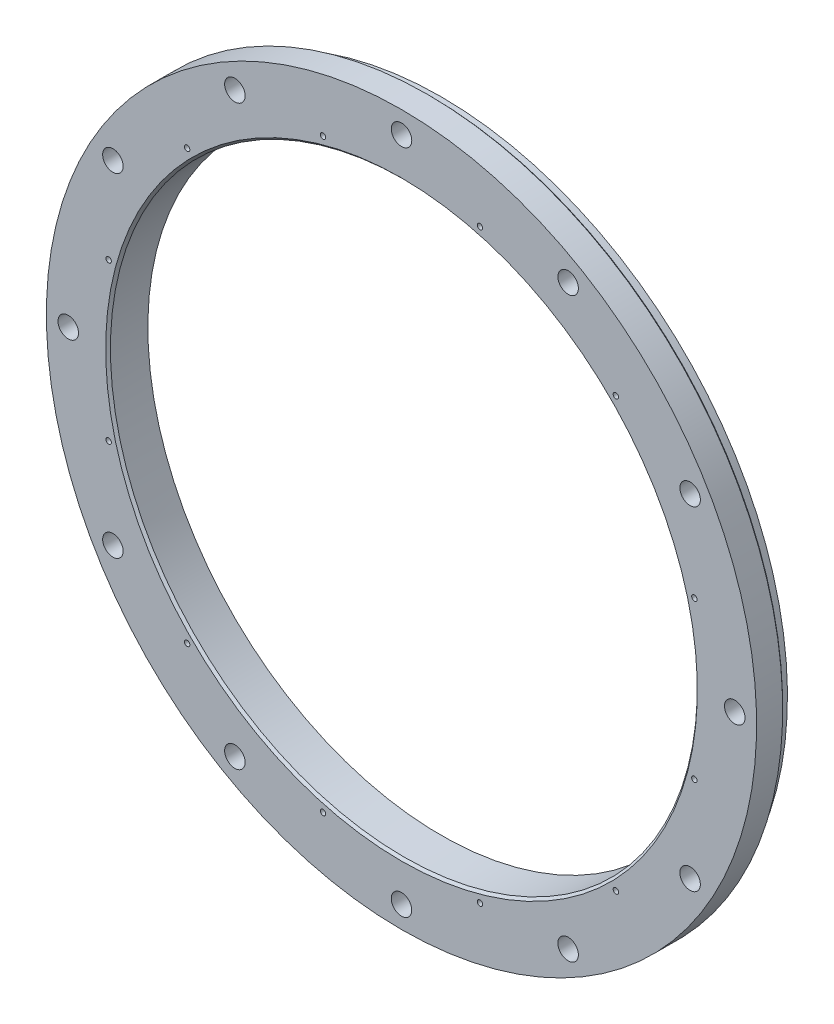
ISO-10303-21;
HEADER;
FILE_DESCRIPTION(('STEP AP214'),'2;1');
FILE_NAME('part.step','',(''),(''),'','','');
FILE_SCHEMA(('AUTOMOTIVE_DESIGN { 1 0 10303 214 1 1 1 1 }'));
ENDSEC;
DATA;
#1=APPLICATION_CONTEXT('core data for automotive mechanical design processes');
#2=APPLICATION_PROTOCOL_DEFINITION('international standard','automotive_design',2000,#1);
#3=PRODUCT_CONTEXT('',#1,'mechanical');
#4=PRODUCT('Part','Part','',(#3));
#5=PRODUCT_RELATED_PRODUCT_CATEGORY('part','',(#4));
#6=PRODUCT_DEFINITION_FORMATION('','',#4);
#7=PRODUCT_DEFINITION_CONTEXT('part definition',#1,'design');
#8=PRODUCT_DEFINITION('design','',#6,#7);
#9=PRODUCT_DEFINITION_SHAPE('','',#8);
#10=(LENGTH_UNIT() NAMED_UNIT(*) SI_UNIT(.MILLI.,.METRE.));
#11=(NAMED_UNIT(*) PLANE_ANGLE_UNIT() SI_UNIT($,.RADIAN.));
#12=(NAMED_UNIT(*) SI_UNIT($,.STERADIAN.) SOLID_ANGLE_UNIT());
#13=UNCERTAINTY_MEASURE_WITH_UNIT(LENGTH_MEASURE(1.E-05),#10,'distance_accuracy_value','');
#14=(GEOMETRIC_REPRESENTATION_CONTEXT(3) GLOBAL_UNCERTAINTY_ASSIGNED_CONTEXT((#13)) GLOBAL_UNIT_ASSIGNED_CONTEXT((#10,
#11,#12)) REPRESENTATION_CONTEXT('',''));
#15=CARTESIAN_POINT('',(0.,0.,0.));
#16=DIRECTION('',(0.,0.,1.));
#17=DIRECTION('',(1.,0.,0.));
#18=AXIS2_PLACEMENT_3D('',#15,#16,#17);
#19=CARTESIAN_POINT('',(184.220764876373,-106.361297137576,-7.04297731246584E-13));
#20=DIRECTION('',(0.,0.,1.));
#21=DIRECTION('',(1.,0.,0.));
#22=AXIS2_PLACEMENT_3D('',#19,#20,#21);
#23=CYLINDRICAL_SURFACE('',#22,4.35609999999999);
#24=CARTESIAN_POINT('',(184.220764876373,-106.361297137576,-7.04297731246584E-13));
#25=DIRECTION('',(0.,0.,1.));
#26=DIRECTION('',(0.866025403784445,-0.499999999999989,0.));
#27=AXIS2_PLACEMENT_3D('',#24,#25,#26);
#28=CIRCLE('',#27,4.35609999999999);
#29=CARTESIAN_POINT('',(187.993258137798,-108.539347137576,-7.08457392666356E-13));
#30=VERTEX_POINT('',#29);
#31=EDGE_CURVE('E592',#30,#30,#28,.T.);
#32=ORIENTED_EDGE('',*,*,#31,.F.);
#33=EDGE_LOOP('',(#32));
#34=FACE_BOUND('',#33,.T.);
#35=CARTESIAN_POINT('',(184.220764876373,-106.361297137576,11.4299999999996));
#36=DIRECTION('',(0.,0.,1.));
#37=DIRECTION('',(1.,0.,0.));
#38=AXIS2_PLACEMENT_3D('',#35,#36,#37);
#39=CIRCLE('',#38,4.35609999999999);
#40=CARTESIAN_POINT('',(188.576864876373,-106.361297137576,11.4299999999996));
#41=VERTEX_POINT('',#40);
#42=EDGE_CURVE('E514',#41,#41,#39,.F.);
#43=ORIENTED_EDGE('',*,*,#42,.F.);
#44=EDGE_LOOP('',(#43));
#45=FACE_BOUND('',#44,.T.);
#46=ADVANCED_FACE('F383',(#34,#45),#23,.F.);
#47=CARTESIAN_POINT('',(106.354724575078,-184.22076487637,-1.16920362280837E-12));
#48=DIRECTION('',(0.,0.,1.));
#49=DIRECTION('',(1.,0.,0.));
#50=AXIS2_PLACEMENT_3D('',#47,#48,#49);
#51=CYLINDRICAL_SURFACE('',#50,4.35609999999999);
#52=CARTESIAN_POINT('',(106.354724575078,-184.22076487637,-1.16920362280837E-12));
#53=DIRECTION('',(0.,0.,1.));
#54=DIRECTION('',(0.50000000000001,-0.866025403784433,0.));
#55=AXIS2_PLACEMENT_3D('',#52,#53,#54);
#56=CIRCLE('',#55,4.35609999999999);
#57=CARTESIAN_POINT('',(108.532774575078,-187.993258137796,-1.17640401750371E-12));
#58=VERTEX_POINT('',#57);
#59=EDGE_CURVE('E595',#58,#58,#56,.T.);
#60=ORIENTED_EDGE('',*,*,#59,.F.);
#61=EDGE_LOOP('',(#60));
#62=FACE_BOUND('',#61,.T.);
#63=CARTESIAN_POINT('',(106.354724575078,-184.22076487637,11.4299999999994));
#64=DIRECTION('',(0.,0.,1.));
#65=DIRECTION('',(1.,0.,0.));
#66=AXIS2_PLACEMENT_3D('',#63,#64,#65);
#67=CIRCLE('',#66,4.35609999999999);
#68=CARTESIAN_POINT('',(110.710824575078,-184.22076487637,11.4299999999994));
#69=VERTEX_POINT('',#68);
#70=EDGE_CURVE('E521',#69,#69,#67,.F.);
#71=ORIENTED_EDGE('',*,*,#70,.F.);
#72=EDGE_LOOP('',(#71));
#73=FACE_BOUND('',#72,.T.);
#74=ADVANCED_FACE('F694',(#62,#73),#51,.F.);
#75=CARTESIAN_POINT('',(-0.00897828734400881,-212.716021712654,-1.49880108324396E-12));
#76=DIRECTION('',(0.,0.,1.));
#77=DIRECTION('',(1.,0.,0.));
#78=AXIS2_PLACEMENT_3D('',#75,#76,#77);
#79=CYLINDRICAL_SURFACE('',#78,4.35609999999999);
#80=CARTESIAN_POINT('',(-0.00897828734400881,-212.716021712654,-1.49880108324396E-12));
#81=DIRECTION('',(0.,0.,1.));
#82=DIRECTION('',(0.,-1.,0.));
#83=AXIS2_PLACEMENT_3D('',#80,#81,#82);
#84=CIRCLE('',#83,4.35609999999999);
#85=CARTESIAN_POINT('',(-0.00897828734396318,-217.072121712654,-1.50710852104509E-12));
#86=VERTEX_POINT('',#85);
#87=EDGE_CURVE('E598',#86,#86,#84,.T.);
#88=ORIENTED_EDGE('',*,*,#87,.F.);
#89=EDGE_LOOP('',(#88));
#90=FACE_BOUND('',#89,.T.);
#91=CARTESIAN_POINT('',(-0.00897828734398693,-212.716021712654,11.4299999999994));
#92=DIRECTION('',(0.,0.,1.));
#93=DIRECTION('',(1.,0.,0.));
#94=AXIS2_PLACEMENT_3D('',#91,#92,#93);
#95=CIRCLE('',#94,4.35609999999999);
#96=CARTESIAN_POINT('',(4.34712171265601,-212.716021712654,11.4299999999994));
#97=VERTEX_POINT('',#96);
#98=EDGE_CURVE('E528',#97,#97,#95,.F.);
#99=ORIENTED_EDGE('',*,*,#98,.F.);
#100=EDGE_LOOP('',(#99));
#101=FACE_BOUND('',#100,.T.);
#102=ADVANCED_FACE('F701',(#90,#101),#79,.F.);
#103=CARTESIAN_POINT('',(-106.370275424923,-184.211786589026,-1.60288449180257E-12));
#104=DIRECTION('',(0.,0.,1.));
#105=DIRECTION('',(0.,-1.,0.));
#106=AXIS2_PLACEMENT_3D('',#103,#104,#105);
#107=CYLINDRICAL_SURFACE('',#106,4.35609999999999);
#108=CARTESIAN_POINT('',(-106.370275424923,-184.211786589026,-1.60288449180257E-12));
#109=DIRECTION('',(0.,0.,1.));
#110=DIRECTION('',(-0.499999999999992,-0.866025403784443,0.));
#111=AXIS2_PLACEMENT_3D('',#108,#109,#110);
#112=CIRCLE('',#111,4.35609999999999);
#113=CARTESIAN_POINT('',(-108.548325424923,-187.984279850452,-1.61006865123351E-12));
#114=VERTEX_POINT('',#113);
#115=EDGE_CURVE('E601',#114,#114,#112,.T.);
#116=ORIENTED_EDGE('',*,*,#115,.F.);
#117=EDGE_LOOP('',(#116));
#118=FACE_BOUND('',#117,.T.);
#119=CARTESIAN_POINT('',(-106.370275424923,-184.211786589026,11.4299999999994));
#120=DIRECTION('',(0.,0.,1.));
#121=DIRECTION('',(0.,-1.,0.));
#122=AXIS2_PLACEMENT_3D('',#119,#120,#121);
#123=CIRCLE('',#122,4.35609999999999);
#124=CARTESIAN_POINT('',(-106.370275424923,-188.567886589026,11.4299999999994));
#125=VERTEX_POINT('',#124);
#126=EDGE_CURVE('E535',#125,#125,#123,.F.);
#127=ORIENTED_EDGE('',*,*,#126,.F.);
#128=EDGE_LOOP('',(#127));
#129=FACE_BOUND('',#128,.T.);
#130=ADVANCED_FACE('F712',(#118,#129),#107,.F.);
#131=CARTESIAN_POINT('',(-184.229743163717,-106.345746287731,-1.45369827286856E-12));
#132=DIRECTION('',(0.,0.,1.));
#133=DIRECTION('',(0.,-1.,0.));
#134=AXIS2_PLACEMENT_3D('',#131,#132,#133);
#135=CYLINDRICAL_SURFACE('',#134,4.35609999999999);
#136=CARTESIAN_POINT('',(-184.229743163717,-106.345746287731,-1.45369827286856E-12));
#137=DIRECTION('',(0.,0.,1.));
#138=DIRECTION('',(-0.866025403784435,-0.500000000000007,0.));
#139=AXIS2_PLACEMENT_3D('',#136,#137,#138);
#140=CIRCLE('',#139,4.35609999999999);
#141=CARTESIAN_POINT('',(-188.002236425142,-108.523796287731,-1.45782981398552E-12));
#142=VERTEX_POINT('',#141);
#143=EDGE_CURVE('E604',#142,#142,#140,.T.);
#144=ORIENTED_EDGE('',*,*,#143,.F.);
#145=EDGE_LOOP('',(#144));
#146=FACE_BOUND('',#145,.T.);
#147=CARTESIAN_POINT('',(-184.229743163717,-106.345746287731,11.4299999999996));
#148=DIRECTION('',(0.,0.,1.));
#149=DIRECTION('',(0.,-1.,0.));
#150=AXIS2_PLACEMENT_3D('',#147,#148,#149);
#151=CIRCLE('',#150,4.35609999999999);
#152=CARTESIAN_POINT('',(-184.229743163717,-110.701846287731,11.4299999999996));
#153=VERTEX_POINT('',#152);
#154=EDGE_CURVE('E542',#153,#153,#151,.F.);
#155=ORIENTED_EDGE('',*,*,#154,.F.);
#156=EDGE_LOOP('',(#155));
#157=FACE_BOUND('',#156,.T.);
#158=ADVANCED_FACE('F716',(#146,#157),#135,.F.);
#159=CARTESIAN_POINT('',(-212.725,0.0179565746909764,-1.09287578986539E-12));
#160=DIRECTION('',(0.,0.,1.));
#161=DIRECTION('',(0.,-1.,0.));
#162=AXIS2_PLACEMENT_3D('',#159,#160,#161);
#163=CYLINDRICAL_SURFACE('',#162,4.35609999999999);
#164=CARTESIAN_POINT('',(-212.725,0.0179565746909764,-1.09287578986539E-12));
#165=DIRECTION('',(0.,0.,1.));
#166=DIRECTION('',(-1.,0.,0.));
#167=AXIS2_PLACEMENT_3D('',#164,#165,#166);
#168=CIRCLE('',#167,4.35609999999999);
#169=CARTESIAN_POINT('',(-217.0811,0.017956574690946,-1.09284331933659E-12));
#170=VERTEX_POINT('',#169);
#171=EDGE_CURVE('E607',#170,#170,#168,.T.);
#172=ORIENTED_EDGE('',*,*,#171,.F.);
#173=EDGE_LOOP('',(#172));
#174=FACE_BOUND('',#173,.T.);
#175=CARTESIAN_POINT('',(-212.725,0.0179565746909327,11.4299999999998));
#176=DIRECTION('',(0.,0.,1.));
#177=DIRECTION('',(0.,-1.,0.));
#178=AXIS2_PLACEMENT_3D('',#175,#176,#177);
#179=CIRCLE('',#178,4.35609999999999);
#180=CARTESIAN_POINT('',(-212.725,-4.33814342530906,11.4299999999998));
#181=VERTEX_POINT('',#180);
#182=EDGE_CURVE('E549',#181,#181,#179,.F.);
#183=ORIENTED_EDGE('',*,*,#182,.F.);
#184=EDGE_LOOP('',(#183));
#185=FACE_BOUND('',#184,.T.);
#186=ADVANCED_FACE('F720',(#174,#185),#163,.F.);
#187=CARTESIAN_POINT('',(-184.220764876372,106.379253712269,-1.04430353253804E-12));
#188=DIRECTION('',(0.,0.,1.));
#189=DIRECTION('',(0.,-1.,0.));
#190=AXIS2_PLACEMENT_3D('',#187,#188,#189);
#191=CYLINDRICAL_SURFACE('',#190,4.35609999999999);
#192=CARTESIAN_POINT('',(-184.220764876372,106.379253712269,-1.04430353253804E-12));
#193=DIRECTION('',(0.,0.,1.));
#194=DIRECTION('',(-0.866025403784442,0.499999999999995,0.));
#195=AXIS2_PLACEMENT_3D('',#192,#193,#194);
#196=CIRCLE('',#195,4.35609999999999);
#197=CARTESIAN_POINT('',(-187.993258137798,108.557303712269,-1.04011140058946E-12));
#198=VERTEX_POINT('',#197);
#199=EDGE_CURVE('E610',#198,#198,#196,.T.);
#200=ORIENTED_EDGE('',*,*,#199,.F.);
#201=EDGE_LOOP('',(#200));
#202=FACE_BOUND('',#201,.T.);
#203=CARTESIAN_POINT('',(-184.220764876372,106.379253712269,11.43));
#204=DIRECTION('',(0.,0.,1.));
#205=DIRECTION('',(0.,-1.,0.));
#206=AXIS2_PLACEMENT_3D('',#203,#204,#205);
#207=CIRCLE('',#206,4.35609999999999);
#208=CARTESIAN_POINT('',(-184.220764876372,102.023153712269,11.43));
#209=VERTEX_POINT('',#208);
#210=EDGE_CURVE('E556',#209,#209,#207,.F.);
#211=ORIENTED_EDGE('',*,*,#210,.F.);
#212=EDGE_LOOP('',(#211));
#213=FACE_BOUND('',#212,.T.);
#214=ADVANCED_FACE('F724',(#202,#213),#191,.F.);
#215=CARTESIAN_POINT('',(-106.354724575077,184.238721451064,-8.95117313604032E-13));
#216=DIRECTION('',(0.,0.,1.));
#217=DIRECTION('',(0.,-1.,0.));
#218=AXIS2_PLACEMENT_3D('',#215,#216,#217);
#219=CYLINDRICAL_SURFACE('',#218,4.35609999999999);
#220=CARTESIAN_POINT('',(-106.354724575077,184.238721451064,-8.95117313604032E-13));
#221=DIRECTION('',(0.,0.,1.));
#222=DIRECTION('',(-0.500000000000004,0.866025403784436,0.));
#223=AXIS2_PLACEMENT_3D('',#220,#221,#222);
#224=CIRCLE('',#223,4.35609999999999);
#225=CARTESIAN_POINT('',(-108.532774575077,188.011214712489,-8.87884448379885E-13));
#226=VERTEX_POINT('',#225);
#227=EDGE_CURVE('E613',#226,#226,#224,.T.);
#228=ORIENTED_EDGE('',*,*,#227,.F.);
#229=EDGE_LOOP('',(#228));
#230=FACE_BOUND('',#229,.T.);
#231=CARTESIAN_POINT('',(-106.354724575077,184.238721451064,11.4300000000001));
#232=DIRECTION('',(0.,0.,1.));
#233=DIRECTION('',(0.,-1.,0.));
#234=AXIS2_PLACEMENT_3D('',#231,#232,#233);
#235=CIRCLE('',#234,4.35609999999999);
#236=CARTESIAN_POINT('',(-106.354724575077,179.882621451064,11.4300000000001));
#237=VERTEX_POINT('',#236);
#238=EDGE_CURVE('E563',#237,#237,#235,.F.);
#239=ORIENTED_EDGE('',*,*,#238,.F.);
#240=EDGE_LOOP('',(#239));
#241=FACE_BOUND('',#240,.T.);
#242=ADVANCED_FACE('F728',(#230,#241),#219,.F.);
#243=CARTESIAN_POINT('',(0.00897828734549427,212.733978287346,-6.83481049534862E-13));
#244=DIRECTION('',(0.,0.,1.));
#245=DIRECTION('',(0.,-1.,0.));
#246=AXIS2_PLACEMENT_3D('',#243,#244,#245);
#247=CYLINDRICAL_SURFACE('',#246,4.35609999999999);
#248=CARTESIAN_POINT('',(0.00897828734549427,212.733978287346,-6.83481049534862E-13));
#249=DIRECTION('',(0.,0.,1.));
#250=DIRECTION('',(0.,1.,0.));
#251=AXIS2_PLACEMENT_3D('',#248,#249,#250);
#252=CIRCLE('',#251,4.35609999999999);
#253=CARTESIAN_POINT('',(0.00897828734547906,217.090078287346,-6.75141141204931E-13));
#254=VERTEX_POINT('',#253);
#255=EDGE_CURVE('E616',#254,#254,#252,.T.);
#256=ORIENTED_EDGE('',*,*,#255,.F.);
#257=EDGE_LOOP('',(#256));
#258=FACE_BOUND('',#257,.T.);
#259=CARTESIAN_POINT('',(0.00897828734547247,212.733978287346,11.4300000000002));
#260=DIRECTION('',(0.,0.,1.));
#261=DIRECTION('',(0.,-1.,0.));
#262=AXIS2_PLACEMENT_3D('',#259,#260,#261);
#263=CIRCLE('',#262,4.35609999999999);
#264=CARTESIAN_POINT('',(0.00897828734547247,208.377878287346,11.4300000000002));
#265=VERTEX_POINT('',#264);
#266=EDGE_CURVE('E570',#265,#265,#263,.F.);
#267=ORIENTED_EDGE('',*,*,#266,.F.);
#268=EDGE_LOOP('',(#267));
#269=FACE_BOUND('',#268,.T.);
#270=ADVANCED_FACE('F732',(#258,#269),#247,.F.);
#271=CARTESIAN_POINT('',(106.370275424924,184.229743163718,-4.64905891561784E-13));
#272=DIRECTION('',(0.,0.,1.));
#273=DIRECTION('',(1.,0.,0.));
#274=AXIS2_PLACEMENT_3D('',#271,#272,#273);
#275=CYLINDRICAL_SURFACE('',#274,4.35609999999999);
#276=CARTESIAN_POINT('',(106.370275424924,184.229743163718,-4.64905891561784E-13));
#277=DIRECTION('',(0.,0.,1.));
#278=DIRECTION('',(0.499999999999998,0.86602540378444,0.));
#279=AXIS2_PLACEMENT_3D('',#276,#277,#278);
#280=CIRCLE('',#279,4.35609999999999);
#281=CARTESIAN_POINT('',(108.548325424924,188.002236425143,-4.57689261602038E-13));
#282=VERTEX_POINT('',#281);
#283=EDGE_CURVE('E619',#282,#282,#280,.T.);
#284=ORIENTED_EDGE('',*,*,#283,.F.);
#285=EDGE_LOOP('',(#284));
#286=FACE_BOUND('',#285,.T.);
#287=CARTESIAN_POINT('',(106.370275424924,184.229743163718,11.4300000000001));
#288=DIRECTION('',(0.,0.,1.));
#289=DIRECTION('',(1.,0.,0.));
#290=AXIS2_PLACEMENT_3D('',#287,#288,#289);
#291=CIRCLE('',#290,4.35609999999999);
#292=CARTESIAN_POINT('',(110.726375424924,184.229743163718,11.4300000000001));
#293=VERTEX_POINT('',#292);
#294=EDGE_CURVE('E577',#293,#293,#291,.F.);
#295=ORIENTED_EDGE('',*,*,#294,.F.);
#296=EDGE_LOOP('',(#295));
#297=FACE_BOUND('',#296,.T.);
#298=ADVANCED_FACE('F736',(#286,#297),#275,.F.);
#299=CARTESIAN_POINT('',(184.229743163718,106.363702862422,-2.94902990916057E-13));
#300=DIRECTION('',(0.,0.,1.));
#301=DIRECTION('',(1.,0.,0.));
#302=AXIS2_PLACEMENT_3D('',#299,#300,#301);
#303=CYLINDRICAL_SURFACE('',#302,4.35609999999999);
#304=CARTESIAN_POINT('',(184.229743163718,106.363702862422,-2.94902990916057E-13));
#305=DIRECTION('',(0.,0.,1.));
#306=DIRECTION('',(0.866025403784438,0.500000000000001,0.));
#307=AXIS2_PLACEMENT_3D('',#304,#305,#306);
#308=CIRCLE('',#307,4.35609999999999);
#309=CARTESIAN_POINT('',(188.002236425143,108.541752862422,-2.90738979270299E-13));
#310=VERTEX_POINT('',#309);
#311=EDGE_CURVE('E622',#310,#310,#308,.T.);
#312=ORIENTED_EDGE('',*,*,#311,.F.);
#313=EDGE_LOOP('',(#312));
#314=FACE_BOUND('',#313,.T.);
#315=CARTESIAN_POINT('',(184.229743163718,106.363702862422,11.43));
#316=DIRECTION('',(0.,0.,1.));
#317=DIRECTION('',(1.,0.,0.));
#318=AXIS2_PLACEMENT_3D('',#315,#316,#317);
#319=CIRCLE('',#318,4.35609999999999);
#320=CARTESIAN_POINT('',(188.585843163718,106.363702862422,11.43));
#321=VERTEX_POINT('',#320);
#322=EDGE_CURVE('E584',#321,#321,#319,.F.);
#323=ORIENTED_EDGE('',*,*,#322,.F.);
#324=EDGE_LOOP('',(#323));
#325=FACE_BOUND('',#324,.T.);
#326=ADVANCED_FACE('F740',(#314,#325),#303,.F.);
#327=CARTESIAN_POINT('',(212.725,0.,-2.25514051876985E-13));
#328=DIRECTION('',(0.,0.,1.));
#329=DIRECTION('',(1.,0.,0.));
#330=AXIS2_PLACEMENT_3D('',#327,#328,#329);
#331=CYLINDRICAL_SURFACE('',#330,4.35609999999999);
#332=CARTESIAN_POINT('',(212.725,0.,-2.25514051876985E-13));
#333=DIRECTION('',(0.,0.,1.));
#334=DIRECTION('',(1.,0.,0.));
#335=AXIS2_PLACEMENT_3D('',#332,#333,#334);
#336=CIRCLE('',#335,4.35609999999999);
#337=CARTESIAN_POINT('',(217.0811,0.,-2.25514051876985E-13));
#338=VERTEX_POINT('',#337);
#339=EDGE_CURVE('E625',#338,#338,#336,.T.);
#340=ORIENTED_EDGE('',*,*,#339,.F.);
#341=EDGE_LOOP('',(#340));
#342=FACE_BOUND('',#341,.T.);
#343=CARTESIAN_POINT('',(212.725,0.,11.4299999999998));
#344=DIRECTION('',(0.,0.,1.));
#345=DIRECTION('',(1.,0.,0.));
#346=AXIS2_PLACEMENT_3D('',#343,#344,#345);
#347=CIRCLE('',#346,4.35609999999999);
#348=CARTESIAN_POINT('',(217.0811,0.,11.4299999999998));
#349=VERTEX_POINT('',#348);
#350=EDGE_CURVE('E591',#349,#349,#347,.F.);
#351=ORIENTED_EDGE('',*,*,#350,.F.);
#352=EDGE_LOOP('',(#351));
#353=FACE_BOUND('',#352,.T.);
#354=ADVANCED_FACE('F744',(#342,#353),#331,.F.);
#355=CARTESIAN_POINT('',(226.695,0.00897828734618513,7.61999999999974));
#356=DIRECTION('',(0.,0.,-1.));
#357=DIRECTION('',(0.,1.,0.));
#358=AXIS2_PLACEMENT_3D('',#355,#356,#357);
#359=PLANE('',#358);
#360=CARTESIAN_POINT('',(0.,0.00897828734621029,7.61999999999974));
#361=DIRECTION('',(0.,0.,-1.));
#362=DIRECTION('',(0.,1.,0.));
#363=AXIS2_PLACEMENT_3D('',#360,#361,#362);
#364=CIRCLE('',#363,225.552);
#365=CARTESIAN_POINT('',(0.,225.560978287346,7.62000000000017));
#366=VERTEX_POINT('',#365);
#367=EDGE_CURVE('E391',#366,#366,#364,.T.);
#368=ORIENTED_EDGE('',*,*,#367,.T.);
#369=EDGE_LOOP('',(#368));
#370=FACE_BOUND('',#369,.T.);
#371=CARTESIAN_POINT('',(0.,0.00897828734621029,7.61999999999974));
#372=DIRECTION('',(0.,0.,-1.));
#373=DIRECTION('',(0.,1.,0.));
#374=AXIS2_PLACEMENT_3D('',#371,#372,#373);
#375=CIRCLE('',#374,220.98);
#376=CARTESIAN_POINT('',(0.,220.988978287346,7.62000000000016));
#377=VERTEX_POINT('',#376);
#378=EDGE_CURVE('E637',#377,#377,#375,.T.);
#379=ORIENTED_EDGE('',*,*,#378,.F.);
#380=EDGE_LOOP('',(#379));
#381=FACE_BOUND('',#380,.T.);
#382=ADVANCED_FACE('F385',(#370,#381),#359,.T.);
#383=CARTESIAN_POINT('',(0.,0.00897828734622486,0.));
#384=DIRECTION('',(0.,0.,-1.));
#385=DIRECTION('',(0.,1.,0.));
#386=AXIS2_PLACEMENT_3D('',#383,#384,#385);
#387=CYLINDRICAL_SURFACE('',#386,220.98);
#388=ORIENTED_EDGE('',*,*,#378,.T.);
#389=EDGE_LOOP('',(#388));
#390=FACE_BOUND('',#389,.T.);
#391=CARTESIAN_POINT('',(0.,0.00897828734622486,-2.19026502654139E-13));
#392=DIRECTION('',(0.,0.,-1.));
#393=DIRECTION('',(0.,1.,0.));
#394=AXIS2_PLACEMENT_3D('',#391,#392,#393);
#395=CIRCLE('',#394,220.98);
#396=CARTESIAN_POINT('',(0.,220.988978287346,2.03223967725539E-13));
#397=VERTEX_POINT('',#396);
#398=EDGE_CURVE('E634',#397,#397,#395,.T.);
#399=ORIENTED_EDGE('',*,*,#398,.F.);
#400=EDGE_LOOP('',(#399));
#401=FACE_BOUND('',#400,.T.);
#402=ADVANCED_FACE('F763',(#390,#401),#387,.T.);
#403=CARTESIAN_POINT('',(220.98,0.00897828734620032,-2.22945553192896E-13));
#404=DIRECTION('',(0.,0.,-1.));
#405=DIRECTION('',(0.,1.,0.));
#406=AXIS2_PLACEMENT_3D('',#403,#404,#405);
#407=PLANE('',#406);
#408=ORIENTED_EDGE('',*,*,#31,.T.);
#409=EDGE_LOOP('',(#408));
#410=FACE_BOUND('',#409,.T.);
#411=ORIENTED_EDGE('',*,*,#59,.T.);
#412=EDGE_LOOP('',(#411));
#413=FACE_BOUND('',#412,.T.);
#414=ORIENTED_EDGE('',*,*,#87,.T.);
#415=EDGE_LOOP('',(#414));
#416=FACE_BOUND('',#415,.T.);
#417=ORIENTED_EDGE('',*,*,#115,.T.);
#418=EDGE_LOOP('',(#417));
#419=FACE_BOUND('',#418,.T.);
#420=ORIENTED_EDGE('',*,*,#143,.T.);
#421=EDGE_LOOP('',(#420));
#422=FACE_BOUND('',#421,.T.);
#423=ORIENTED_EDGE('',*,*,#171,.T.);
#424=EDGE_LOOP('',(#423));
#425=FACE_BOUND('',#424,.T.);
#426=ORIENTED_EDGE('',*,*,#199,.T.);
#427=EDGE_LOOP('',(#426));
#428=FACE_BOUND('',#427,.T.);
#429=ORIENTED_EDGE('',*,*,#227,.T.);
#430=EDGE_LOOP('',(#429));
#431=FACE_BOUND('',#430,.T.);
#432=ORIENTED_EDGE('',*,*,#255,.T.);
#433=EDGE_LOOP('',(#432));
#434=FACE_BOUND('',#433,.T.);
#435=ORIENTED_EDGE('',*,*,#283,.T.);
#436=EDGE_LOOP('',(#435));
#437=FACE_BOUND('',#436,.T.);
#438=ORIENTED_EDGE('',*,*,#311,.T.);
#439=EDGE_LOOP('',(#438));
#440=FACE_BOUND('',#439,.T.);
#441=ORIENTED_EDGE('',*,*,#339,.T.);
#442=EDGE_LOOP('',(#441));
#443=FACE_BOUND('',#442,.T.);
#444=ORIENTED_EDGE('',*,*,#398,.T.);
#445=EDGE_LOOP('',(#444));
#446=FACE_BOUND('',#445,.T.);
#447=CARTESIAN_POINT('',(0.,0.00897828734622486,-2.25217410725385E-13));
#448=DIRECTION('',(0.,0.,-1.));
#449=DIRECTION('',(0.,1.,0.));
#450=AXIS2_PLACEMENT_3D('',#447,#448,#449);
#451=CIRCLE('',#450,187.325);
#452=CARTESIAN_POINT('',(0.,187.333978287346,1.32724798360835E-13));
#453=VERTEX_POINT('',#452);
#454=EDGE_CURVE('E631',#453,#453,#451,.T.);
#455=ORIENTED_EDGE('',*,*,#454,.F.);
#456=EDGE_LOOP('',(#455));
#457=FACE_BOUND('',#456,.T.);
#458=ADVANCED_FACE('F760',(#410,#413,#416,#419,#422,#425,#428,#431,#434,#437,#440,#443,#446,
#457),#407,.T.);
#459=CARTESIAN_POINT('',(0.,0.00897828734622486,0.));
#460=DIRECTION('',(0.,0.,-1.));
#461=DIRECTION('',(0.,1.,0.));
#462=AXIS2_PLACEMENT_3D('',#459,#460,#461);
#463=CYLINDRICAL_SURFACE('',#462,187.325);
#464=CARTESIAN_POINT('',(0.,0.00897828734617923,23.8759999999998));
#465=DIRECTION('',(0.,0.,1.));
#466=DIRECTION('',(0.,-1.,0.));
#467=AXIS2_PLACEMENT_3D('',#464,#465,#466);
#468=CIRCLE('',#467,187.325);
#469=CARTESIAN_POINT('',(0.,-187.316021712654,23.8759999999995));
#470=VERTEX_POINT('',#469);
#471=EDGE_CURVE('E667',#470,#470,#468,.T.);
#472=ORIENTED_EDGE('',*,*,#471,.T.);
#473=EDGE_LOOP('',(#472));
#474=FACE_BOUND('',#473,.T.);
#475=ORIENTED_EDGE('',*,*,#454,.T.);
#476=EDGE_LOOP('',(#475));
#477=FACE_BOUND('',#476,.T.);
#478=ADVANCED_FACE('F756',(#474,#477),#463,.F.);
#479=CARTESIAN_POINT('',(187.325,0.00897828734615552,25.3999999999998));
#480=DIRECTION('',(0.,0.,1.));
#481=DIRECTION('',(0.,-1.,0.));
#482=AXIS2_PLACEMENT_3D('',#479,#480,#481);
#483=PLANE('',#482);
#484=CARTESIAN_POINT('',(136.854614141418,136.860306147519,25.3999999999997));
#485=DIRECTION('',(0.,0.,1.));
#486=DIRECTION('',(0.,-1.,0.));
#487=AXIS2_PLACEMENT_3D('',#484,#485,#486);
#488=CIRCLE('',#487,1.72719999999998);
#489=CARTESIAN_POINT('',(136.854614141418,135.133106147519,25.3999999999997));
#490=VERTEX_POINT('',#489);
#491=EDGE_CURVE('E437',#490,#490,#488,.T.);
#492=ORIENTED_EDGE('',*,*,#491,.F.);
#493=EDGE_LOOP('',(#492));
#494=FACE_BOUND('',#493,.T.);
#495=CARTESIAN_POINT('',(186.945236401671,50.0983976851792,25.3999999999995));
#496=DIRECTION('',(0.,0.,1.));
#497=DIRECTION('',(0.,-1.,0.));
#498=AXIS2_PLACEMENT_3D('',#495,#496,#497);
#499=CIRCLE('',#498,1.72719999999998);
#500=CARTESIAN_POINT('',(186.945236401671,48.3711976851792,25.3999999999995));
#501=VERTEX_POINT('',#500);
#502=EDGE_CURVE('E445',#501,#501,#499,.T.);
#503=ORIENTED_EDGE('',*,*,#502,.F.);
#504=EDGE_LOOP('',(#503));
#505=FACE_BOUND('',#504,.T.);
#506=CARTESIAN_POINT('',(186.944033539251,-50.0849302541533,25.3999999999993));
#507=DIRECTION('',(0.,0.,1.));
#508=DIRECTION('',(0.,-1.,0.));
#509=AXIS2_PLACEMENT_3D('',#506,#507,#508);
#510=CIRCLE('',#509,1.72719999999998);
#511=CARTESIAN_POINT('',(186.944033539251,-51.8121302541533,25.3999999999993));
#512=VERTEX_POINT('',#511);
#513=EDGE_CURVE('E451',#512,#512,#510,.T.);
#514=ORIENTED_EDGE('',*,*,#513,.F.);
#515=EDGE_LOOP('',(#514));
#516=FACE_BOUND('',#515,.T.);
#517=CARTESIAN_POINT('',(136.851327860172,-136.845635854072,25.3999999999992));
#518=DIRECTION('',(0.,0.,1.));
#519=DIRECTION('',(0.,-1.,0.));
#520=AXIS2_PLACEMENT_3D('',#517,#518,#519);
#521=CIRCLE('',#520,1.72719999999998);
#522=CARTESIAN_POINT('',(136.851327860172,-138.572835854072,25.3999999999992));
#523=VERTEX_POINT('',#522);
#524=EDGE_CURVE('E457',#523,#523,#521,.T.);
#525=ORIENTED_EDGE('',*,*,#524,.F.);
#526=EDGE_LOOP('',(#525));
#527=FACE_BOUND('',#526,.T.);
#528=CARTESIAN_POINT('',(50.0894193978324,-186.936258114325,25.3999999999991));
#529=DIRECTION('',(0.,0.,1.));
#530=DIRECTION('',(0.,-1.,0.));
#531=AXIS2_PLACEMENT_3D('',#528,#529,#530);
#532=CIRCLE('',#531,1.72719999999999);
#533=CARTESIAN_POINT('',(50.0894193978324,-188.663458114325,25.3999999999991));
#534=VERTEX_POINT('',#533);
#535=EDGE_CURVE('E463',#534,#534,#532,.T.);
#536=ORIENTED_EDGE('',*,*,#535,.F.);
#537=EDGE_LOOP('',(#536));
#538=FACE_BOUND('',#537,.T.);
#539=CARTESIAN_POINT('',(-50.0939085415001,-186.935055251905,25.3999999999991));
#540=DIRECTION('',(0.,0.,1.));
#541=DIRECTION('',(0.,-1.,0.));
#542=AXIS2_PLACEMENT_3D('',#539,#540,#541);
#543=CIRCLE('',#542,1.72719999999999);
#544=CARTESIAN_POINT('',(-50.0939085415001,-188.662255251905,25.3999999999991));
#545=VERTEX_POINT('',#544);
#546=EDGE_CURVE('E469',#545,#545,#543,.T.);
#547=ORIENTED_EDGE('',*,*,#546,.F.);
#548=EDGE_LOOP('',(#547));
#549=FACE_BOUND('',#548,.T.);
#550=CARTESIAN_POINT('',(-136.854614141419,-136.842349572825,25.3999999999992));
#551=DIRECTION('',(0.,0.,1.));
#552=DIRECTION('',(0.,-1.,0.));
#553=AXIS2_PLACEMENT_3D('',#550,#551,#552);
#554=CIRCLE('',#553,1.72719999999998);
#555=CARTESIAN_POINT('',(-136.854614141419,-138.569549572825,25.3999999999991));
#556=VERTEX_POINT('',#555);
#557=EDGE_CURVE('E475',#556,#556,#554,.T.);
#558=ORIENTED_EDGE('',*,*,#557,.F.);
#559=EDGE_LOOP('',(#558));
#560=FACE_BOUND('',#559,.T.);
#561=CARTESIAN_POINT('',(-186.945236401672,-50.0804411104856,25.3999999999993));
#562=DIRECTION('',(0.,0.,1.));
#563=DIRECTION('',(0.,-1.,0.));
#564=AXIS2_PLACEMENT_3D('',#561,#562,#563);
#565=CIRCLE('',#564,1.72719999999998);
#566=CARTESIAN_POINT('',(-186.945236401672,-51.8076411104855,25.3999999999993));
#567=VERTEX_POINT('',#566);
#568=EDGE_CURVE('E481',#567,#567,#565,.T.);
#569=ORIENTED_EDGE('',*,*,#568,.F.);
#570=EDGE_LOOP('',(#569));
#571=FACE_BOUND('',#570,.T.);
#572=CARTESIAN_POINT('',(-186.944033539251,50.102886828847,25.3999999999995));
#573=DIRECTION('',(0.,0.,1.));
#574=DIRECTION('',(0.,-1.,0.));
#575=AXIS2_PLACEMENT_3D('',#572,#573,#574);
#576=CIRCLE('',#575,1.72719999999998);
#577=CARTESIAN_POINT('',(-186.944033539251,48.375686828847,25.3999999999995));
#578=VERTEX_POINT('',#577);
#579=EDGE_CURVE('E487',#578,#578,#576,.T.);
#580=ORIENTED_EDGE('',*,*,#579,.F.);
#581=EDGE_LOOP('',(#580));
#582=FACE_BOUND('',#581,.T.);
#583=CARTESIAN_POINT('',(-136.851327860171,136.863592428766,25.3999999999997));
#584=DIRECTION('',(0.,0.,1.));
#585=DIRECTION('',(0.,-1.,0.));
#586=AXIS2_PLACEMENT_3D('',#583,#584,#585);
#587=CIRCLE('',#586,1.72719999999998);
#588=CARTESIAN_POINT('',(-136.851327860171,135.136392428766,25.3999999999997));
#589=VERTEX_POINT('',#588);
#590=EDGE_CURVE('E493',#589,#589,#587,.T.);
#591=ORIENTED_EDGE('',*,*,#590,.F.);
#592=EDGE_LOOP('',(#591));
#593=FACE_BOUND('',#592,.T.);
#594=CARTESIAN_POINT('',(-50.0894193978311,186.954214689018,25.3999999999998));
#595=DIRECTION('',(0.,0.,1.));
#596=DIRECTION('',(0.,-1.,0.));
#597=AXIS2_PLACEMENT_3D('',#594,#595,#596);
#598=CIRCLE('',#597,1.72719999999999);
#599=CARTESIAN_POINT('',(-50.0894193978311,185.227014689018,25.3999999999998));
#600=VERTEX_POINT('',#599);
#601=EDGE_CURVE('E499',#600,#600,#598,.T.);
#602=ORIENTED_EDGE('',*,*,#601,.F.);
#603=EDGE_LOOP('',(#602));
#604=FACE_BOUND('',#603,.T.);
#605=CARTESIAN_POINT('',(50.0939085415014,186.953011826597,25.3999999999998));
#606=DIRECTION('',(0.,0.,1.));
#607=DIRECTION('',(1.,0.,0.));
#608=AXIS2_PLACEMENT_3D('',#605,#606,#607);
#609=CIRCLE('',#608,1.72719999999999);
#610=CARTESIAN_POINT('',(51.8211085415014,186.953011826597,25.3999999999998));
#611=VERTEX_POINT('',#610);
#612=EDGE_CURVE('E505',#611,#611,#609,.T.);
#613=ORIENTED_EDGE('',*,*,#612,.F.);
#614=EDGE_LOOP('',(#613));
#615=FACE_BOUND('',#614,.T.);
#616=CARTESIAN_POINT('',(0.,0.00897828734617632,25.3999999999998));
#617=DIRECTION('',(0.,0.,1.));
#618=DIRECTION('',(0.,-1.,0.));
#619=AXIS2_PLACEMENT_3D('',#616,#617,#618);
#620=CIRCLE('',#619,188.849);
#621=CARTESIAN_POINT('',(0.,-188.840021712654,25.3999999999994));
#622=VERTEX_POINT('',#621);
#623=EDGE_CURVE('E640',#622,#622,#620,.F.);
#624=ORIENTED_EDGE('',*,*,#623,.T.);
#625=EDGE_LOOP('',(#624));
#626=FACE_BOUND('',#625,.T.);
#627=CARTESIAN_POINT('',(184.220764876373,-106.361297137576,25.3999999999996));
#628=DIRECTION('',(0.,0.,1.));
#629=DIRECTION('',(0.866025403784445,-0.499999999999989,0.));
#630=AXIS2_PLACEMENT_3D('',#627,#628,#629);
#631=CIRCLE('',#630,6.54050000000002);
#632=CARTESIAN_POINT('',(190.761264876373,-106.361297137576,25.3999999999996));
#633=VERTEX_POINT('',#632);
#634=EDGE_CURVE('E508',#633,#633,#631,.T.);
#635=ORIENTED_EDGE('',*,*,#634,.F.);
#636=EDGE_LOOP('',(#635));
#637=FACE_BOUND('',#636,.T.);
#638=CARTESIAN_POINT('',(106.354724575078,-184.22076487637,25.3999999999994));
#639=DIRECTION('',(0.,0.,1.));
#640=DIRECTION('',(0.50000000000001,-0.866025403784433,0.));
#641=AXIS2_PLACEMENT_3D('',#638,#639,#640);
#642=CIRCLE('',#641,6.54050000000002);
#643=CARTESIAN_POINT('',(112.895224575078,-184.22076487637,25.3999999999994));
#644=VERTEX_POINT('',#643);
#645=EDGE_CURVE('E515',#644,#644,#642,.T.);
#646=ORIENTED_EDGE('',*,*,#645,.F.);
#647=EDGE_LOOP('',(#646));
#648=FACE_BOUND('',#647,.T.);
#649=CARTESIAN_POINT('',(-0.00897828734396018,-212.716021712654,25.3999999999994));
#650=DIRECTION('',(0.,0.,1.));
#651=DIRECTION('',(0.,-1.,0.));
#652=AXIS2_PLACEMENT_3D('',#649,#650,#651);
#653=CIRCLE('',#652,6.54050000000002);
#654=CARTESIAN_POINT('',(6.53152171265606,-212.716021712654,25.3999999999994));
#655=VERTEX_POINT('',#654);
#656=EDGE_CURVE('E522',#655,#655,#653,.T.);
#657=ORIENTED_EDGE('',*,*,#656,.F.);
#658=EDGE_LOOP('',(#657));
#659=FACE_BOUND('',#658,.T.);
#660=CARTESIAN_POINT('',(-106.370275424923,-184.211786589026,25.3999999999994));
#661=DIRECTION('',(0.,0.,1.));
#662=DIRECTION('',(-0.499999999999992,-0.866025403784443,0.));
#663=AXIS2_PLACEMENT_3D('',#660,#661,#662);
#664=CIRCLE('',#663,6.54050000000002);
#665=CARTESIAN_POINT('',(-106.370275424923,-190.752286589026,25.3999999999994));
#666=VERTEX_POINT('',#665);
#667=EDGE_CURVE('E529',#666,#666,#664,.T.);
#668=ORIENTED_EDGE('',*,*,#667,.F.);
#669=EDGE_LOOP('',(#668));
#670=FACE_BOUND('',#669,.T.);
#671=CARTESIAN_POINT('',(-184.229743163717,-106.345746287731,25.3999999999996));
#672=DIRECTION('',(0.,0.,1.));
#673=DIRECTION('',(-0.866025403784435,-0.500000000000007,0.));
#674=AXIS2_PLACEMENT_3D('',#671,#672,#673);
#675=CIRCLE('',#674,6.54050000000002);
#676=CARTESIAN_POINT('',(-184.229743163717,-112.886246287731,25.3999999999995));
#677=VERTEX_POINT('',#676);
#678=EDGE_CURVE('E536',#677,#677,#675,.T.);
#679=ORIENTED_EDGE('',*,*,#678,.F.);
#680=EDGE_LOOP('',(#679));
#681=FACE_BOUND('',#680,.T.);
#682=CARTESIAN_POINT('',(-212.725,0.0179565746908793,25.3999999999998));
#683=DIRECTION('',(0.,0.,1.));
#684=DIRECTION('',(-1.,0.,0.));
#685=AXIS2_PLACEMENT_3D('',#682,#683,#684);
#686=CIRCLE('',#685,6.54050000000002);
#687=CARTESIAN_POINT('',(-212.725,-6.52254342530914,25.3999999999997));
#688=VERTEX_POINT('',#687);
#689=EDGE_CURVE('E543',#688,#688,#686,.T.);
#690=ORIENTED_EDGE('',*,*,#689,.F.);
#691=EDGE_LOOP('',(#690));
#692=FACE_BOUND('',#691,.T.);
#693=CARTESIAN_POINT('',(-184.220764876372,106.379253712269,25.4));
#694=DIRECTION('',(0.,0.,1.));
#695=DIRECTION('',(-0.866025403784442,0.499999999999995,0.));
#696=AXIS2_PLACEMENT_3D('',#693,#694,#695);
#697=CIRCLE('',#696,6.54050000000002);
#698=CARTESIAN_POINT('',(-184.220764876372,99.8387537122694,25.4));
#699=VERTEX_POINT('',#698);
#700=EDGE_CURVE('E550',#699,#699,#697,.T.);
#701=ORIENTED_EDGE('',*,*,#700,.F.);
#702=EDGE_LOOP('',(#701));
#703=FACE_BOUND('',#702,.T.);
#704=CARTESIAN_POINT('',(-106.354724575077,184.238721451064,25.4000000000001));
#705=DIRECTION('',(0.,0.,1.));
#706=DIRECTION('',(-0.500000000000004,0.866025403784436,0.));
#707=AXIS2_PLACEMENT_3D('',#704,#705,#706);
#708=CIRCLE('',#707,6.54050000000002);
#709=CARTESIAN_POINT('',(-106.354724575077,177.698221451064,25.4000000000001));
#710=VERTEX_POINT('',#709);
#711=EDGE_CURVE('E557',#710,#710,#708,.T.);
#712=ORIENTED_EDGE('',*,*,#711,.F.);
#713=EDGE_LOOP('',(#712));
#714=FACE_BOUND('',#713,.T.);
#715=CARTESIAN_POINT('',(0.00897828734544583,212.733978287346,25.4000000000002));
#716=DIRECTION('',(0.,0.,1.));
#717=DIRECTION('',(0.,1.,0.));
#718=AXIS2_PLACEMENT_3D('',#715,#716,#717);
#719=CIRCLE('',#718,6.54050000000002);
#720=CARTESIAN_POINT('',(0.00897828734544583,206.193478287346,25.4000000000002));
#721=VERTEX_POINT('',#720);
#722=EDGE_CURVE('E564',#721,#721,#719,.T.);
#723=ORIENTED_EDGE('',*,*,#722,.F.);
#724=EDGE_LOOP('',(#723));
#725=FACE_BOUND('',#724,.T.);
#726=CARTESIAN_POINT('',(106.370275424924,184.229743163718,25.4000000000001));
#727=DIRECTION('',(0.,0.,1.));
#728=DIRECTION('',(0.499999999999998,0.86602540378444,0.));
#729=AXIS2_PLACEMENT_3D('',#726,#727,#728);
#730=CIRCLE('',#729,6.54050000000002);
#731=CARTESIAN_POINT('',(112.910775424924,184.229743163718,25.4000000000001));
#732=VERTEX_POINT('',#731);
#733=EDGE_CURVE('E571',#732,#732,#730,.T.);
#734=ORIENTED_EDGE('',*,*,#733,.F.);
#735=EDGE_LOOP('',(#734));
#736=FACE_BOUND('',#735,.T.);
#737=CARTESIAN_POINT('',(184.229743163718,106.363702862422,25.4));
#738=DIRECTION('',(0.,0.,1.));
#739=DIRECTION('',(0.866025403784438,0.500000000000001,0.));
#740=AXIS2_PLACEMENT_3D('',#737,#738,#739);
#741=CIRCLE('',#740,6.54050000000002);
#742=CARTESIAN_POINT('',(190.770243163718,106.363702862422,25.4));
#743=VERTEX_POINT('',#742);
#744=EDGE_CURVE('E578',#743,#743,#741,.T.);
#745=ORIENTED_EDGE('',*,*,#744,.F.);
#746=EDGE_LOOP('',(#745));
#747=FACE_BOUND('',#746,.T.);
#748=CARTESIAN_POINT('',(212.725,0.,25.3999999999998));
#749=DIRECTION('',(0.,0.,1.));
#750=DIRECTION('',(1.,0.,0.));
#751=AXIS2_PLACEMENT_3D('',#748,#749,#750);
#752=CIRCLE('',#751,6.54050000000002);
#753=CARTESIAN_POINT('',(219.2655,0.,25.3999999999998));
#754=VERTEX_POINT('',#753);
#755=EDGE_CURVE('E585',#754,#754,#752,.T.);
#756=ORIENTED_EDGE('',*,*,#755,.F.);
#757=EDGE_LOOP('',(#756));
#758=FACE_BOUND('',#757,.T.);
#759=CARTESIAN_POINT('',(0.,0.00897828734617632,25.3999999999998));
#760=DIRECTION('',(0.,0.,-1.));
#761=DIRECTION('',(0.,1.,0.));
#762=AXIS2_PLACEMENT_3D('',#759,#760,#761);
#763=CIRCLE('',#762,226.695);
#764=CARTESIAN_POINT('',(0.,226.703978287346,25.4000000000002));
#765=VERTEX_POINT('',#764);
#766=EDGE_CURVE('E628',#765,#765,#763,.T.);
#767=ORIENTED_EDGE('',*,*,#766,.F.);
#768=EDGE_LOOP('',(#767));
#769=FACE_BOUND('',#768,.T.);
#770=ADVANCED_FACE('F752',(#494,#505,#516,#527,#538,#549,#560,#571,#582,#593,#604,#615,#626,
#637,#648,#659,#670,#681,#692,#703,#714,#725,#736,#747,#758,#769),#483,.T.);
#771=CARTESIAN_POINT('',(0.,0.00897828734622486,0.));
#772=DIRECTION('',(0.,0.,-1.));
#773=DIRECTION('',(0.,1.,0.));
#774=AXIS2_PLACEMENT_3D('',#771,#772,#773);
#775=CYLINDRICAL_SURFACE('',#774,226.695);
#776=CARTESIAN_POINT('',(0.,0.00897828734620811,8.76299999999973));
#777=DIRECTION('',(0.,0.,-1.));
#778=DIRECTION('',(0.,1.,0.));
#779=AXIS2_PLACEMENT_3D('',#776,#777,#778);
#780=CIRCLE('',#779,226.695);
#781=CARTESIAN_POINT('',(0.,226.703978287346,8.76300000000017));
#782=VERTEX_POINT('',#781);
#783=EDGE_CURVE('E11',#782,#782,#780,.F.);
#784=ORIENTED_EDGE('',*,*,#783,.T.);
#785=EDGE_LOOP('',(#784));
#786=FACE_BOUND('',#785,.T.);
#787=ORIENTED_EDGE('',*,*,#766,.T.);
#788=EDGE_LOOP('',(#787));
#789=FACE_BOUND('',#788,.T.);
#790=ADVANCED_FACE('F749',(#786,#789),#775,.T.);
#791=CARTESIAN_POINT('',(212.725,0.,11.4299999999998));
#792=DIRECTION('',(0.,0.,1.));
#793=DIRECTION('',(1.,0.,0.));
#794=AXIS2_PLACEMENT_3D('',#791,#792,#793);
#795=PLANE('',#794);
#796=CARTESIAN_POINT('',(212.725,0.,11.4299999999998));
#797=DIRECTION('',(0.,0.,1.));
#798=DIRECTION('',(1.,0.,0.));
#799=AXIS2_PLACEMENT_3D('',#796,#797,#798);
#800=CIRCLE('',#799,6.54050000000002);
#801=CARTESIAN_POINT('',(219.2655,0.,11.4299999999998));
#802=VERTEX_POINT('',#801);
#803=EDGE_CURVE('E588',#802,#802,#800,.T.);
#804=ORIENTED_EDGE('',*,*,#803,.T.);
#805=EDGE_LOOP('',(#804));
#806=FACE_BOUND('',#805,.T.);
#807=ORIENTED_EDGE('',*,*,#350,.T.);
#808=EDGE_LOOP('',(#807));
#809=FACE_BOUND('',#808,.T.);
#810=ADVANCED_FACE('F751',(#806,#809),#795,.T.);
#811=CARTESIAN_POINT('',(212.725,0.,11.4299999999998));
#812=DIRECTION('',(0.,0.,1.));
#813=DIRECTION('',(1.,0.,0.));
#814=AXIS2_PLACEMENT_3D('',#811,#812,#813);
#815=CYLINDRICAL_SURFACE('',#814,6.54050000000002);
#816=CARTESIAN_POINT('',(219.2655,0.,11.4299999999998));
#817=CARTESIAN_POINT('',(219.2655,0.,11.5755208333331));
#818=CARTESIAN_POINT('',(219.2655,0.,11.7210416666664));
#819=CARTESIAN_POINT('',(219.2655,0.,12.0120833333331));
#820=CARTESIAN_POINT('',(219.2655,0.,12.1576041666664));
#821=CARTESIAN_POINT('',(219.2655,0.,12.4486458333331));
#822=CARTESIAN_POINT('',(219.2655,0.,12.5941666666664));
#823=CARTESIAN_POINT('',(219.2655,0.,12.8852083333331));
#824=CARTESIAN_POINT('',(219.2655,0.,13.0307291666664));
#825=CARTESIAN_POINT('',(219.2655,0.,13.3217708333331));
#826=CARTESIAN_POINT('',(219.2655,0.,13.4672916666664));
#827=CARTESIAN_POINT('',(219.2655,0.,13.7583333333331));
#828=CARTESIAN_POINT('',(219.2655,0.,13.9038541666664));
#829=CARTESIAN_POINT('',(219.2655,0.,14.1948958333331));
#830=CARTESIAN_POINT('',(219.2655,0.,14.3404166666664));
#831=CARTESIAN_POINT('',(219.2655,0.,14.6314583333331));
#832=CARTESIAN_POINT('',(219.2655,0.,14.7769791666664));
#833=CARTESIAN_POINT('',(219.2655,0.,15.0680208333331));
#834=CARTESIAN_POINT('',(219.2655,0.,15.2135416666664));
#835=CARTESIAN_POINT('',(219.2655,0.,15.5045833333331));
#836=CARTESIAN_POINT('',(219.2655,0.,15.6501041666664));
#837=CARTESIAN_POINT('',(219.2655,0.,15.9411458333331));
#838=CARTESIAN_POINT('',(219.2655,0.,16.0866666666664));
#839=CARTESIAN_POINT('',(219.2655,0.,16.3777083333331));
#840=CARTESIAN_POINT('',(219.2655,0.,16.5232291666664));
#841=CARTESIAN_POINT('',(219.2655,0.,16.8142708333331));
#842=CARTESIAN_POINT('',(219.2655,0.,16.9597916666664));
#843=CARTESIAN_POINT('',(219.2655,0.,17.2508333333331));
#844=CARTESIAN_POINT('',(219.2655,0.,17.3963541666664));
#845=CARTESIAN_POINT('',(219.2655,0.,17.6873958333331));
#846=CARTESIAN_POINT('',(219.2655,0.,17.8329166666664));
#847=CARTESIAN_POINT('',(219.2655,0.,18.1239583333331));
#848=CARTESIAN_POINT('',(219.2655,0.,18.2694791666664));
#849=CARTESIAN_POINT('',(219.2655,0.,18.5605208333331));
#850=CARTESIAN_POINT('',(219.2655,0.,18.7060416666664));
#851=CARTESIAN_POINT('',(219.2655,0.,18.9970833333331));
#852=CARTESIAN_POINT('',(219.2655,0.,19.1426041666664));
#853=CARTESIAN_POINT('',(219.2655,0.,19.4336458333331));
#854=CARTESIAN_POINT('',(219.2655,0.,19.5791666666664));
#855=CARTESIAN_POINT('',(219.2655,0.,19.8702083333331));
#856=CARTESIAN_POINT('',(219.2655,0.,20.0157291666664));
#857=CARTESIAN_POINT('',(219.2655,0.,20.3067708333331));
#858=CARTESIAN_POINT('',(219.2655,0.,20.4522916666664));
#859=CARTESIAN_POINT('',(219.2655,0.,20.7433333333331));
#860=CARTESIAN_POINT('',(219.2655,0.,20.8888541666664));
#861=CARTESIAN_POINT('',(219.2655,0.,21.1798958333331));
#862=CARTESIAN_POINT('',(219.2655,0.,21.3254166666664));
#863=CARTESIAN_POINT('',(219.2655,0.,21.6164583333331));
#864=CARTESIAN_POINT('',(219.2655,0.,21.7619791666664));
#865=CARTESIAN_POINT('',(219.2655,0.,22.0530208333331));
#866=CARTESIAN_POINT('',(219.2655,0.,22.1985416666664));
#867=CARTESIAN_POINT('',(219.2655,0.,22.4895833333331));
#868=CARTESIAN_POINT('',(219.2655,0.,22.6351041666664));
#869=CARTESIAN_POINT('',(219.2655,0.,22.9261458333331));
#870=CARTESIAN_POINT('',(219.2655,0.,23.0716666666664));
#871=CARTESIAN_POINT('',(219.2655,0.,23.3627083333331));
#872=CARTESIAN_POINT('',(219.2655,0.,23.5082291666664));
#873=CARTESIAN_POINT('',(219.2655,0.,23.7992708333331));
#874=CARTESIAN_POINT('',(219.2655,0.,23.9447916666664));
#875=CARTESIAN_POINT('',(219.2655,0.,24.2358333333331));
#876=CARTESIAN_POINT('',(219.2655,0.,24.3813541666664));
#877=CARTESIAN_POINT('',(219.2655,0.,24.6723958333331));
#878=CARTESIAN_POINT('',(219.2655,0.,24.8179166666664));
#879=CARTESIAN_POINT('',(219.2655,0.,25.1089583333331));
#880=CARTESIAN_POINT('',(219.2655,0.,25.2544791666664));
#881=CARTESIAN_POINT('',(219.2655,0.,25.3999999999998));
#882=B_SPLINE_CURVE_WITH_KNOTS('',3,(#816,#817,#818,#819,#820,#821,#822,#823,#824,#825,#826,
#827,#828,#829,#830,#831,#832,#833,#834,#835,#836,#837,#838,#839,#840,#841,#842,#843,#844,#845,
#846,#847,#848,#849,#850,#851,#852,#853,#854,#855,#856,#857,#858,#859,#860,#861,#862,#863,#864,
#865,#866,#867,#868,#869,#870,#871,#872,#873,#874,#875,#876,#877,#878,#879,#880,#881),
.UNSPECIFIED.,.F.,.F.,(4,2,2,2,2,2,2,2,2,2,2,2,2,2,2,2,2,2,2,2,2,2,2,2,2,2,2,2,2,2,2,2,4),(0.,
0.436562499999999,0.873124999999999,1.3096875,1.74625,2.1828125,2.619375,3.0559375,3.4925,
3.9290625,4.365625,4.8021875,5.23875,5.6753125,6.111875,6.5484375,6.985,7.4215625,7.858125,
8.2946875,8.73125,9.1678125,9.604375,10.0409375,10.4775,10.9140625,11.350625,11.7871875,
12.22375,12.6603125,13.096875,13.5334375,13.97),.UNSPECIFIED.);
#883=EDGE_CURVE('BSEAM707',#802,#754,#882,.T.);
#884=ORIENTED_EDGE('',*,*,#803,.F.);
#885=ORIENTED_EDGE('',*,*,#755,.T.);
#886=ORIENTED_EDGE('',*,*,#883,.T.);
#887=ORIENTED_EDGE('',*,*,#883,.F.);
#888=EDGE_LOOP('',(#884,#886,#885,#887));
#889=FACE_BOUND('',#888,.T.);
#890=ADVANCED_FACE('F707',(#889),#815,.F.);
#891=CARTESIAN_POINT('',(184.229743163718,106.363702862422,11.43));
#892=DIRECTION('',(0.,0.,1.));
#893=DIRECTION('',(0.866025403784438,0.500000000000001,0.));
#894=AXIS2_PLACEMENT_3D('',#891,#892,#893);
#895=PLANE('',#894);
#896=CARTESIAN_POINT('',(184.229743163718,106.363702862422,11.43));
#897=DIRECTION('',(0.,0.,1.));
#898=DIRECTION('',(0.866025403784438,0.500000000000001,0.));
#899=AXIS2_PLACEMENT_3D('',#896,#897,#898);
#900=CIRCLE('',#899,6.54050000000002);
#901=CARTESIAN_POINT('',(190.770243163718,106.363702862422,11.43));
#902=VERTEX_POINT('',#901);
#903=EDGE_CURVE('E581',#902,#902,#900,.T.);
#904=ORIENTED_EDGE('',*,*,#903,.T.);
#905=EDGE_LOOP('',(#904));
#906=FACE_BOUND('',#905,.T.);
#907=ORIENTED_EDGE('',*,*,#322,.T.);
#908=EDGE_LOOP('',(#907));
#909=FACE_BOUND('',#908,.T.);
#910=ADVANCED_FACE('F805',(#906,#909),#895,.T.);
#911=CARTESIAN_POINT('',(184.229743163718,106.363702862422,11.43));
#912=DIRECTION('',(0.,0.,1.));
#913=DIRECTION('',(1.,0.,0.));
#914=AXIS2_PLACEMENT_3D('',#911,#912,#913);
#915=CYLINDRICAL_SURFACE('',#914,6.54050000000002);
#916=CARTESIAN_POINT('',(190.770243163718,106.363702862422,11.43));
#917=CARTESIAN_POINT('',(190.770243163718,106.363702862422,11.5755208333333));
#918=CARTESIAN_POINT('',(190.770243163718,106.363702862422,11.7210416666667));
#919=CARTESIAN_POINT('',(190.770243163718,106.363702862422,12.0120833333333));
#920=CARTESIAN_POINT('',(190.770243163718,106.363702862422,12.1576041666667));
#921=CARTESIAN_POINT('',(190.770243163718,106.363702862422,12.4486458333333));
#922=CARTESIAN_POINT('',(190.770243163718,106.363702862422,12.5941666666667));
#923=CARTESIAN_POINT('',(190.770243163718,106.363702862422,12.8852083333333));
#924=CARTESIAN_POINT('',(190.770243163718,106.363702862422,13.0307291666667));
#925=CARTESIAN_POINT('',(190.770243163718,106.363702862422,13.3217708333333));
#926=CARTESIAN_POINT('',(190.770243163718,106.363702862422,13.4672916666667));
#927=CARTESIAN_POINT('',(190.770243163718,106.363702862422,13.7583333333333));
#928=CARTESIAN_POINT('',(190.770243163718,106.363702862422,13.9038541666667));
#929=CARTESIAN_POINT('',(190.770243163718,106.363702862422,14.1948958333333));
#930=CARTESIAN_POINT('',(190.770243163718,106.363702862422,14.3404166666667));
#931=CARTESIAN_POINT('',(190.770243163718,106.363702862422,14.6314583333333));
#932=CARTESIAN_POINT('',(190.770243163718,106.363702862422,14.7769791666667));
#933=CARTESIAN_POINT('',(190.770243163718,106.363702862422,15.0680208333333));
#934=CARTESIAN_POINT('',(190.770243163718,106.363702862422,15.2135416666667));
#935=CARTESIAN_POINT('',(190.770243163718,106.363702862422,15.5045833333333));
#936=CARTESIAN_POINT('',(190.770243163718,106.363702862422,15.6501041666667));
#937=CARTESIAN_POINT('',(190.770243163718,106.363702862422,15.9411458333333));
#938=CARTESIAN_POINT('',(190.770243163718,106.363702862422,16.0866666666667));
#939=CARTESIAN_POINT('',(190.770243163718,106.363702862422,16.3777083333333));
#940=CARTESIAN_POINT('',(190.770243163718,106.363702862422,16.5232291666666));
#941=CARTESIAN_POINT('',(190.770243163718,106.363702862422,16.8142708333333));
#942=CARTESIAN_POINT('',(190.770243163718,106.363702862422,16.9597916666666));
#943=CARTESIAN_POINT('',(190.770243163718,106.363702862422,17.2508333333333));
#944=CARTESIAN_POINT('',(190.770243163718,106.363702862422,17.3963541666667));
#945=CARTESIAN_POINT('',(190.770243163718,106.363702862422,17.6873958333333));
#946=CARTESIAN_POINT('',(190.770243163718,106.363702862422,17.8329166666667));
#947=CARTESIAN_POINT('',(190.770243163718,106.363702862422,18.1239583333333));
#948=CARTESIAN_POINT('',(190.770243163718,106.363702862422,18.2694791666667));
#949=CARTESIAN_POINT('',(190.770243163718,106.363702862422,18.5605208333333));
#950=CARTESIAN_POINT('',(190.770243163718,106.363702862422,18.7060416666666));
#951=CARTESIAN_POINT('',(190.770243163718,106.363702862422,18.9970833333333));
#952=CARTESIAN_POINT('',(190.770243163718,106.363702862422,19.1426041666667));
#953=CARTESIAN_POINT('',(190.770243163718,106.363702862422,19.4336458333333));
#954=CARTESIAN_POINT('',(190.770243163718,106.363702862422,19.5791666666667));
#955=CARTESIAN_POINT('',(190.770243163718,106.363702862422,19.8702083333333));
#956=CARTESIAN_POINT('',(190.770243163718,106.363702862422,20.0157291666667));
#957=CARTESIAN_POINT('',(190.770243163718,106.363702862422,20.3067708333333));
#958=CARTESIAN_POINT('',(190.770243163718,106.363702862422,20.4522916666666));
#959=CARTESIAN_POINT('',(190.770243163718,106.363702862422,20.7433333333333));
#960=CARTESIAN_POINT('',(190.770243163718,106.363702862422,20.8888541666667));
#961=CARTESIAN_POINT('',(190.770243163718,106.363702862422,21.1798958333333));
#962=CARTESIAN_POINT('',(190.770243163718,106.363702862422,21.3254166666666));
#963=CARTESIAN_POINT('',(190.770243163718,106.363702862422,21.6164583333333));
#964=CARTESIAN_POINT('',(190.770243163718,106.363702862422,21.7619791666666));
#965=CARTESIAN_POINT('',(190.770243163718,106.363702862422,22.0530208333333));
#966=CARTESIAN_POINT('',(190.770243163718,106.363702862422,22.1985416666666));
#967=CARTESIAN_POINT('',(190.770243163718,106.363702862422,22.4895833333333));
#968=CARTESIAN_POINT('',(190.770243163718,106.363702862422,22.6351041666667));
#969=CARTESIAN_POINT('',(190.770243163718,106.363702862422,22.9261458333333));
#970=CARTESIAN_POINT('',(190.770243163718,106.363702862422,23.0716666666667));
#971=CARTESIAN_POINT('',(190.770243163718,106.363702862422,23.3627083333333));
#972=CARTESIAN_POINT('',(190.770243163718,106.363702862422,23.5082291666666));
#973=CARTESIAN_POINT('',(190.770243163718,106.363702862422,23.7992708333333));
#974=CARTESIAN_POINT('',(190.770243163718,106.363702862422,23.9447916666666));
#975=CARTESIAN_POINT('',(190.770243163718,106.363702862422,24.2358333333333));
#976=CARTESIAN_POINT('',(190.770243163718,106.363702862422,24.3813541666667));
#977=CARTESIAN_POINT('',(190.770243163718,106.363702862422,24.6723958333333));
#978=CARTESIAN_POINT('',(190.770243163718,106.363702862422,24.8179166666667));
#979=CARTESIAN_POINT('',(190.770243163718,106.363702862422,25.1089583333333));
#980=CARTESIAN_POINT('',(190.770243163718,106.363702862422,25.2544791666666));
#981=CARTESIAN_POINT('',(190.770243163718,106.363702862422,25.4));
#982=B_SPLINE_CURVE_WITH_KNOTS('',3,(#916,#917,#918,#919,#920,#921,#922,#923,#924,#925,#926,
#927,#928,#929,#930,#931,#932,#933,#934,#935,#936,#937,#938,#939,#940,#941,#942,#943,#944,#945,
#946,#947,#948,#949,#950,#951,#952,#953,#954,#955,#956,#957,#958,#959,#960,#961,#962,#963,#964,
#965,#966,#967,#968,#969,#970,#971,#972,#973,#974,#975,#976,#977,#978,#979,#980,#981),
.UNSPECIFIED.,.F.,.F.,(4,2,2,2,2,2,2,2,2,2,2,2,2,2,2,2,2,2,2,2,2,2,2,2,2,2,2,2,2,2,2,2,4),(0.,
0.436562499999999,0.873124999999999,1.3096875,1.74625,2.1828125,2.619375,3.0559375,3.4925,
3.9290625,4.365625,4.8021875,5.23875,5.6753125,6.111875,6.5484375,6.985,7.42156249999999,
7.85812499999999,8.2946875,8.73125,9.16781249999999,9.604375,10.0409375,10.4775,10.9140625,
11.350625,11.7871875,12.22375,12.6603125,13.096875,13.5334375,13.97),.UNSPECIFIED.);
#983=EDGE_CURVE('BSEAM854',#902,#743,#982,.T.);
#984=ORIENTED_EDGE('',*,*,#903,.F.);
#985=ORIENTED_EDGE('',*,*,#744,.T.);
#986=ORIENTED_EDGE('',*,*,#983,.T.);
#987=ORIENTED_EDGE('',*,*,#983,.F.);
#988=EDGE_LOOP('',(#984,#986,#985,#987));
#989=FACE_BOUND('',#988,.T.);
#990=ADVANCED_FACE('F854',(#989),#915,.F.);
#991=CARTESIAN_POINT('',(106.370275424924,184.229743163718,11.4300000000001));
#992=DIRECTION('',(0.,0.,1.));
#993=DIRECTION('',(0.499999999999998,0.86602540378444,0.));
#994=AXIS2_PLACEMENT_3D('',#991,#992,#993);
#995=PLANE('',#994);
#996=CARTESIAN_POINT('',(106.370275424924,184.229743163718,11.4300000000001));
#997=DIRECTION('',(0.,0.,1.));
#998=DIRECTION('',(0.499999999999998,0.86602540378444,0.));
#999=AXIS2_PLACEMENT_3D('',#996,#997,#998);
#1000=CIRCLE('',#999,6.54050000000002);
#1001=CARTESIAN_POINT('',(112.910775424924,184.229743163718,11.4300000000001));
#1002=VERTEX_POINT('',#1001);
#1003=EDGE_CURVE('E574',#1002,#1002,#1000,.T.);
#1004=ORIENTED_EDGE('',*,*,#1003,.T.);
#1005=EDGE_LOOP('',(#1004));
#1006=FACE_BOUND('',#1005,.T.);
#1007=ORIENTED_EDGE('',*,*,#294,.T.);
#1008=EDGE_LOOP('',(#1007));
#1009=FACE_BOUND('',#1008,.T.);
#1010=ADVANCED_FACE('F862',(#1006,#1009),#995,.T.);
#1011=CARTESIAN_POINT('',(106.370275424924,184.229743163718,11.4300000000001));
#1012=DIRECTION('',(0.,0.,1.));
#1013=DIRECTION('',(1.,0.,0.));
#1014=AXIS2_PLACEMENT_3D('',#1011,#1012,#1013);
#1015=CYLINDRICAL_SURFACE('',#1014,6.54050000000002);
#1016=CARTESIAN_POINT('',(112.910775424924,184.229743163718,11.4300000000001));
#1017=CARTESIAN_POINT('',(112.910775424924,184.229743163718,11.5755208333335));
#1018=CARTESIAN_POINT('',(112.910775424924,184.229743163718,11.7210416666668));
#1019=CARTESIAN_POINT('',(112.910775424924,184.229743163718,12.0120833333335));
#1020=CARTESIAN_POINT('',(112.910775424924,184.229743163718,12.1576041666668));
#1021=CARTESIAN_POINT('',(112.910775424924,184.229743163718,12.4486458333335));
#1022=CARTESIAN_POINT('',(112.910775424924,184.229743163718,12.5941666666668));
#1023=CARTESIAN_POINT('',(112.910775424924,184.229743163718,12.8852083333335));
#1024=CARTESIAN_POINT('',(112.910775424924,184.229743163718,13.0307291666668));
#1025=CARTESIAN_POINT('',(112.910775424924,184.229743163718,13.3217708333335));
#1026=CARTESIAN_POINT('',(112.910775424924,184.229743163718,13.4672916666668));
#1027=CARTESIAN_POINT('',(112.910775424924,184.229743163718,13.7583333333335));
#1028=CARTESIAN_POINT('',(112.910775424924,184.229743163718,13.9038541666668));
#1029=CARTESIAN_POINT('',(112.910775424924,184.229743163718,14.1948958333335));
#1030=CARTESIAN_POINT('',(112.910775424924,184.229743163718,14.3404166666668));
#1031=CARTESIAN_POINT('',(112.910775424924,184.229743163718,14.6314583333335));
#1032=CARTESIAN_POINT('',(112.910775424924,184.229743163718,14.7769791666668));
#1033=CARTESIAN_POINT('',(112.910775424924,184.229743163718,15.0680208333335));
#1034=CARTESIAN_POINT('',(112.910775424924,184.229743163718,15.2135416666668));
#1035=CARTESIAN_POINT('',(112.910775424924,184.229743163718,15.5045833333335));
#1036=CARTESIAN_POINT('',(112.910775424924,184.229743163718,15.6501041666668));
#1037=CARTESIAN_POINT('',(112.910775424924,184.229743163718,15.9411458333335));
#1038=CARTESIAN_POINT('',(112.910775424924,184.229743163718,16.0866666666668));
#1039=CARTESIAN_POINT('',(112.910775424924,184.229743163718,16.3777083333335));
#1040=CARTESIAN_POINT('',(112.910775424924,184.229743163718,16.5232291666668));
#1041=CARTESIAN_POINT('',(112.910775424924,184.229743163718,16.8142708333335));
#1042=CARTESIAN_POINT('',(112.910775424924,184.229743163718,16.9597916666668));
#1043=CARTESIAN_POINT('',(112.910775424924,184.229743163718,17.2508333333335));
#1044=CARTESIAN_POINT('',(112.910775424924,184.229743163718,17.3963541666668));
#1045=CARTESIAN_POINT('',(112.910775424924,184.229743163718,17.6873958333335));
#1046=CARTESIAN_POINT('',(112.910775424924,184.229743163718,17.8329166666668));
#1047=CARTESIAN_POINT('',(112.910775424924,184.229743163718,18.1239583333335));
#1048=CARTESIAN_POINT('',(112.910775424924,184.229743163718,18.2694791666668));
#1049=CARTESIAN_POINT('',(112.910775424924,184.229743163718,18.5605208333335));
#1050=CARTESIAN_POINT('',(112.910775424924,184.229743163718,18.7060416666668));
#1051=CARTESIAN_POINT('',(112.910775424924,184.229743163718,18.9970833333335));
#1052=CARTESIAN_POINT('',(112.910775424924,184.229743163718,19.1426041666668));
#1053=CARTESIAN_POINT('',(112.910775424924,184.229743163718,19.4336458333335));
#1054=CARTESIAN_POINT('',(112.910775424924,184.229743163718,19.5791666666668));
#1055=CARTESIAN_POINT('',(112.910775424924,184.229743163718,19.8702083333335));
#1056=CARTESIAN_POINT('',(112.910775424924,184.229743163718,20.0157291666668));
#1057=CARTESIAN_POINT('',(112.910775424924,184.229743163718,20.3067708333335));
#1058=CARTESIAN_POINT('',(112.910775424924,184.229743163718,20.4522916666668));
#1059=CARTESIAN_POINT('',(112.910775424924,184.229743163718,20.7433333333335));
#1060=CARTESIAN_POINT('',(112.910775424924,184.229743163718,20.8888541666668));
#1061=CARTESIAN_POINT('',(112.910775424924,184.229743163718,21.1798958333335));
#1062=CARTESIAN_POINT('',(112.910775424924,184.229743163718,21.3254166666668));
#1063=CARTESIAN_POINT('',(112.910775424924,184.229743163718,21.6164583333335));
#1064=CARTESIAN_POINT('',(112.910775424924,184.229743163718,21.7619791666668));
#1065=CARTESIAN_POINT('',(112.910775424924,184.229743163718,22.0530208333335));
#1066=CARTESIAN_POINT('',(112.910775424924,184.229743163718,22.1985416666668));
#1067=CARTESIAN_POINT('',(112.910775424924,184.229743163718,22.4895833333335));
#1068=CARTESIAN_POINT('',(112.910775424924,184.229743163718,22.6351041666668));
#1069=CARTESIAN_POINT('',(112.910775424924,184.229743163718,22.9261458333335));
#1070=CARTESIAN_POINT('',(112.910775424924,184.229743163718,23.0716666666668));
#1071=CARTESIAN_POINT('',(112.910775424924,184.229743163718,23.3627083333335));
#1072=CARTESIAN_POINT('',(112.910775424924,184.229743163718,23.5082291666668));
#1073=CARTESIAN_POINT('',(112.910775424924,184.229743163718,23.7992708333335));
#1074=CARTESIAN_POINT('',(112.910775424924,184.229743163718,23.9447916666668));
#1075=CARTESIAN_POINT('',(112.910775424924,184.229743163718,24.2358333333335));
#1076=CARTESIAN_POINT('',(112.910775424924,184.229743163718,24.3813541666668));
#1077=CARTESIAN_POINT('',(112.910775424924,184.229743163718,24.6723958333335));
#1078=CARTESIAN_POINT('',(112.910775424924,184.229743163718,24.8179166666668));
#1079=CARTESIAN_POINT('',(112.910775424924,184.229743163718,25.1089583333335));
#1080=CARTESIAN_POINT('',(112.910775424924,184.229743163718,25.2544791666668));
#1081=CARTESIAN_POINT('',(112.910775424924,184.229743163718,25.4000000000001));
#1082=B_SPLINE_CURVE_WITH_KNOTS('',3,(#1016,#1017,#1018,#1019,#1020,#1021,#1022,#1023,#1024,
#1025,#1026,#1027,#1028,#1029,#1030,#1031,#1032,#1033,#1034,#1035,#1036,#1037,#1038,#1039,#1040,
#1041,#1042,#1043,#1044,#1045,#1046,#1047,#1048,#1049,#1050,#1051,#1052,#1053,#1054,#1055,#1056,
#1057,#1058,#1059,#1060,#1061,#1062,#1063,#1064,#1065,#1066,#1067,#1068,#1069,#1070,#1071,#1072,
#1073,#1074,#1075,#1076,#1077,#1078,#1079,#1080,#1081),.UNSPECIFIED.,.F.,.F.,(4,2,2,2,2,2,2,2,2,
2,2,2,2,2,2,2,2,2,2,2,2,2,2,2,2,2,2,2,2,2,2,2,4),(0.,0.436562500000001,0.873125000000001,
1.3096875,1.74625,2.1828125,2.619375,3.0559375,3.4925,3.9290625,4.365625,4.8021875,5.23875,
5.6753125,6.111875,6.5484375,6.985,7.4215625,7.858125,8.2946875,8.73125,9.1678125,9.604375,
10.0409375,10.4775,10.9140625,11.350625,11.7871875,12.22375,12.6603125,13.096875,13.5334375,
13.97),.UNSPECIFIED.);
#1083=EDGE_CURVE('BSEAM870',#1002,#732,#1082,.T.);
#1084=ORIENTED_EDGE('',*,*,#1003,.F.);
#1085=ORIENTED_EDGE('',*,*,#733,.T.);
#1086=ORIENTED_EDGE('',*,*,#1083,.T.);
#1087=ORIENTED_EDGE('',*,*,#1083,.F.);
#1088=EDGE_LOOP('',(#1084,#1086,#1085,#1087));
#1089=FACE_BOUND('',#1088,.T.);
#1090=ADVANCED_FACE('F870',(#1089),#1015,.F.);
#1091=CARTESIAN_POINT('',(0.00897828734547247,212.733978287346,11.4300000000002));
#1092=DIRECTION('',(0.,0.,1.));
#1093=DIRECTION('',(0.,1.,0.));
#1094=AXIS2_PLACEMENT_3D('',#1091,#1092,#1093);
#1095=PLANE('',#1094);
#1096=CARTESIAN_POINT('',(0.00897828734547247,212.733978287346,11.4300000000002));
#1097=DIRECTION('',(0.,0.,1.));
#1098=DIRECTION('',(0.,1.,0.));
#1099=AXIS2_PLACEMENT_3D('',#1096,#1097,#1098);
#1100=CIRCLE('',#1099,6.54050000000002);
#1101=CARTESIAN_POINT('',(0.00897828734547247,206.193478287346,11.4300000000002));
#1102=VERTEX_POINT('',#1101);
#1103=EDGE_CURVE('E567',#1102,#1102,#1100,.T.);
#1104=ORIENTED_EDGE('',*,*,#1103,.T.);
#1105=EDGE_LOOP('',(#1104));
#1106=FACE_BOUND('',#1105,.T.);
#1107=ORIENTED_EDGE('',*,*,#266,.T.);
#1108=EDGE_LOOP('',(#1107));
#1109=FACE_BOUND('',#1108,.T.);
#1110=ADVANCED_FACE('F878',(#1106,#1109),#1095,.T.);
#1111=CARTESIAN_POINT('',(0.00897828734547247,212.733978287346,11.4300000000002));
#1112=DIRECTION('',(0.,0.,1.));
#1113=DIRECTION('',(0.,-1.,0.));
#1114=AXIS2_PLACEMENT_3D('',#1111,#1112,#1113);
#1115=CYLINDRICAL_SURFACE('',#1114,6.54050000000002);
#1116=CARTESIAN_POINT('',(0.00897828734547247,206.193478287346,11.4300000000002));
#1117=CARTESIAN_POINT('',(0.00897828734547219,206.193478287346,11.5755208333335));
#1118=CARTESIAN_POINT('',(0.00897828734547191,206.193478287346,11.7210416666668));
#1119=CARTESIAN_POINT('',(0.00897828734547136,206.193478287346,12.0120833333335));
#1120=CARTESIAN_POINT('',(0.00897828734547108,206.193478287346,12.1576041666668));
#1121=CARTESIAN_POINT('',(0.00897828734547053,206.193478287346,12.4486458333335));
#1122=CARTESIAN_POINT('',(0.00897828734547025,206.193478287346,12.5941666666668));
#1123=CARTESIAN_POINT('',(0.00897828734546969,206.193478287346,12.8852083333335));
#1124=CARTESIAN_POINT('',(0.00897828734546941,206.193478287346,13.0307291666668));
#1125=CARTESIAN_POINT('',(0.00897828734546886,206.193478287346,13.3217708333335));
#1126=CARTESIAN_POINT('',(0.00897828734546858,206.193478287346,13.4672916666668));
#1127=CARTESIAN_POINT('',(0.00897828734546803,206.193478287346,13.7583333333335));
#1128=CARTESIAN_POINT('',(0.00897828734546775,206.193478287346,13.9038541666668));
#1129=CARTESIAN_POINT('',(0.00897828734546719,206.193478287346,14.1948958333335));
#1130=CARTESIAN_POINT('',(0.00897828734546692,206.193478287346,14.3404166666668));
#1131=CARTESIAN_POINT('',(0.00897828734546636,206.193478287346,14.6314583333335));
#1132=CARTESIAN_POINT('',(0.00897828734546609,206.193478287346,14.7769791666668));
#1133=CARTESIAN_POINT('',(0.00897828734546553,206.193478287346,15.0680208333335));
#1134=CARTESIAN_POINT('',(0.00897828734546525,206.193478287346,15.2135416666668));
#1135=CARTESIAN_POINT('',(0.0089782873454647,206.193478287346,15.5045833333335));
#1136=CARTESIAN_POINT('',(0.00897828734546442,206.193478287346,15.6501041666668));
#1137=CARTESIAN_POINT('',(0.00897828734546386,206.193478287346,15.9411458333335));
#1138=CARTESIAN_POINT('',(0.00897828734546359,206.193478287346,16.0866666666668));
#1139=CARTESIAN_POINT('',(0.00897828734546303,206.193478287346,16.3777083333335));
#1140=CARTESIAN_POINT('',(0.00897828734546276,206.193478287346,16.5232291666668));
#1141=CARTESIAN_POINT('',(0.0089782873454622,206.193478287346,16.8142708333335));
#1142=CARTESIAN_POINT('',(0.00897828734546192,206.193478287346,16.9597916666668));
#1143=CARTESIAN_POINT('',(0.00897828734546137,206.193478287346,17.2508333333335));
#1144=CARTESIAN_POINT('',(0.00897828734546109,206.193478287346,17.3963541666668));
#1145=CARTESIAN_POINT('',(0.00897828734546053,206.193478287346,17.6873958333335));
#1146=CARTESIAN_POINT('',(0.00897828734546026,206.193478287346,17.8329166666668));
#1147=CARTESIAN_POINT('',(0.0089782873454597,206.193478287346,18.1239583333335));
#1148=CARTESIAN_POINT('',(0.00897828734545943,206.193478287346,18.2694791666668));
#1149=CARTESIAN_POINT('',(0.00897828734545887,206.193478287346,18.5605208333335));
#1150=CARTESIAN_POINT('',(0.00897828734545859,206.193478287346,18.7060416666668));
#1151=CARTESIAN_POINT('',(0.00897828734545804,206.193478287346,18.9970833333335));
#1152=CARTESIAN_POINT('',(0.00897828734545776,206.193478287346,19.1426041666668));
#1153=CARTESIAN_POINT('',(0.0089782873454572,206.193478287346,19.4336458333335));
#1154=CARTESIAN_POINT('',(0.00897828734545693,206.193478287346,19.5791666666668));
#1155=CARTESIAN_POINT('',(0.00897828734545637,206.193478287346,19.8702083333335));
#1156=CARTESIAN_POINT('',(0.0089782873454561,206.193478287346,20.0157291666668));
#1157=CARTESIAN_POINT('',(0.00897828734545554,206.193478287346,20.3067708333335));
#1158=CARTESIAN_POINT('',(0.00897828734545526,206.193478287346,20.4522916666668));
#1159=CARTESIAN_POINT('',(0.00897828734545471,206.193478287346,20.7433333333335));
#1160=CARTESIAN_POINT('',(0.00897828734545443,206.193478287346,20.8888541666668));
#1161=CARTESIAN_POINT('',(0.00897828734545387,206.193478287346,21.1798958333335));
#1162=CARTESIAN_POINT('',(0.0089782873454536,206.193478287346,21.3254166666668));
#1163=CARTESIAN_POINT('',(0.00897828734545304,206.193478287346,21.6164583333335));
#1164=CARTESIAN_POINT('',(0.00897828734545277,206.193478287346,21.7619791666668));
#1165=CARTESIAN_POINT('',(0.00897828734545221,206.193478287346,22.0530208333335));
#1166=CARTESIAN_POINT('',(0.00897828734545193,206.193478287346,22.1985416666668));
#1167=CARTESIAN_POINT('',(0.00897828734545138,206.193478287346,22.4895833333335));
#1168=CARTESIAN_POINT('',(0.0089782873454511,206.193478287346,22.6351041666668));
#1169=CARTESIAN_POINT('',(0.00897828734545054,206.193478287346,22.9261458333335));
#1170=CARTESIAN_POINT('',(0.00897828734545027,206.193478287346,23.0716666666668));
#1171=CARTESIAN_POINT('',(0.00897828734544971,206.193478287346,23.3627083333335));
#1172=CARTESIAN_POINT('',(0.00897828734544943,206.193478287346,23.5082291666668));
#1173=CARTESIAN_POINT('',(0.00897828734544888,206.193478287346,23.7992708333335));
#1174=CARTESIAN_POINT('',(0.0089782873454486,206.193478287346,23.9447916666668));
#1175=CARTESIAN_POINT('',(0.00897828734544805,206.193478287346,24.2358333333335));
#1176=CARTESIAN_POINT('',(0.00897828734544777,206.193478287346,24.3813541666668));
#1177=CARTESIAN_POINT('',(0.00897828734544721,206.193478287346,24.6723958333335));
#1178=CARTESIAN_POINT('',(0.00897828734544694,206.193478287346,24.8179166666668));
#1179=CARTESIAN_POINT('',(0.00897828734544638,206.193478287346,25.1089583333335));
#1180=CARTESIAN_POINT('',(0.00897828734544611,206.193478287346,25.2544791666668));
#1181=CARTESIAN_POINT('',(0.00897828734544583,206.193478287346,25.4000000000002));
#1182=B_SPLINE_CURVE_WITH_KNOTS('',3,(#1116,#1117,#1118,#1119,#1120,#1121,#1122,#1123,#1124,
#1125,#1126,#1127,#1128,#1129,#1130,#1131,#1132,#1133,#1134,#1135,#1136,#1137,#1138,#1139,#1140,
#1141,#1142,#1143,#1144,#1145,#1146,#1147,#1148,#1149,#1150,#1151,#1152,#1153,#1154,#1155,#1156,
#1157,#1158,#1159,#1160,#1161,#1162,#1163,#1164,#1165,#1166,#1167,#1168,#1169,#1170,#1171,#1172,
#1173,#1174,#1175,#1176,#1177,#1178,#1179,#1180,#1181),.UNSPECIFIED.,.F.,.F.,(4,2,2,2,2,2,2,2,2,
2,2,2,2,2,2,2,2,2,2,2,2,2,2,2,2,2,2,2,2,2,2,2,4),(0.,0.436562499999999,0.873124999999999,
1.3096875,1.74625,2.1828125,2.619375,3.0559375,3.4925,3.9290625,4.365625,4.8021875,5.23875,
5.6753125,6.111875,6.5484375,6.985,7.4215625,7.858125,8.2946875,8.73125,9.1678125,9.604375,
10.0409375,10.4775,10.9140625,11.350625,11.7871875,12.22375,12.6603125,13.096875,13.5334375,
13.97),.UNSPECIFIED.);
#1183=EDGE_CURVE('BSEAM886',#1102,#721,#1182,.T.);
#1184=ORIENTED_EDGE('',*,*,#1103,.F.);
#1185=ORIENTED_EDGE('',*,*,#722,.T.);
#1186=ORIENTED_EDGE('',*,*,#1183,.T.);
#1187=ORIENTED_EDGE('',*,*,#1183,.F.);
#1188=EDGE_LOOP('',(#1184,#1186,#1185,#1187));
#1189=FACE_BOUND('',#1188,.T.);
#1190=ADVANCED_FACE('F886',(#1189),#1115,.F.);
#1191=CARTESIAN_POINT('',(-106.354724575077,184.238721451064,11.4300000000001));
#1192=DIRECTION('',(0.,0.,1.));
#1193=DIRECTION('',(-0.500000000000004,0.866025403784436,0.));
#1194=AXIS2_PLACEMENT_3D('',#1191,#1192,#1193);
#1195=PLANE('',#1194);
#1196=CARTESIAN_POINT('',(-106.354724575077,184.238721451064,11.4300000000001));
#1197=DIRECTION('',(0.,0.,1.));
#1198=DIRECTION('',(-0.500000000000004,0.866025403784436,0.));
#1199=AXIS2_PLACEMENT_3D('',#1196,#1197,#1198);
#1200=CIRCLE('',#1199,6.54050000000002);
#1201=CARTESIAN_POINT('',(-106.354724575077,177.698221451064,11.4300000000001));
#1202=VERTEX_POINT('',#1201);
#1203=EDGE_CURVE('E560',#1202,#1202,#1200,.T.);
#1204=ORIENTED_EDGE('',*,*,#1203,.T.);
#1205=EDGE_LOOP('',(#1204));
#1206=FACE_BOUND('',#1205,.T.);
#1207=ORIENTED_EDGE('',*,*,#238,.T.);
#1208=EDGE_LOOP('',(#1207));
#1209=FACE_BOUND('',#1208,.T.);
#1210=ADVANCED_FACE('F894',(#1206,#1209),#1195,.T.);
#1211=CARTESIAN_POINT('',(-106.354724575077,184.238721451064,11.4300000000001));
#1212=DIRECTION('',(0.,0.,1.));
#1213=DIRECTION('',(0.,-1.,0.));
#1214=AXIS2_PLACEMENT_3D('',#1211,#1212,#1213);
#1215=CYLINDRICAL_SURFACE('',#1214,6.54050000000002);
#1216=CARTESIAN_POINT('',(-106.354724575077,177.698221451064,11.4300000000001));
#1217=CARTESIAN_POINT('',(-106.354724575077,177.698221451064,11.5755208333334));
#1218=CARTESIAN_POINT('',(-106.354724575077,177.698221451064,11.7210416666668));
#1219=CARTESIAN_POINT('',(-106.354724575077,177.698221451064,12.0120833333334));
#1220=CARTESIAN_POINT('',(-106.354724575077,177.698221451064,12.1576041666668));
#1221=CARTESIAN_POINT('',(-106.354724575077,177.698221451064,12.4486458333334));
#1222=CARTESIAN_POINT('',(-106.354724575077,177.698221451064,12.5941666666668));
#1223=CARTESIAN_POINT('',(-106.354724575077,177.698221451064,12.8852083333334));
#1224=CARTESIAN_POINT('',(-106.354724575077,177.698221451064,13.0307291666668));
#1225=CARTESIAN_POINT('',(-106.354724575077,177.698221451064,13.3217708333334));
#1226=CARTESIAN_POINT('',(-106.354724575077,177.698221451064,13.4672916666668));
#1227=CARTESIAN_POINT('',(-106.354724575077,177.698221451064,13.7583333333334));
#1228=CARTESIAN_POINT('',(-106.354724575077,177.698221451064,13.9038541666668));
#1229=CARTESIAN_POINT('',(-106.354724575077,177.698221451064,14.1948958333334));
#1230=CARTESIAN_POINT('',(-106.354724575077,177.698221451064,14.3404166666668));
#1231=CARTESIAN_POINT('',(-106.354724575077,177.698221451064,14.6314583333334));
#1232=CARTESIAN_POINT('',(-106.354724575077,177.698221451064,14.7769791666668));
#1233=CARTESIAN_POINT('',(-106.354724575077,177.698221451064,15.0680208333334));
#1234=CARTESIAN_POINT('',(-106.354724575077,177.698221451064,15.2135416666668));
#1235=CARTESIAN_POINT('',(-106.354724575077,177.698221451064,15.5045833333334));
#1236=CARTESIAN_POINT('',(-106.354724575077,177.698221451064,15.6501041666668));
#1237=CARTESIAN_POINT('',(-106.354724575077,177.698221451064,15.9411458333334));
#1238=CARTESIAN_POINT('',(-106.354724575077,177.698221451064,16.0866666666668));
#1239=CARTESIAN_POINT('',(-106.354724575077,177.698221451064,16.3777083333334));
#1240=CARTESIAN_POINT('',(-106.354724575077,177.698221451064,16.5232291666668));
#1241=CARTESIAN_POINT('',(-106.354724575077,177.698221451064,16.8142708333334));
#1242=CARTESIAN_POINT('',(-106.354724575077,177.698221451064,16.9597916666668));
#1243=CARTESIAN_POINT('',(-106.354724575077,177.698221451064,17.2508333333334));
#1244=CARTESIAN_POINT('',(-106.354724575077,177.698221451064,17.3963541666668));
#1245=CARTESIAN_POINT('',(-106.354724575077,177.698221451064,17.6873958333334));
#1246=CARTESIAN_POINT('',(-106.354724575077,177.698221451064,17.8329166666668));
#1247=CARTESIAN_POINT('',(-106.354724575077,177.698221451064,18.1239583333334));
#1248=CARTESIAN_POINT('',(-106.354724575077,177.698221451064,18.2694791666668));
#1249=CARTESIAN_POINT('',(-106.354724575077,177.698221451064,18.5605208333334));
#1250=CARTESIAN_POINT('',(-106.354724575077,177.698221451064,18.7060416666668));
#1251=CARTESIAN_POINT('',(-106.354724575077,177.698221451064,18.9970833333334));
#1252=CARTESIAN_POINT('',(-106.354724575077,177.698221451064,19.1426041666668));
#1253=CARTESIAN_POINT('',(-106.354724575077,177.698221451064,19.4336458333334));
#1254=CARTESIAN_POINT('',(-106.354724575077,177.698221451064,19.5791666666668));
#1255=CARTESIAN_POINT('',(-106.354724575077,177.698221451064,19.8702083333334));
#1256=CARTESIAN_POINT('',(-106.354724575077,177.698221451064,20.0157291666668));
#1257=CARTESIAN_POINT('',(-106.354724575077,177.698221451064,20.3067708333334));
#1258=CARTESIAN_POINT('',(-106.354724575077,177.698221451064,20.4522916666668));
#1259=CARTESIAN_POINT('',(-106.354724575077,177.698221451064,20.7433333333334));
#1260=CARTESIAN_POINT('',(-106.354724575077,177.698221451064,20.8888541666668));
#1261=CARTESIAN_POINT('',(-106.354724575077,177.698221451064,21.1798958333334));
#1262=CARTESIAN_POINT('',(-106.354724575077,177.698221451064,21.3254166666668));
#1263=CARTESIAN_POINT('',(-106.354724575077,177.698221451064,21.6164583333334));
#1264=CARTESIAN_POINT('',(-106.354724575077,177.698221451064,21.7619791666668));
#1265=CARTESIAN_POINT('',(-106.354724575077,177.698221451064,22.0530208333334));
#1266=CARTESIAN_POINT('',(-106.354724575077,177.698221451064,22.1985416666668));
#1267=CARTESIAN_POINT('',(-106.354724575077,177.698221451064,22.4895833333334));
#1268=CARTESIAN_POINT('',(-106.354724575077,177.698221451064,22.6351041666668));
#1269=CARTESIAN_POINT('',(-106.354724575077,177.698221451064,22.9261458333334));
#1270=CARTESIAN_POINT('',(-106.354724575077,177.698221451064,23.0716666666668));
#1271=CARTESIAN_POINT('',(-106.354724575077,177.698221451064,23.3627083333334));
#1272=CARTESIAN_POINT('',(-106.354724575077,177.698221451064,23.5082291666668));
#1273=CARTESIAN_POINT('',(-106.354724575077,177.698221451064,23.7992708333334));
#1274=CARTESIAN_POINT('',(-106.354724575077,177.698221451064,23.9447916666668));
#1275=CARTESIAN_POINT('',(-106.354724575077,177.698221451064,24.2358333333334));
#1276=CARTESIAN_POINT('',(-106.354724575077,177.698221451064,24.3813541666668));
#1277=CARTESIAN_POINT('',(-106.354724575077,177.698221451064,24.6723958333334));
#1278=CARTESIAN_POINT('',(-106.354724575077,177.698221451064,24.8179166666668));
#1279=CARTESIAN_POINT('',(-106.354724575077,177.698221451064,25.1089583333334));
#1280=CARTESIAN_POINT('',(-106.354724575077,177.698221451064,25.2544791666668));
#1281=CARTESIAN_POINT('',(-106.354724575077,177.698221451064,25.4000000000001));
#1282=B_SPLINE_CURVE_WITH_KNOTS('',3,(#1216,#1217,#1218,#1219,#1220,#1221,#1222,#1223,#1224,
#1225,#1226,#1227,#1228,#1229,#1230,#1231,#1232,#1233,#1234,#1235,#1236,#1237,#1238,#1239,#1240,
#1241,#1242,#1243,#1244,#1245,#1246,#1247,#1248,#1249,#1250,#1251,#1252,#1253,#1254,#1255,#1256,
#1257,#1258,#1259,#1260,#1261,#1262,#1263,#1264,#1265,#1266,#1267,#1268,#1269,#1270,#1271,#1272,
#1273,#1274,#1275,#1276,#1277,#1278,#1279,#1280,#1281),.UNSPECIFIED.,.F.,.F.,(4,2,2,2,2,2,2,2,2,
2,2,2,2,2,2,2,2,2,2,2,2,2,2,2,2,2,2,2,2,2,2,2,4),(0.,0.436562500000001,0.873125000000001,
1.3096875,1.74625,2.1828125,2.619375,3.0559375,3.4925,3.9290625,4.365625,4.8021875,5.23875,
5.6753125,6.111875,6.5484375,6.985,7.4215625,7.858125,8.2946875,8.73125,9.1678125,9.604375,
10.0409375,10.4775,10.9140625,11.350625,11.7871875,12.22375,12.6603125,13.096875,13.5334375,
13.97),.UNSPECIFIED.);
#1283=EDGE_CURVE('BSEAM902',#1202,#710,#1282,.T.);
#1284=ORIENTED_EDGE('',*,*,#1203,.F.);
#1285=ORIENTED_EDGE('',*,*,#711,.T.);
#1286=ORIENTED_EDGE('',*,*,#1283,.T.);
#1287=ORIENTED_EDGE('',*,*,#1283,.F.);
#1288=EDGE_LOOP('',(#1284,#1286,#1285,#1287));
#1289=FACE_BOUND('',#1288,.T.);
#1290=ADVANCED_FACE('F902',(#1289),#1215,.F.);
#1291=CARTESIAN_POINT('',(-184.220764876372,106.379253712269,11.43));
#1292=DIRECTION('',(0.,0.,1.));
#1293=DIRECTION('',(-0.866025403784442,0.499999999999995,0.));
#1294=AXIS2_PLACEMENT_3D('',#1291,#1292,#1293);
#1295=PLANE('',#1294);
#1296=CARTESIAN_POINT('',(-184.220764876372,106.379253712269,11.43));
#1297=DIRECTION('',(0.,0.,1.));
#1298=DIRECTION('',(-0.866025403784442,0.499999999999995,0.));
#1299=AXIS2_PLACEMENT_3D('',#1296,#1297,#1298);
#1300=CIRCLE('',#1299,6.54050000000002);
#1301=CARTESIAN_POINT('',(-184.220764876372,99.8387537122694,11.43));
#1302=VERTEX_POINT('',#1301);
#1303=EDGE_CURVE('E553',#1302,#1302,#1300,.T.);
#1304=ORIENTED_EDGE('',*,*,#1303,.T.);
#1305=EDGE_LOOP('',(#1304));
#1306=FACE_BOUND('',#1305,.T.);
#1307=ORIENTED_EDGE('',*,*,#210,.T.);
#1308=EDGE_LOOP('',(#1307));
#1309=FACE_BOUND('',#1308,.T.);
#1310=ADVANCED_FACE('F910',(#1306,#1309),#1295,.T.);
#1311=CARTESIAN_POINT('',(-184.220764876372,106.379253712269,11.43));
#1312=DIRECTION('',(0.,0.,1.));
#1313=DIRECTION('',(0.,-1.,0.));
#1314=AXIS2_PLACEMENT_3D('',#1311,#1312,#1313);
#1315=CYLINDRICAL_SURFACE('',#1314,6.54050000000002);
#1316=CARTESIAN_POINT('',(-184.220764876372,99.8387537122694,11.43));
#1317=CARTESIAN_POINT('',(-184.220764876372,99.8387537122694,11.5755208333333));
#1318=CARTESIAN_POINT('',(-184.220764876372,99.8387537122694,11.7210416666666));
#1319=CARTESIAN_POINT('',(-184.220764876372,99.8387537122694,12.0120833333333));
#1320=CARTESIAN_POINT('',(-184.220764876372,99.8387537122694,12.1576041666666));
#1321=CARTESIAN_POINT('',(-184.220764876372,99.8387537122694,12.4486458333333));
#1322=CARTESIAN_POINT('',(-184.220764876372,99.8387537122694,12.5941666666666));
#1323=CARTESIAN_POINT('',(-184.220764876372,99.8387537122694,12.8852083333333));
#1324=CARTESIAN_POINT('',(-184.220764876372,99.8387537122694,13.0307291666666));
#1325=CARTESIAN_POINT('',(-184.220764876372,99.8387537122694,13.3217708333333));
#1326=CARTESIAN_POINT('',(-184.220764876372,99.8387537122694,13.4672916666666));
#1327=CARTESIAN_POINT('',(-184.220764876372,99.8387537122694,13.7583333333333));
#1328=CARTESIAN_POINT('',(-184.220764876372,99.8387537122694,13.9038541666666));
#1329=CARTESIAN_POINT('',(-184.220764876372,99.8387537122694,14.1948958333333));
#1330=CARTESIAN_POINT('',(-184.220764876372,99.8387537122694,14.3404166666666));
#1331=CARTESIAN_POINT('',(-184.220764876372,99.8387537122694,14.6314583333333));
#1332=CARTESIAN_POINT('',(-184.220764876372,99.8387537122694,14.7769791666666));
#1333=CARTESIAN_POINT('',(-184.220764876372,99.8387537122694,15.0680208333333));
#1334=CARTESIAN_POINT('',(-184.220764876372,99.8387537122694,15.2135416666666));
#1335=CARTESIAN_POINT('',(-184.220764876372,99.8387537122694,15.5045833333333));
#1336=CARTESIAN_POINT('',(-184.220764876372,99.8387537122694,15.6501041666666));
#1337=CARTESIAN_POINT('',(-184.220764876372,99.8387537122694,15.9411458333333));
#1338=CARTESIAN_POINT('',(-184.220764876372,99.8387537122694,16.0866666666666));
#1339=CARTESIAN_POINT('',(-184.220764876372,99.8387537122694,16.3777083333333));
#1340=CARTESIAN_POINT('',(-184.220764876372,99.8387537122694,16.5232291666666));
#1341=CARTESIAN_POINT('',(-184.220764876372,99.8387537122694,16.8142708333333));
#1342=CARTESIAN_POINT('',(-184.220764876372,99.8387537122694,16.9597916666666));
#1343=CARTESIAN_POINT('',(-184.220764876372,99.8387537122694,17.2508333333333));
#1344=CARTESIAN_POINT('',(-184.220764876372,99.8387537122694,17.3963541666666));
#1345=CARTESIAN_POINT('',(-184.220764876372,99.8387537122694,17.6873958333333));
#1346=CARTESIAN_POINT('',(-184.220764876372,99.8387537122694,17.8329166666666));
#1347=CARTESIAN_POINT('',(-184.220764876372,99.8387537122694,18.1239583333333));
#1348=CARTESIAN_POINT('',(-184.220764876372,99.8387537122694,18.2694791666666));
#1349=CARTESIAN_POINT('',(-184.220764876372,99.8387537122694,18.5605208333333));
#1350=CARTESIAN_POINT('',(-184.220764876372,99.8387537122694,18.7060416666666));
#1351=CARTESIAN_POINT('',(-184.220764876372,99.8387537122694,18.9970833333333));
#1352=CARTESIAN_POINT('',(-184.220764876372,99.8387537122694,19.1426041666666));
#1353=CARTESIAN_POINT('',(-184.220764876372,99.8387537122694,19.4336458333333));
#1354=CARTESIAN_POINT('',(-184.220764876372,99.8387537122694,19.5791666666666));
#1355=CARTESIAN_POINT('',(-184.220764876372,99.8387537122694,19.8702083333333));
#1356=CARTESIAN_POINT('',(-184.220764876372,99.8387537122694,20.0157291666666));
#1357=CARTESIAN_POINT('',(-184.220764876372,99.8387537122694,20.3067708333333));
#1358=CARTESIAN_POINT('',(-184.220764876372,99.8387537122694,20.4522916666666));
#1359=CARTESIAN_POINT('',(-184.220764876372,99.8387537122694,20.7433333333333));
#1360=CARTESIAN_POINT('',(-184.220764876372,99.8387537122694,20.8888541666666));
#1361=CARTESIAN_POINT('',(-184.220764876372,99.8387537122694,21.1798958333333));
#1362=CARTESIAN_POINT('',(-184.220764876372,99.8387537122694,21.3254166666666));
#1363=CARTESIAN_POINT('',(-184.220764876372,99.8387537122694,21.6164583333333));
#1364=CARTESIAN_POINT('',(-184.220764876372,99.8387537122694,21.7619791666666));
#1365=CARTESIAN_POINT('',(-184.220764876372,99.8387537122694,22.0530208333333));
#1366=CARTESIAN_POINT('',(-184.220764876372,99.8387537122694,22.1985416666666));
#1367=CARTESIAN_POINT('',(-184.220764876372,99.8387537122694,22.4895833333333));
#1368=CARTESIAN_POINT('',(-184.220764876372,99.8387537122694,22.6351041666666));
#1369=CARTESIAN_POINT('',(-184.220764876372,99.8387537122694,22.9261458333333));
#1370=CARTESIAN_POINT('',(-184.220764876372,99.8387537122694,23.0716666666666));
#1371=CARTESIAN_POINT('',(-184.220764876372,99.8387537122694,23.3627083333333));
#1372=CARTESIAN_POINT('',(-184.220764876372,99.8387537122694,23.5082291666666));
#1373=CARTESIAN_POINT('',(-184.220764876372,99.8387537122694,23.7992708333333));
#1374=CARTESIAN_POINT('',(-184.220764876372,99.8387537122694,23.9447916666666));
#1375=CARTESIAN_POINT('',(-184.220764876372,99.8387537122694,24.2358333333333));
#1376=CARTESIAN_POINT('',(-184.220764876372,99.8387537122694,24.3813541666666));
#1377=CARTESIAN_POINT('',(-184.220764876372,99.8387537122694,24.6723958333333));
#1378=CARTESIAN_POINT('',(-184.220764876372,99.8387537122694,24.8179166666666));
#1379=CARTESIAN_POINT('',(-184.220764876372,99.8387537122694,25.1089583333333));
#1380=CARTESIAN_POINT('',(-184.220764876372,99.8387537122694,25.2544791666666));
#1381=CARTESIAN_POINT('',(-184.220764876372,99.8387537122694,25.4));
#1382=B_SPLINE_CURVE_WITH_KNOTS('',3,(#1316,#1317,#1318,#1319,#1320,#1321,#1322,#1323,#1324,
#1325,#1326,#1327,#1328,#1329,#1330,#1331,#1332,#1333,#1334,#1335,#1336,#1337,#1338,#1339,#1340,
#1341,#1342,#1343,#1344,#1345,#1346,#1347,#1348,#1349,#1350,#1351,#1352,#1353,#1354,#1355,#1356,
#1357,#1358,#1359,#1360,#1361,#1362,#1363,#1364,#1365,#1366,#1367,#1368,#1369,#1370,#1371,#1372,
#1373,#1374,#1375,#1376,#1377,#1378,#1379,#1380,#1381),.UNSPECIFIED.,.F.,.F.,(4,2,2,2,2,2,2,2,2,
2,2,2,2,2,2,2,2,2,2,2,2,2,2,2,2,2,2,2,2,2,2,2,4),(0.,0.436562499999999,0.873124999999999,
1.3096875,1.74625,2.1828125,2.619375,3.0559375,3.4925,3.9290625,4.365625,4.8021875,5.23875,
5.6753125,6.111875,6.5484375,6.985,7.4215625,7.858125,8.2946875,8.73125,9.1678125,9.604375,
10.0409375,10.4775,10.9140625,11.350625,11.7871875,12.22375,12.6603125,13.096875,13.5334375,
13.97),.UNSPECIFIED.);
#1383=EDGE_CURVE('BSEAM918',#1302,#699,#1382,.T.);
#1384=ORIENTED_EDGE('',*,*,#1303,.F.);
#1385=ORIENTED_EDGE('',*,*,#700,.T.);
#1386=ORIENTED_EDGE('',*,*,#1383,.T.);
#1387=ORIENTED_EDGE('',*,*,#1383,.F.);
#1388=EDGE_LOOP('',(#1384,#1386,#1385,#1387));
#1389=FACE_BOUND('',#1388,.T.);
#1390=ADVANCED_FACE('F918',(#1389),#1315,.F.);
#1391=CARTESIAN_POINT('',(-212.725,0.0179565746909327,11.4299999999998));
#1392=DIRECTION('',(0.,0.,1.));
#1393=DIRECTION('',(-1.,0.,0.));
#1394=AXIS2_PLACEMENT_3D('',#1391,#1392,#1393);
#1395=PLANE('',#1394);
#1396=CARTESIAN_POINT('',(-212.725,0.0179565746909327,11.4299999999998));
#1397=DIRECTION('',(0.,0.,1.));
#1398=DIRECTION('',(-1.,0.,0.));
#1399=AXIS2_PLACEMENT_3D('',#1396,#1397,#1398);
#1400=CIRCLE('',#1399,6.54050000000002);
#1401=CARTESIAN_POINT('',(-212.725,-6.52254342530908,11.4299999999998));
#1402=VERTEX_POINT('',#1401);
#1403=EDGE_CURVE('E546',#1402,#1402,#1400,.T.);
#1404=ORIENTED_EDGE('',*,*,#1403,.T.);
#1405=EDGE_LOOP('',(#1404));
#1406=FACE_BOUND('',#1405,.T.);
#1407=ORIENTED_EDGE('',*,*,#182,.T.);
#1408=EDGE_LOOP('',(#1407));
#1409=FACE_BOUND('',#1408,.T.);
#1410=ADVANCED_FACE('F926',(#1406,#1409),#1395,.T.);
#1411=CARTESIAN_POINT('',(-212.725,0.0179565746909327,11.4299999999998));
#1412=DIRECTION('',(0.,0.,1.));
#1413=DIRECTION('',(0.,-1.,0.));
#1414=AXIS2_PLACEMENT_3D('',#1411,#1412,#1413);
#1415=CYLINDRICAL_SURFACE('',#1414,6.54050000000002);
#1416=CARTESIAN_POINT('',(-212.725,-6.52254342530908,11.4299999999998));
#1417=CARTESIAN_POINT('',(-212.725,-6.52254342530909,11.5755208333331));
#1418=CARTESIAN_POINT('',(-212.725,-6.52254342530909,11.7210416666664));
#1419=CARTESIAN_POINT('',(-212.725,-6.52254342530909,12.0120833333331));
#1420=CARTESIAN_POINT('',(-212.725,-6.52254342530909,12.1576041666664));
#1421=CARTESIAN_POINT('',(-212.725,-6.52254342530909,12.4486458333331));
#1422=CARTESIAN_POINT('',(-212.725,-6.52254342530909,12.5941666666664));
#1423=CARTESIAN_POINT('',(-212.725,-6.52254342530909,12.8852083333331));
#1424=CARTESIAN_POINT('',(-212.725,-6.52254342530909,13.0307291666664));
#1425=CARTESIAN_POINT('',(-212.725,-6.52254342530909,13.3217708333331));
#1426=CARTESIAN_POINT('',(-212.725,-6.52254342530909,13.4672916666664));
#1427=CARTESIAN_POINT('',(-212.725,-6.52254342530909,13.7583333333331));
#1428=CARTESIAN_POINT('',(-212.725,-6.52254342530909,13.9038541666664));
#1429=CARTESIAN_POINT('',(-212.725,-6.52254342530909,14.1948958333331));
#1430=CARTESIAN_POINT('',(-212.725,-6.5225434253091,14.3404166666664));
#1431=CARTESIAN_POINT('',(-212.725,-6.5225434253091,14.6314583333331));
#1432=CARTESIAN_POINT('',(-212.725,-6.5225434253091,14.7769791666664));
#1433=CARTESIAN_POINT('',(-212.725,-6.5225434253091,15.0680208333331));
#1434=CARTESIAN_POINT('',(-212.725,-6.5225434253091,15.2135416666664));
#1435=CARTESIAN_POINT('',(-212.725,-6.5225434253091,15.5045833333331));
#1436=CARTESIAN_POINT('',(-212.725,-6.5225434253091,15.6501041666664));
#1437=CARTESIAN_POINT('',(-212.725,-6.5225434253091,15.9411458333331));
#1438=CARTESIAN_POINT('',(-212.725,-6.5225434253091,16.0866666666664));
#1439=CARTESIAN_POINT('',(-212.725,-6.5225434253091,16.3777083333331));
#1440=CARTESIAN_POINT('',(-212.725,-6.5225434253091,16.5232291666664));
#1441=CARTESIAN_POINT('',(-212.725,-6.52254342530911,16.8142708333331));
#1442=CARTESIAN_POINT('',(-212.725,-6.52254342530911,16.9597916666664));
#1443=CARTESIAN_POINT('',(-212.725,-6.52254342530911,17.2508333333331));
#1444=CARTESIAN_POINT('',(-212.725,-6.52254342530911,17.3963541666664));
#1445=CARTESIAN_POINT('',(-212.725,-6.52254342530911,17.6873958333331));
#1446=CARTESIAN_POINT('',(-212.725,-6.52254342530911,17.8329166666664));
#1447=CARTESIAN_POINT('',(-212.725,-6.52254342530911,18.1239583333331));
#1448=CARTESIAN_POINT('',(-212.725,-6.52254342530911,18.2694791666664));
#1449=CARTESIAN_POINT('',(-212.725,-6.52254342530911,18.5605208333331));
#1450=CARTESIAN_POINT('',(-212.725,-6.52254342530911,18.7060416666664));
#1451=CARTESIAN_POINT('',(-212.725,-6.52254342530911,18.9970833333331));
#1452=CARTESIAN_POINT('',(-212.725,-6.52254342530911,19.1426041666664));
#1453=CARTESIAN_POINT('',(-212.725,-6.52254342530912,19.4336458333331));
#1454=CARTESIAN_POINT('',(-212.725,-6.52254342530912,19.5791666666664));
#1455=CARTESIAN_POINT('',(-212.725,-6.52254342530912,19.8702083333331));
#1456=CARTESIAN_POINT('',(-212.725,-6.52254342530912,20.0157291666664));
#1457=CARTESIAN_POINT('',(-212.725,-6.52254342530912,20.3067708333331));
#1458=CARTESIAN_POINT('',(-212.725,-6.52254342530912,20.4522916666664));
#1459=CARTESIAN_POINT('',(-212.725,-6.52254342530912,20.7433333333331));
#1460=CARTESIAN_POINT('',(-212.725,-6.52254342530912,20.8888541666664));
#1461=CARTESIAN_POINT('',(-212.725,-6.52254342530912,21.1798958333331));
#1462=CARTESIAN_POINT('',(-212.725,-6.52254342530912,21.3254166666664));
#1463=CARTESIAN_POINT('',(-212.725,-6.52254342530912,21.6164583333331));
#1464=CARTESIAN_POINT('',(-212.725,-6.52254342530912,21.7619791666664));
#1465=CARTESIAN_POINT('',(-212.725,-6.52254342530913,22.0530208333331));
#1466=CARTESIAN_POINT('',(-212.725,-6.52254342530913,22.1985416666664));
#1467=CARTESIAN_POINT('',(-212.725,-6.52254342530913,22.4895833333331));
#1468=CARTESIAN_POINT('',(-212.725,-6.52254342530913,22.6351041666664));
#1469=CARTESIAN_POINT('',(-212.725,-6.52254342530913,22.9261458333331));
#1470=CARTESIAN_POINT('',(-212.725,-6.52254342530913,23.0716666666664));
#1471=CARTESIAN_POINT('',(-212.725,-6.52254342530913,23.3627083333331));
#1472=CARTESIAN_POINT('',(-212.725,-6.52254342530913,23.5082291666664));
#1473=CARTESIAN_POINT('',(-212.725,-6.52254342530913,23.7992708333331));
#1474=CARTESIAN_POINT('',(-212.725,-6.52254342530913,23.9447916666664));
#1475=CARTESIAN_POINT('',(-212.725,-6.52254342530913,24.2358333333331));
#1476=CARTESIAN_POINT('',(-212.725,-6.52254342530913,24.3813541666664));
#1477=CARTESIAN_POINT('',(-212.725,-6.52254342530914,24.6723958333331));
#1478=CARTESIAN_POINT('',(-212.725,-6.52254342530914,24.8179166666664));
#1479=CARTESIAN_POINT('',(-212.725,-6.52254342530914,25.1089583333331));
#1480=CARTESIAN_POINT('',(-212.725,-6.52254342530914,25.2544791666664));
#1481=CARTESIAN_POINT('',(-212.725,-6.52254342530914,25.3999999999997));
#1482=B_SPLINE_CURVE_WITH_KNOTS('',3,(#1416,#1417,#1418,#1419,#1420,#1421,#1422,#1423,#1424,
#1425,#1426,#1427,#1428,#1429,#1430,#1431,#1432,#1433,#1434,#1435,#1436,#1437,#1438,#1439,#1440,
#1441,#1442,#1443,#1444,#1445,#1446,#1447,#1448,#1449,#1450,#1451,#1452,#1453,#1454,#1455,#1456,
#1457,#1458,#1459,#1460,#1461,#1462,#1463,#1464,#1465,#1466,#1467,#1468,#1469,#1470,#1471,#1472,
#1473,#1474,#1475,#1476,#1477,#1478,#1479,#1480,#1481),.UNSPECIFIED.,.F.,.F.,(4,2,2,2,2,2,2,2,2,
2,2,2,2,2,2,2,2,2,2,2,2,2,2,2,2,2,2,2,2,2,2,2,4),(0.,0.436562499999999,0.873124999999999,
1.3096875,1.74625,2.1828125,2.619375,3.0559375,3.4925,3.9290625,4.365625,4.8021875,5.23875,
5.6753125,6.111875,6.5484375,6.985,7.42156249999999,7.85812499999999,8.2946875,8.73125,
9.16781249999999,9.604375,10.0409375,10.4775,10.9140625,11.350625,11.7871875,12.22375,
12.6603125,13.096875,13.5334375,13.97),.UNSPECIFIED.);
#1483=EDGE_CURVE('BSEAM934',#1402,#688,#1482,.T.);
#1484=ORIENTED_EDGE('',*,*,#1403,.F.);
#1485=ORIENTED_EDGE('',*,*,#689,.T.);
#1486=ORIENTED_EDGE('',*,*,#1483,.T.);
#1487=ORIENTED_EDGE('',*,*,#1483,.F.);
#1488=EDGE_LOOP('',(#1484,#1486,#1485,#1487));
#1489=FACE_BOUND('',#1488,.T.);
#1490=ADVANCED_FACE('F934',(#1489),#1415,.F.);
#1491=CARTESIAN_POINT('',(-184.229743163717,-106.345746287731,11.4299999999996));
#1492=DIRECTION('',(0.,0.,1.));
#1493=DIRECTION('',(-0.866025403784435,-0.500000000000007,0.));
#1494=AXIS2_PLACEMENT_3D('',#1491,#1492,#1493);
#1495=PLANE('',#1494);
#1496=CARTESIAN_POINT('',(-184.229743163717,-106.345746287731,11.4299999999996));
#1497=DIRECTION('',(0.,0.,1.));
#1498=DIRECTION('',(-0.866025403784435,-0.500000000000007,0.));
#1499=AXIS2_PLACEMENT_3D('',#1496,#1497,#1498);
#1500=CIRCLE('',#1499,6.54050000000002);
#1501=CARTESIAN_POINT('',(-184.229743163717,-112.886246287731,11.4299999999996));
#1502=VERTEX_POINT('',#1501);
#1503=EDGE_CURVE('E539',#1502,#1502,#1500,.T.);
#1504=ORIENTED_EDGE('',*,*,#1503,.T.);
#1505=EDGE_LOOP('',(#1504));
#1506=FACE_BOUND('',#1505,.T.);
#1507=ORIENTED_EDGE('',*,*,#154,.T.);
#1508=EDGE_LOOP('',(#1507));
#1509=FACE_BOUND('',#1508,.T.);
#1510=ADVANCED_FACE('F942',(#1506,#1509),#1495,.T.);
#1511=CARTESIAN_POINT('',(-184.229743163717,-106.345746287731,11.4299999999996));
#1512=DIRECTION('',(0.,0.,1.));
#1513=DIRECTION('',(0.,-1.,0.));
#1514=AXIS2_PLACEMENT_3D('',#1511,#1512,#1513);
#1515=CYLINDRICAL_SURFACE('',#1514,6.54050000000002);
#1516=CARTESIAN_POINT('',(-184.229743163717,-112.886246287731,11.4299999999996));
#1517=CARTESIAN_POINT('',(-184.229743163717,-112.886246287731,11.5755208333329));
#1518=CARTESIAN_POINT('',(-184.229743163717,-112.886246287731,11.7210416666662));
#1519=CARTESIAN_POINT('',(-184.229743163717,-112.886246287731,12.0120833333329));
#1520=CARTESIAN_POINT('',(-184.229743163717,-112.886246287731,12.1576041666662));
#1521=CARTESIAN_POINT('',(-184.229743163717,-112.886246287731,12.4486458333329));
#1522=CARTESIAN_POINT('',(-184.229743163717,-112.886246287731,12.5941666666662));
#1523=CARTESIAN_POINT('',(-184.229743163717,-112.886246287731,12.8852083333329));
#1524=CARTESIAN_POINT('',(-184.229743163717,-112.886246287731,13.0307291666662));
#1525=CARTESIAN_POINT('',(-184.229743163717,-112.886246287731,13.3217708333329));
#1526=CARTESIAN_POINT('',(-184.229743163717,-112.886246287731,13.4672916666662));
#1527=CARTESIAN_POINT('',(-184.229743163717,-112.886246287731,13.7583333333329));
#1528=CARTESIAN_POINT('',(-184.229743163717,-112.886246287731,13.9038541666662));
#1529=CARTESIAN_POINT('',(-184.229743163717,-112.886246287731,14.1948958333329));
#1530=CARTESIAN_POINT('',(-184.229743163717,-112.886246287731,14.3404166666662));
#1531=CARTESIAN_POINT('',(-184.229743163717,-112.886246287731,14.6314583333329));
#1532=CARTESIAN_POINT('',(-184.229743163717,-112.886246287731,14.7769791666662));
#1533=CARTESIAN_POINT('',(-184.229743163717,-112.886246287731,15.0680208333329));
#1534=CARTESIAN_POINT('',(-184.229743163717,-112.886246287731,15.2135416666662));
#1535=CARTESIAN_POINT('',(-184.229743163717,-112.886246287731,15.5045833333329));
#1536=CARTESIAN_POINT('',(-184.229743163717,-112.886246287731,15.6501041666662));
#1537=CARTESIAN_POINT('',(-184.229743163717,-112.886246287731,15.9411458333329));
#1538=CARTESIAN_POINT('',(-184.229743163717,-112.886246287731,16.0866666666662));
#1539=CARTESIAN_POINT('',(-184.229743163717,-112.886246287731,16.3777083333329));
#1540=CARTESIAN_POINT('',(-184.229743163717,-112.886246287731,16.5232291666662));
#1541=CARTESIAN_POINT('',(-184.229743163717,-112.886246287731,16.8142708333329));
#1542=CARTESIAN_POINT('',(-184.229743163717,-112.886246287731,16.9597916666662));
#1543=CARTESIAN_POINT('',(-184.229743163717,-112.886246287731,17.2508333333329));
#1544=CARTESIAN_POINT('',(-184.229743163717,-112.886246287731,17.3963541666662));
#1545=CARTESIAN_POINT('',(-184.229743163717,-112.886246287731,17.6873958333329));
#1546=CARTESIAN_POINT('',(-184.229743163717,-112.886246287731,17.8329166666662));
#1547=CARTESIAN_POINT('',(-184.229743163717,-112.886246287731,18.1239583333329));
#1548=CARTESIAN_POINT('',(-184.229743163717,-112.886246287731,18.2694791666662));
#1549=CARTESIAN_POINT('',(-184.229743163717,-112.886246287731,18.5605208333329));
#1550=CARTESIAN_POINT('',(-184.229743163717,-112.886246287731,18.7060416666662));
#1551=CARTESIAN_POINT('',(-184.229743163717,-112.886246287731,18.9970833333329));
#1552=CARTESIAN_POINT('',(-184.229743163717,-112.886246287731,19.1426041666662));
#1553=CARTESIAN_POINT('',(-184.229743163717,-112.886246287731,19.4336458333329));
#1554=CARTESIAN_POINT('',(-184.229743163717,-112.886246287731,19.5791666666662));
#1555=CARTESIAN_POINT('',(-184.229743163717,-112.886246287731,19.8702083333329));
#1556=CARTESIAN_POINT('',(-184.229743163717,-112.886246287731,20.0157291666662));
#1557=CARTESIAN_POINT('',(-184.229743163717,-112.886246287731,20.3067708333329));
#1558=CARTESIAN_POINT('',(-184.229743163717,-112.886246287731,20.4522916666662));
#1559=CARTESIAN_POINT('',(-184.229743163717,-112.886246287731,20.7433333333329));
#1560=CARTESIAN_POINT('',(-184.229743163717,-112.886246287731,20.8888541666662));
#1561=CARTESIAN_POINT('',(-184.229743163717,-112.886246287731,21.1798958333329));
#1562=CARTESIAN_POINT('',(-184.229743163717,-112.886246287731,21.3254166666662));
#1563=CARTESIAN_POINT('',(-184.229743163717,-112.886246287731,21.6164583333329));
#1564=CARTESIAN_POINT('',(-184.229743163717,-112.886246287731,21.7619791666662));
#1565=CARTESIAN_POINT('',(-184.229743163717,-112.886246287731,22.0530208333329));
#1566=CARTESIAN_POINT('',(-184.229743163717,-112.886246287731,22.1985416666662));
#1567=CARTESIAN_POINT('',(-184.229743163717,-112.886246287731,22.4895833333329));
#1568=CARTESIAN_POINT('',(-184.229743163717,-112.886246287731,22.6351041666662));
#1569=CARTESIAN_POINT('',(-184.229743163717,-112.886246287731,22.9261458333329));
#1570=CARTESIAN_POINT('',(-184.229743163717,-112.886246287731,23.0716666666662));
#1571=CARTESIAN_POINT('',(-184.229743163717,-112.886246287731,23.3627083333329));
#1572=CARTESIAN_POINT('',(-184.229743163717,-112.886246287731,23.5082291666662));
#1573=CARTESIAN_POINT('',(-184.229743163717,-112.886246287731,23.7992708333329));
#1574=CARTESIAN_POINT('',(-184.229743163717,-112.886246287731,23.9447916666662));
#1575=CARTESIAN_POINT('',(-184.229743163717,-112.886246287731,24.2358333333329));
#1576=CARTESIAN_POINT('',(-184.229743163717,-112.886246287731,24.3813541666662));
#1577=CARTESIAN_POINT('',(-184.229743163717,-112.886246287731,24.6723958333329));
#1578=CARTESIAN_POINT('',(-184.229743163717,-112.886246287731,24.8179166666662));
#1579=CARTESIAN_POINT('',(-184.229743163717,-112.886246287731,25.1089583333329));
#1580=CARTESIAN_POINT('',(-184.229743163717,-112.886246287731,25.2544791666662));
#1581=CARTESIAN_POINT('',(-184.229743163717,-112.886246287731,25.3999999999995));
#1582=B_SPLINE_CURVE_WITH_KNOTS('',3,(#1516,#1517,#1518,#1519,#1520,#1521,#1522,#1523,#1524,
#1525,#1526,#1527,#1528,#1529,#1530,#1531,#1532,#1533,#1534,#1535,#1536,#1537,#1538,#1539,#1540,
#1541,#1542,#1543,#1544,#1545,#1546,#1547,#1548,#1549,#1550,#1551,#1552,#1553,#1554,#1555,#1556,
#1557,#1558,#1559,#1560,#1561,#1562,#1563,#1564,#1565,#1566,#1567,#1568,#1569,#1570,#1571,#1572,
#1573,#1574,#1575,#1576,#1577,#1578,#1579,#1580,#1581),.UNSPECIFIED.,.F.,.F.,(4,2,2,2,2,2,2,2,2,
2,2,2,2,2,2,2,2,2,2,2,2,2,2,2,2,2,2,2,2,2,2,2,4),(0.,0.436562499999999,0.873124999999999,
1.3096875,1.74625,2.1828125,2.619375,3.0559375,3.4925,3.9290625,4.365625,4.8021875,5.23875,
5.6753125,6.111875,6.5484375,6.985,7.4215625,7.858125,8.2946875,8.73125,9.1678125,9.604375,
10.0409375,10.4775,10.9140625,11.350625,11.7871875,12.22375,12.6603125,13.096875,13.5334375,
13.97),.UNSPECIFIED.);
#1583=EDGE_CURVE('BSEAM950',#1502,#677,#1582,.T.);
#1584=ORIENTED_EDGE('',*,*,#1503,.F.);
#1585=ORIENTED_EDGE('',*,*,#678,.T.);
#1586=ORIENTED_EDGE('',*,*,#1583,.T.);
#1587=ORIENTED_EDGE('',*,*,#1583,.F.);
#1588=EDGE_LOOP('',(#1584,#1586,#1585,#1587));
#1589=FACE_BOUND('',#1588,.T.);
#1590=ADVANCED_FACE('F950',(#1589),#1515,.F.);
#1591=CARTESIAN_POINT('',(-106.370275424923,-184.211786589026,11.4299999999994));
#1592=DIRECTION('',(0.,0.,1.));
#1593=DIRECTION('',(-0.499999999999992,-0.866025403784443,0.));
#1594=AXIS2_PLACEMENT_3D('',#1591,#1592,#1593);
#1595=PLANE('',#1594);
#1596=CARTESIAN_POINT('',(-106.370275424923,-184.211786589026,11.4299999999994));
#1597=DIRECTION('',(0.,0.,1.));
#1598=DIRECTION('',(-0.499999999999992,-0.866025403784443,0.));
#1599=AXIS2_PLACEMENT_3D('',#1596,#1597,#1598);
#1600=CIRCLE('',#1599,6.54050000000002);
#1601=CARTESIAN_POINT('',(-106.370275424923,-190.752286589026,11.4299999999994));
#1602=VERTEX_POINT('',#1601);
#1603=EDGE_CURVE('E532',#1602,#1602,#1600,.T.);
#1604=ORIENTED_EDGE('',*,*,#1603,.T.);
#1605=EDGE_LOOP('',(#1604));
#1606=FACE_BOUND('',#1605,.T.);
#1607=ORIENTED_EDGE('',*,*,#126,.T.);
#1608=EDGE_LOOP('',(#1607));
#1609=FACE_BOUND('',#1608,.T.);
#1610=ADVANCED_FACE('F958',(#1606,#1609),#1595,.T.);
#1611=CARTESIAN_POINT('',(-106.370275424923,-184.211786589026,11.4299999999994));
#1612=DIRECTION('',(0.,0.,1.));
#1613=DIRECTION('',(0.,-1.,0.));
#1614=AXIS2_PLACEMENT_3D('',#1611,#1612,#1613);
#1615=CYLINDRICAL_SURFACE('',#1614,6.54050000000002);
#1616=CARTESIAN_POINT('',(-106.370275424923,-190.752286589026,11.4299999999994));
#1617=CARTESIAN_POINT('',(-106.370275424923,-190.752286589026,11.5755208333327));
#1618=CARTESIAN_POINT('',(-106.370275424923,-190.752286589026,11.7210416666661));
#1619=CARTESIAN_POINT('',(-106.370275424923,-190.752286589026,12.0120833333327));
#1620=CARTESIAN_POINT('',(-106.370275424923,-190.752286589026,12.1576041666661));
#1621=CARTESIAN_POINT('',(-106.370275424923,-190.752286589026,12.4486458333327));
#1622=CARTESIAN_POINT('',(-106.370275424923,-190.752286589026,12.5941666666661));
#1623=CARTESIAN_POINT('',(-106.370275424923,-190.752286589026,12.8852083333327));
#1624=CARTESIAN_POINT('',(-106.370275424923,-190.752286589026,13.0307291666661));
#1625=CARTESIAN_POINT('',(-106.370275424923,-190.752286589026,13.3217708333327));
#1626=CARTESIAN_POINT('',(-106.370275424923,-190.752286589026,13.4672916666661));
#1627=CARTESIAN_POINT('',(-106.370275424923,-190.752286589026,13.7583333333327));
#1628=CARTESIAN_POINT('',(-106.370275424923,-190.752286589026,13.9038541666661));
#1629=CARTESIAN_POINT('',(-106.370275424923,-190.752286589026,14.1948958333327));
#1630=CARTESIAN_POINT('',(-106.370275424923,-190.752286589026,14.3404166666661));
#1631=CARTESIAN_POINT('',(-106.370275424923,-190.752286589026,14.6314583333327));
#1632=CARTESIAN_POINT('',(-106.370275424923,-190.752286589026,14.7769791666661));
#1633=CARTESIAN_POINT('',(-106.370275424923,-190.752286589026,15.0680208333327));
#1634=CARTESIAN_POINT('',(-106.370275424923,-190.752286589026,15.2135416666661));
#1635=CARTESIAN_POINT('',(-106.370275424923,-190.752286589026,15.5045833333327));
#1636=CARTESIAN_POINT('',(-106.370275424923,-190.752286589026,15.6501041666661));
#1637=CARTESIAN_POINT('',(-106.370275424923,-190.752286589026,15.9411458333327));
#1638=CARTESIAN_POINT('',(-106.370275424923,-190.752286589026,16.0866666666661));
#1639=CARTESIAN_POINT('',(-106.370275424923,-190.752286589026,16.3777083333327));
#1640=CARTESIAN_POINT('',(-106.370275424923,-190.752286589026,16.5232291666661));
#1641=CARTESIAN_POINT('',(-106.370275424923,-190.752286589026,16.8142708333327));
#1642=CARTESIAN_POINT('',(-106.370275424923,-190.752286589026,16.9597916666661));
#1643=CARTESIAN_POINT('',(-106.370275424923,-190.752286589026,17.2508333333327));
#1644=CARTESIAN_POINT('',(-106.370275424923,-190.752286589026,17.3963541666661));
#1645=CARTESIAN_POINT('',(-106.370275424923,-190.752286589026,17.6873958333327));
#1646=CARTESIAN_POINT('',(-106.370275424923,-190.752286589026,17.8329166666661));
#1647=CARTESIAN_POINT('',(-106.370275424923,-190.752286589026,18.1239583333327));
#1648=CARTESIAN_POINT('',(-106.370275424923,-190.752286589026,18.2694791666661));
#1649=CARTESIAN_POINT('',(-106.370275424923,-190.752286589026,18.5605208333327));
#1650=CARTESIAN_POINT('',(-106.370275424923,-190.752286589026,18.7060416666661));
#1651=CARTESIAN_POINT('',(-106.370275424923,-190.752286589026,18.9970833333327));
#1652=CARTESIAN_POINT('',(-106.370275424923,-190.752286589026,19.1426041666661));
#1653=CARTESIAN_POINT('',(-106.370275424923,-190.752286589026,19.4336458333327));
#1654=CARTESIAN_POINT('',(-106.370275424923,-190.752286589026,19.5791666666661));
#1655=CARTESIAN_POINT('',(-106.370275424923,-190.752286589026,19.8702083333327));
#1656=CARTESIAN_POINT('',(-106.370275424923,-190.752286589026,20.0157291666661));
#1657=CARTESIAN_POINT('',(-106.370275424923,-190.752286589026,20.3067708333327));
#1658=CARTESIAN_POINT('',(-106.370275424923,-190.752286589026,20.4522916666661));
#1659=CARTESIAN_POINT('',(-106.370275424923,-190.752286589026,20.7433333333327));
#1660=CARTESIAN_POINT('',(-106.370275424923,-190.752286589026,20.8888541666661));
#1661=CARTESIAN_POINT('',(-106.370275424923,-190.752286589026,21.1798958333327));
#1662=CARTESIAN_POINT('',(-106.370275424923,-190.752286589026,21.3254166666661));
#1663=CARTESIAN_POINT('',(-106.370275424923,-190.752286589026,21.6164583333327));
#1664=CARTESIAN_POINT('',(-106.370275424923,-190.752286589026,21.7619791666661));
#1665=CARTESIAN_POINT('',(-106.370275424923,-190.752286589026,22.0530208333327));
#1666=CARTESIAN_POINT('',(-106.370275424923,-190.752286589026,22.1985416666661));
#1667=CARTESIAN_POINT('',(-106.370275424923,-190.752286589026,22.4895833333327));
#1668=CARTESIAN_POINT('',(-106.370275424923,-190.752286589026,22.6351041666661));
#1669=CARTESIAN_POINT('',(-106.370275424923,-190.752286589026,22.9261458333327));
#1670=CARTESIAN_POINT('',(-106.370275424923,-190.752286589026,23.0716666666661));
#1671=CARTESIAN_POINT('',(-106.370275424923,-190.752286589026,23.3627083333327));
#1672=CARTESIAN_POINT('',(-106.370275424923,-190.752286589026,23.5082291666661));
#1673=CARTESIAN_POINT('',(-106.370275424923,-190.752286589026,23.7992708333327));
#1674=CARTESIAN_POINT('',(-106.370275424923,-190.752286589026,23.9447916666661));
#1675=CARTESIAN_POINT('',(-106.370275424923,-190.752286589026,24.2358333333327));
#1676=CARTESIAN_POINT('',(-106.370275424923,-190.752286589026,24.3813541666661));
#1677=CARTESIAN_POINT('',(-106.370275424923,-190.752286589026,24.6723958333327));
#1678=CARTESIAN_POINT('',(-106.370275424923,-190.752286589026,24.8179166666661));
#1679=CARTESIAN_POINT('',(-106.370275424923,-190.752286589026,25.1089583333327));
#1680=CARTESIAN_POINT('',(-106.370275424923,-190.752286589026,25.2544791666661));
#1681=CARTESIAN_POINT('',(-106.370275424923,-190.752286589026,25.3999999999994));
#1682=B_SPLINE_CURVE_WITH_KNOTS('',3,(#1616,#1617,#1618,#1619,#1620,#1621,#1622,#1623,#1624,
#1625,#1626,#1627,#1628,#1629,#1630,#1631,#1632,#1633,#1634,#1635,#1636,#1637,#1638,#1639,#1640,
#1641,#1642,#1643,#1644,#1645,#1646,#1647,#1648,#1649,#1650,#1651,#1652,#1653,#1654,#1655,#1656,
#1657,#1658,#1659,#1660,#1661,#1662,#1663,#1664,#1665,#1666,#1667,#1668,#1669,#1670,#1671,#1672,
#1673,#1674,#1675,#1676,#1677,#1678,#1679,#1680,#1681),.UNSPECIFIED.,.F.,.F.,(4,2,2,2,2,2,2,2,2,
2,2,2,2,2,2,2,2,2,2,2,2,2,2,2,2,2,2,2,2,2,2,2,4),(0.,0.436562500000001,0.873125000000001,
1.3096875,1.74625,2.1828125,2.619375,3.0559375,3.4925,3.9290625,4.365625,4.8021875,5.23875,
5.6753125,6.111875,6.5484375,6.985,7.4215625,7.858125,8.2946875,8.73125,9.1678125,9.604375,
10.0409375,10.4775,10.9140625,11.350625,11.7871875,12.22375,12.6603125,13.096875,13.5334375,
13.97),.UNSPECIFIED.);
#1683=EDGE_CURVE('BSEAM966',#1602,#666,#1682,.T.);
#1684=ORIENTED_EDGE('',*,*,#1603,.F.);
#1685=ORIENTED_EDGE('',*,*,#667,.T.);
#1686=ORIENTED_EDGE('',*,*,#1683,.T.);
#1687=ORIENTED_EDGE('',*,*,#1683,.F.);
#1688=EDGE_LOOP('',(#1684,#1686,#1685,#1687));
#1689=FACE_BOUND('',#1688,.T.);
#1690=ADVANCED_FACE('F966',(#1689),#1615,.F.);
#1691=CARTESIAN_POINT('',(-0.00897828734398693,-212.716021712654,11.4299999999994));
#1692=DIRECTION('',(0.,0.,1.));
#1693=DIRECTION('',(0.,-1.,0.));
#1694=AXIS2_PLACEMENT_3D('',#1691,#1692,#1693);
#1695=PLANE('',#1694);
#1696=CARTESIAN_POINT('',(-0.00897828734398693,-212.716021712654,11.4299999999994));
#1697=DIRECTION('',(0.,0.,1.));
#1698=DIRECTION('',(0.,-1.,0.));
#1699=AXIS2_PLACEMENT_3D('',#1696,#1697,#1698);
#1700=CIRCLE('',#1699,6.54050000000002);
#1701=CARTESIAN_POINT('',(6.53152171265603,-212.716021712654,11.4299999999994));
#1702=VERTEX_POINT('',#1701);
#1703=EDGE_CURVE('E525',#1702,#1702,#1700,.T.);
#1704=ORIENTED_EDGE('',*,*,#1703,.T.);
#1705=EDGE_LOOP('',(#1704));
#1706=FACE_BOUND('',#1705,.T.);
#1707=ORIENTED_EDGE('',*,*,#98,.T.);
#1708=EDGE_LOOP('',(#1707));
#1709=FACE_BOUND('',#1708,.T.);
#1710=ADVANCED_FACE('F974',(#1706,#1709),#1695,.T.);
#1711=CARTESIAN_POINT('',(-0.00897828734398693,-212.716021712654,11.4299999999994));
#1712=DIRECTION('',(0.,0.,1.));
#1713=DIRECTION('',(1.,0.,0.));
#1714=AXIS2_PLACEMENT_3D('',#1711,#1712,#1713);
#1715=CYLINDRICAL_SURFACE('',#1714,6.54050000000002);
#1716=CARTESIAN_POINT('',(6.53152171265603,-212.716021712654,11.4299999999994));
#1717=CARTESIAN_POINT('',(6.53152171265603,-212.716021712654,11.5755208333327));
#1718=CARTESIAN_POINT('',(6.53152171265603,-212.716021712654,11.721041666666));
#1719=CARTESIAN_POINT('',(6.53152171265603,-212.716021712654,12.0120833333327));
#1720=CARTESIAN_POINT('',(6.53152171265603,-212.716021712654,12.157604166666));
#1721=CARTESIAN_POINT('',(6.53152171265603,-212.716021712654,12.4486458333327));
#1722=CARTESIAN_POINT('',(6.53152171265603,-212.716021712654,12.594166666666));
#1723=CARTESIAN_POINT('',(6.53152171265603,-212.716021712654,12.8852083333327));
#1724=CARTESIAN_POINT('',(6.53152171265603,-212.716021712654,13.030729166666));
#1725=CARTESIAN_POINT('',(6.53152171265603,-212.716021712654,13.3217708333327));
#1726=CARTESIAN_POINT('',(6.53152171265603,-212.716021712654,13.467291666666));
#1727=CARTESIAN_POINT('',(6.53152171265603,-212.716021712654,13.7583333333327));
#1728=CARTESIAN_POINT('',(6.53152171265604,-212.716021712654,13.903854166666));
#1729=CARTESIAN_POINT('',(6.53152171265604,-212.716021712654,14.1948958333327));
#1730=CARTESIAN_POINT('',(6.53152171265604,-212.716021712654,14.340416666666));
#1731=CARTESIAN_POINT('',(6.53152171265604,-212.716021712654,14.6314583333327));
#1732=CARTESIAN_POINT('',(6.53152171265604,-212.716021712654,14.776979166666));
#1733=CARTESIAN_POINT('',(6.53152171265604,-212.716021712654,15.0680208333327));
#1734=CARTESIAN_POINT('',(6.53152171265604,-212.716021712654,15.213541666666));
#1735=CARTESIAN_POINT('',(6.53152171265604,-212.716021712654,15.5045833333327));
#1736=CARTESIAN_POINT('',(6.53152171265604,-212.716021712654,15.650104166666));
#1737=CARTESIAN_POINT('',(6.53152171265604,-212.716021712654,15.9411458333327));
#1738=CARTESIAN_POINT('',(6.53152171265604,-212.716021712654,16.086666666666));
#1739=CARTESIAN_POINT('',(6.53152171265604,-212.716021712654,16.3777083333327));
#1740=CARTESIAN_POINT('',(6.53152171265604,-212.716021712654,16.523229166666));
#1741=CARTESIAN_POINT('',(6.53152171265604,-212.716021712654,16.8142708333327));
#1742=CARTESIAN_POINT('',(6.53152171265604,-212.716021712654,16.959791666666));
#1743=CARTESIAN_POINT('',(6.53152171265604,-212.716021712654,17.2508333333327));
#1744=CARTESIAN_POINT('',(6.53152171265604,-212.716021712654,17.396354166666));
#1745=CARTESIAN_POINT('',(6.53152171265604,-212.716021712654,17.6873958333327));
#1746=CARTESIAN_POINT('',(6.53152171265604,-212.716021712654,17.832916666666));
#1747=CARTESIAN_POINT('',(6.53152171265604,-212.716021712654,18.1239583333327));
#1748=CARTESIAN_POINT('',(6.53152171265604,-212.716021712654,18.269479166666));
#1749=CARTESIAN_POINT('',(6.53152171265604,-212.716021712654,18.5605208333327));
#1750=CARTESIAN_POINT('',(6.53152171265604,-212.716021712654,18.706041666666));
#1751=CARTESIAN_POINT('',(6.53152171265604,-212.716021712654,18.9970833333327));
#1752=CARTESIAN_POINT('',(6.53152171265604,-212.716021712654,19.142604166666));
#1753=CARTESIAN_POINT('',(6.53152171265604,-212.716021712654,19.4336458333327));
#1754=CARTESIAN_POINT('',(6.53152171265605,-212.716021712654,19.579166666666));
#1755=CARTESIAN_POINT('',(6.53152171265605,-212.716021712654,19.8702083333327));
#1756=CARTESIAN_POINT('',(6.53152171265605,-212.716021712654,20.015729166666));
#1757=CARTESIAN_POINT('',(6.53152171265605,-212.716021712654,20.3067708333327));
#1758=CARTESIAN_POINT('',(6.53152171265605,-212.716021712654,20.452291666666));
#1759=CARTESIAN_POINT('',(6.53152171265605,-212.716021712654,20.7433333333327));
#1760=CARTESIAN_POINT('',(6.53152171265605,-212.716021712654,20.888854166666));
#1761=CARTESIAN_POINT('',(6.53152171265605,-212.716021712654,21.1798958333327));
#1762=CARTESIAN_POINT('',(6.53152171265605,-212.716021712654,21.325416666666));
#1763=CARTESIAN_POINT('',(6.53152171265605,-212.716021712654,21.6164583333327));
#1764=CARTESIAN_POINT('',(6.53152171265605,-212.716021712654,21.761979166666));
#1765=CARTESIAN_POINT('',(6.53152171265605,-212.716021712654,22.0530208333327));
#1766=CARTESIAN_POINT('',(6.53152171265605,-212.716021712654,22.198541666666));
#1767=CARTESIAN_POINT('',(6.53152171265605,-212.716021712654,22.4895833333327));
#1768=CARTESIAN_POINT('',(6.53152171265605,-212.716021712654,22.635104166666));
#1769=CARTESIAN_POINT('',(6.53152171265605,-212.716021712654,22.9261458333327));
#1770=CARTESIAN_POINT('',(6.53152171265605,-212.716021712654,23.071666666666));
#1771=CARTESIAN_POINT('',(6.53152171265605,-212.716021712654,23.3627083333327));
#1772=CARTESIAN_POINT('',(6.53152171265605,-212.716021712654,23.508229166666));
#1773=CARTESIAN_POINT('',(6.53152171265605,-212.716021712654,23.7992708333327));
#1774=CARTESIAN_POINT('',(6.53152171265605,-212.716021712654,23.944791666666));
#1775=CARTESIAN_POINT('',(6.53152171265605,-212.716021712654,24.2358333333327));
#1776=CARTESIAN_POINT('',(6.53152171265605,-212.716021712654,24.381354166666));
#1777=CARTESIAN_POINT('',(6.53152171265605,-212.716021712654,24.6723958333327));
#1778=CARTESIAN_POINT('',(6.53152171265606,-212.716021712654,24.817916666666));
#1779=CARTESIAN_POINT('',(6.53152171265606,-212.716021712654,25.1089583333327));
#1780=CARTESIAN_POINT('',(6.53152171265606,-212.716021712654,25.254479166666));
#1781=CARTESIAN_POINT('',(6.53152171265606,-212.716021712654,25.3999999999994));
#1782=B_SPLINE_CURVE_WITH_KNOTS('',3,(#1716,#1717,#1718,#1719,#1720,#1721,#1722,#1723,#1724,
#1725,#1726,#1727,#1728,#1729,#1730,#1731,#1732,#1733,#1734,#1735,#1736,#1737,#1738,#1739,#1740,
#1741,#1742,#1743,#1744,#1745,#1746,#1747,#1748,#1749,#1750,#1751,#1752,#1753,#1754,#1755,#1756,
#1757,#1758,#1759,#1760,#1761,#1762,#1763,#1764,#1765,#1766,#1767,#1768,#1769,#1770,#1771,#1772,
#1773,#1774,#1775,#1776,#1777,#1778,#1779,#1780,#1781),.UNSPECIFIED.,.F.,.F.,(4,2,2,2,2,2,2,2,2,
2,2,2,2,2,2,2,2,2,2,2,2,2,2,2,2,2,2,2,2,2,2,2,4),(0.,0.436562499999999,0.873124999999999,
1.3096875,1.74625,2.1828125,2.619375,3.0559375,3.4925,3.9290625,4.365625,4.8021875,5.23875,
5.6753125,6.111875,6.5484375,6.985,7.4215625,7.858125,8.2946875,8.73125,9.1678125,9.604375,
10.0409375,10.4775,10.9140625,11.350625,11.7871875,12.22375,12.6603125,13.096875,13.5334375,
13.97),.UNSPECIFIED.);
#1783=EDGE_CURVE('BSEAM982',#1702,#655,#1782,.T.);
#1784=ORIENTED_EDGE('',*,*,#1703,.F.);
#1785=ORIENTED_EDGE('',*,*,#656,.T.);
#1786=ORIENTED_EDGE('',*,*,#1783,.T.);
#1787=ORIENTED_EDGE('',*,*,#1783,.F.);
#1788=EDGE_LOOP('',(#1784,#1786,#1785,#1787));
#1789=FACE_BOUND('',#1788,.T.);
#1790=ADVANCED_FACE('F982',(#1789),#1715,.F.);
#1791=CARTESIAN_POINT('',(106.354724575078,-184.22076487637,11.4299999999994));
#1792=DIRECTION('',(0.,0.,1.));
#1793=DIRECTION('',(0.50000000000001,-0.866025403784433,0.));
#1794=AXIS2_PLACEMENT_3D('',#1791,#1792,#1793);
#1795=PLANE('',#1794);
#1796=CARTESIAN_POINT('',(106.354724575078,-184.22076487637,11.4299999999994));
#1797=DIRECTION('',(0.,0.,1.));
#1798=DIRECTION('',(0.50000000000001,-0.866025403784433,0.));
#1799=AXIS2_PLACEMENT_3D('',#1796,#1797,#1798);
#1800=CIRCLE('',#1799,6.54050000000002);
#1801=CARTESIAN_POINT('',(112.895224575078,-184.22076487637,11.4299999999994));
#1802=VERTEX_POINT('',#1801);
#1803=EDGE_CURVE('E518',#1802,#1802,#1800,.T.);
#1804=ORIENTED_EDGE('',*,*,#1803,.T.);
#1805=EDGE_LOOP('',(#1804));
#1806=FACE_BOUND('',#1805,.T.);
#1807=ORIENTED_EDGE('',*,*,#70,.T.);
#1808=EDGE_LOOP('',(#1807));
#1809=FACE_BOUND('',#1808,.T.);
#1810=ADVANCED_FACE('F990',(#1806,#1809),#1795,.T.);
#1811=CARTESIAN_POINT('',(106.354724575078,-184.22076487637,11.4299999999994));
#1812=DIRECTION('',(0.,0.,1.));
#1813=DIRECTION('',(1.,0.,0.));
#1814=AXIS2_PLACEMENT_3D('',#1811,#1812,#1813);
#1815=CYLINDRICAL_SURFACE('',#1814,6.54050000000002);
#1816=CARTESIAN_POINT('',(112.895224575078,-184.22076487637,11.4299999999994));
#1817=CARTESIAN_POINT('',(112.895224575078,-184.22076487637,11.5755208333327));
#1818=CARTESIAN_POINT('',(112.895224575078,-184.22076487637,11.7210416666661));
#1819=CARTESIAN_POINT('',(112.895224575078,-184.22076487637,12.0120833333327));
#1820=CARTESIAN_POINT('',(112.895224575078,-184.22076487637,12.1576041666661));
#1821=CARTESIAN_POINT('',(112.895224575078,-184.22076487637,12.4486458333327));
#1822=CARTESIAN_POINT('',(112.895224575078,-184.22076487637,12.5941666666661));
#1823=CARTESIAN_POINT('',(112.895224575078,-184.22076487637,12.8852083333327));
#1824=CARTESIAN_POINT('',(112.895224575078,-184.22076487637,13.0307291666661));
#1825=CARTESIAN_POINT('',(112.895224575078,-184.22076487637,13.3217708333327));
#1826=CARTESIAN_POINT('',(112.895224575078,-184.22076487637,13.4672916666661));
#1827=CARTESIAN_POINT('',(112.895224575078,-184.22076487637,13.7583333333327));
#1828=CARTESIAN_POINT('',(112.895224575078,-184.22076487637,13.9038541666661));
#1829=CARTESIAN_POINT('',(112.895224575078,-184.22076487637,14.1948958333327));
#1830=CARTESIAN_POINT('',(112.895224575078,-184.22076487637,14.3404166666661));
#1831=CARTESIAN_POINT('',(112.895224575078,-184.22076487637,14.6314583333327));
#1832=CARTESIAN_POINT('',(112.895224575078,-184.22076487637,14.7769791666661));
#1833=CARTESIAN_POINT('',(112.895224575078,-184.22076487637,15.0680208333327));
#1834=CARTESIAN_POINT('',(112.895224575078,-184.22076487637,15.2135416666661));
#1835=CARTESIAN_POINT('',(112.895224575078,-184.22076487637,15.5045833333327));
#1836=CARTESIAN_POINT('',(112.895224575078,-184.22076487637,15.6501041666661));
#1837=CARTESIAN_POINT('',(112.895224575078,-184.22076487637,15.9411458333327));
#1838=CARTESIAN_POINT('',(112.895224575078,-184.22076487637,16.0866666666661));
#1839=CARTESIAN_POINT('',(112.895224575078,-184.22076487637,16.3777083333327));
#1840=CARTESIAN_POINT('',(112.895224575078,-184.22076487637,16.5232291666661));
#1841=CARTESIAN_POINT('',(112.895224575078,-184.22076487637,16.8142708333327));
#1842=CARTESIAN_POINT('',(112.895224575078,-184.22076487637,16.9597916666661));
#1843=CARTESIAN_POINT('',(112.895224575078,-184.22076487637,17.2508333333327));
#1844=CARTESIAN_POINT('',(112.895224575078,-184.22076487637,17.3963541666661));
#1845=CARTESIAN_POINT('',(112.895224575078,-184.22076487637,17.6873958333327));
#1846=CARTESIAN_POINT('',(112.895224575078,-184.22076487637,17.8329166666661));
#1847=CARTESIAN_POINT('',(112.895224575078,-184.22076487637,18.1239583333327));
#1848=CARTESIAN_POINT('',(112.895224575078,-184.22076487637,18.2694791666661));
#1849=CARTESIAN_POINT('',(112.895224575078,-184.22076487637,18.5605208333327));
#1850=CARTESIAN_POINT('',(112.895224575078,-184.22076487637,18.7060416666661));
#1851=CARTESIAN_POINT('',(112.895224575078,-184.22076487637,18.9970833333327));
#1852=CARTESIAN_POINT('',(112.895224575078,-184.22076487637,19.1426041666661));
#1853=CARTESIAN_POINT('',(112.895224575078,-184.22076487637,19.4336458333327));
#1854=CARTESIAN_POINT('',(112.895224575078,-184.22076487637,19.5791666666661));
#1855=CARTESIAN_POINT('',(112.895224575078,-184.22076487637,19.8702083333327));
#1856=CARTESIAN_POINT('',(112.895224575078,-184.22076487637,20.0157291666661));
#1857=CARTESIAN_POINT('',(112.895224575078,-184.22076487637,20.3067708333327));
#1858=CARTESIAN_POINT('',(112.895224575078,-184.22076487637,20.4522916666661));
#1859=CARTESIAN_POINT('',(112.895224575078,-184.22076487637,20.7433333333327));
#1860=CARTESIAN_POINT('',(112.895224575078,-184.22076487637,20.8888541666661));
#1861=CARTESIAN_POINT('',(112.895224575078,-184.22076487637,21.1798958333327));
#1862=CARTESIAN_POINT('',(112.895224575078,-184.22076487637,21.3254166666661));
#1863=CARTESIAN_POINT('',(112.895224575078,-184.22076487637,21.6164583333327));
#1864=CARTESIAN_POINT('',(112.895224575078,-184.22076487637,21.7619791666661));
#1865=CARTESIAN_POINT('',(112.895224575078,-184.22076487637,22.0530208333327));
#1866=CARTESIAN_POINT('',(112.895224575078,-184.22076487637,22.1985416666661));
#1867=CARTESIAN_POINT('',(112.895224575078,-184.22076487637,22.4895833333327));
#1868=CARTESIAN_POINT('',(112.895224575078,-184.22076487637,22.6351041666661));
#1869=CARTESIAN_POINT('',(112.895224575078,-184.22076487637,22.9261458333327));
#1870=CARTESIAN_POINT('',(112.895224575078,-184.22076487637,23.0716666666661));
#1871=CARTESIAN_POINT('',(112.895224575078,-184.22076487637,23.3627083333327));
#1872=CARTESIAN_POINT('',(112.895224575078,-184.22076487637,23.5082291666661));
#1873=CARTESIAN_POINT('',(112.895224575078,-184.22076487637,23.7992708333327));
#1874=CARTESIAN_POINT('',(112.895224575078,-184.22076487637,23.9447916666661));
#1875=CARTESIAN_POINT('',(112.895224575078,-184.22076487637,24.2358333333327));
#1876=CARTESIAN_POINT('',(112.895224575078,-184.22076487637,24.3813541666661));
#1877=CARTESIAN_POINT('',(112.895224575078,-184.22076487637,24.6723958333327));
#1878=CARTESIAN_POINT('',(112.895224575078,-184.22076487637,24.8179166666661));
#1879=CARTESIAN_POINT('',(112.895224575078,-184.22076487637,25.1089583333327));
#1880=CARTESIAN_POINT('',(112.895224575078,-184.22076487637,25.2544791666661));
#1881=CARTESIAN_POINT('',(112.895224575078,-184.22076487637,25.3999999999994));
#1882=B_SPLINE_CURVE_WITH_KNOTS('',3,(#1816,#1817,#1818,#1819,#1820,#1821,#1822,#1823,#1824,
#1825,#1826,#1827,#1828,#1829,#1830,#1831,#1832,#1833,#1834,#1835,#1836,#1837,#1838,#1839,#1840,
#1841,#1842,#1843,#1844,#1845,#1846,#1847,#1848,#1849,#1850,#1851,#1852,#1853,#1854,#1855,#1856,
#1857,#1858,#1859,#1860,#1861,#1862,#1863,#1864,#1865,#1866,#1867,#1868,#1869,#1870,#1871,#1872,
#1873,#1874,#1875,#1876,#1877,#1878,#1879,#1880,#1881),.UNSPECIFIED.,.F.,.F.,(4,2,2,2,2,2,2,2,2,
2,2,2,2,2,2,2,2,2,2,2,2,2,2,2,2,2,2,2,2,2,2,2,4),(0.,0.436562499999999,0.873124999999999,
1.3096875,1.74625,2.1828125,2.619375,3.0559375,3.4925,3.9290625,4.365625,4.8021875,5.23875,
5.6753125,6.111875,6.5484375,6.985,7.4215625,7.858125,8.2946875,8.73125,9.1678125,9.604375,
10.0409375,10.4775,10.9140625,11.350625,11.7871875,12.22375,12.6603125,13.096875,13.5334375,
13.97),.UNSPECIFIED.);
#1883=EDGE_CURVE('BSEAM998',#1802,#644,#1882,.T.);
#1884=ORIENTED_EDGE('',*,*,#1803,.F.);
#1885=ORIENTED_EDGE('',*,*,#645,.T.);
#1886=ORIENTED_EDGE('',*,*,#1883,.T.);
#1887=ORIENTED_EDGE('',*,*,#1883,.F.);
#1888=EDGE_LOOP('',(#1884,#1886,#1885,#1887));
#1889=FACE_BOUND('',#1888,.T.);
#1890=ADVANCED_FACE('F998',(#1889),#1815,.F.);
#1891=CARTESIAN_POINT('',(184.220764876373,-106.361297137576,11.4299999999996));
#1892=DIRECTION('',(0.,0.,1.));
#1893=DIRECTION('',(0.866025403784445,-0.499999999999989,0.));
#1894=AXIS2_PLACEMENT_3D('',#1891,#1892,#1893);
#1895=PLANE('',#1894);
#1896=CARTESIAN_POINT('',(184.220764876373,-106.361297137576,11.4299999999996));
#1897=DIRECTION('',(0.,0.,1.));
#1898=DIRECTION('',(0.866025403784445,-0.499999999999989,0.));
#1899=AXIS2_PLACEMENT_3D('',#1896,#1897,#1898);
#1900=CIRCLE('',#1899,6.54050000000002);
#1901=CARTESIAN_POINT('',(190.761264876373,-106.361297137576,11.4299999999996));
#1902=VERTEX_POINT('',#1901);
#1903=EDGE_CURVE('E511',#1902,#1902,#1900,.T.);
#1904=ORIENTED_EDGE('',*,*,#1903,.T.);
#1905=EDGE_LOOP('',(#1904));
#1906=FACE_BOUND('',#1905,.T.);
#1907=ORIENTED_EDGE('',*,*,#42,.T.);
#1908=EDGE_LOOP('',(#1907));
#1909=FACE_BOUND('',#1908,.T.);
#1910=ADVANCED_FACE('F1006',(#1906,#1909),#1895,.T.);
#1911=CARTESIAN_POINT('',(184.220764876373,-106.361297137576,11.4299999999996));
#1912=DIRECTION('',(0.,0.,1.));
#1913=DIRECTION('',(1.,0.,0.));
#1914=AXIS2_PLACEMENT_3D('',#1911,#1912,#1913);
#1915=CYLINDRICAL_SURFACE('',#1914,6.54050000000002);
#1916=CARTESIAN_POINT('',(190.761264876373,-106.361297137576,11.4299999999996));
#1917=CARTESIAN_POINT('',(190.761264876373,-106.361297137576,11.5755208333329));
#1918=CARTESIAN_POINT('',(190.761264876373,-106.361297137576,11.7210416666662));
#1919=CARTESIAN_POINT('',(190.761264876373,-106.361297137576,12.0120833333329));
#1920=CARTESIAN_POINT('',(190.761264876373,-106.361297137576,12.1576041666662));
#1921=CARTESIAN_POINT('',(190.761264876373,-106.361297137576,12.4486458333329));
#1922=CARTESIAN_POINT('',(190.761264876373,-106.361297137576,12.5941666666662));
#1923=CARTESIAN_POINT('',(190.761264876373,-106.361297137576,12.8852083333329));
#1924=CARTESIAN_POINT('',(190.761264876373,-106.361297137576,13.0307291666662));
#1925=CARTESIAN_POINT('',(190.761264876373,-106.361297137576,13.3217708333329));
#1926=CARTESIAN_POINT('',(190.761264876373,-106.361297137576,13.4672916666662));
#1927=CARTESIAN_POINT('',(190.761264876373,-106.361297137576,13.7583333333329));
#1928=CARTESIAN_POINT('',(190.761264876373,-106.361297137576,13.9038541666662));
#1929=CARTESIAN_POINT('',(190.761264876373,-106.361297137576,14.1948958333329));
#1930=CARTESIAN_POINT('',(190.761264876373,-106.361297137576,14.3404166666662));
#1931=CARTESIAN_POINT('',(190.761264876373,-106.361297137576,14.6314583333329));
#1932=CARTESIAN_POINT('',(190.761264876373,-106.361297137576,14.7769791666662));
#1933=CARTESIAN_POINT('',(190.761264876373,-106.361297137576,15.0680208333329));
#1934=CARTESIAN_POINT('',(190.761264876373,-106.361297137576,15.2135416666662));
#1935=CARTESIAN_POINT('',(190.761264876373,-106.361297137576,15.5045833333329));
#1936=CARTESIAN_POINT('',(190.761264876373,-106.361297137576,15.6501041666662));
#1937=CARTESIAN_POINT('',(190.761264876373,-106.361297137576,15.9411458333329));
#1938=CARTESIAN_POINT('',(190.761264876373,-106.361297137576,16.0866666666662));
#1939=CARTESIAN_POINT('',(190.761264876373,-106.361297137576,16.3777083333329));
#1940=CARTESIAN_POINT('',(190.761264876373,-106.361297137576,16.5232291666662));
#1941=CARTESIAN_POINT('',(190.761264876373,-106.361297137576,16.8142708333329));
#1942=CARTESIAN_POINT('',(190.761264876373,-106.361297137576,16.9597916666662));
#1943=CARTESIAN_POINT('',(190.761264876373,-106.361297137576,17.2508333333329));
#1944=CARTESIAN_POINT('',(190.761264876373,-106.361297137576,17.3963541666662));
#1945=CARTESIAN_POINT('',(190.761264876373,-106.361297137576,17.6873958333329));
#1946=CARTESIAN_POINT('',(190.761264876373,-106.361297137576,17.8329166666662));
#1947=CARTESIAN_POINT('',(190.761264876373,-106.361297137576,18.1239583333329));
#1948=CARTESIAN_POINT('',(190.761264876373,-106.361297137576,18.2694791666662));
#1949=CARTESIAN_POINT('',(190.761264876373,-106.361297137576,18.5605208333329));
#1950=CARTESIAN_POINT('',(190.761264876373,-106.361297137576,18.7060416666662));
#1951=CARTESIAN_POINT('',(190.761264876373,-106.361297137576,18.9970833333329));
#1952=CARTESIAN_POINT('',(190.761264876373,-106.361297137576,19.1426041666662));
#1953=CARTESIAN_POINT('',(190.761264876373,-106.361297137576,19.4336458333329));
#1954=CARTESIAN_POINT('',(190.761264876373,-106.361297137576,19.5791666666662));
#1955=CARTESIAN_POINT('',(190.761264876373,-106.361297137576,19.8702083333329));
#1956=CARTESIAN_POINT('',(190.761264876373,-106.361297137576,20.0157291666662));
#1957=CARTESIAN_POINT('',(190.761264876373,-106.361297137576,20.3067708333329));
#1958=CARTESIAN_POINT('',(190.761264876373,-106.361297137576,20.4522916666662));
#1959=CARTESIAN_POINT('',(190.761264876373,-106.361297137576,20.7433333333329));
#1960=CARTESIAN_POINT('',(190.761264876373,-106.361297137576,20.8888541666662));
#1961=CARTESIAN_POINT('',(190.761264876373,-106.361297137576,21.1798958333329));
#1962=CARTESIAN_POINT('',(190.761264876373,-106.361297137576,21.3254166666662));
#1963=CARTESIAN_POINT('',(190.761264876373,-106.361297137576,21.6164583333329));
#1964=CARTESIAN_POINT('',(190.761264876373,-106.361297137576,21.7619791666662));
#1965=CARTESIAN_POINT('',(190.761264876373,-106.361297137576,22.0530208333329));
#1966=CARTESIAN_POINT('',(190.761264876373,-106.361297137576,22.1985416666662));
#1967=CARTESIAN_POINT('',(190.761264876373,-106.361297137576,22.4895833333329));
#1968=CARTESIAN_POINT('',(190.761264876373,-106.361297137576,22.6351041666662));
#1969=CARTESIAN_POINT('',(190.761264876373,-106.361297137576,22.9261458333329));
#1970=CARTESIAN_POINT('',(190.761264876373,-106.361297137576,23.0716666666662));
#1971=CARTESIAN_POINT('',(190.761264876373,-106.361297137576,23.3627083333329));
#1972=CARTESIAN_POINT('',(190.761264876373,-106.361297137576,23.5082291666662));
#1973=CARTESIAN_POINT('',(190.761264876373,-106.361297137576,23.7992708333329));
#1974=CARTESIAN_POINT('',(190.761264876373,-106.361297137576,23.9447916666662));
#1975=CARTESIAN_POINT('',(190.761264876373,-106.361297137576,24.2358333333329));
#1976=CARTESIAN_POINT('',(190.761264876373,-106.361297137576,24.3813541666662));
#1977=CARTESIAN_POINT('',(190.761264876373,-106.361297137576,24.6723958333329));
#1978=CARTESIAN_POINT('',(190.761264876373,-106.361297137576,24.8179166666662));
#1979=CARTESIAN_POINT('',(190.761264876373,-106.361297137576,25.1089583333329));
#1980=CARTESIAN_POINT('',(190.761264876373,-106.361297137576,25.2544791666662));
#1981=CARTESIAN_POINT('',(190.761264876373,-106.361297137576,25.3999999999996));
#1982=B_SPLINE_CURVE_WITH_KNOTS('',3,(#1916,#1917,#1918,#1919,#1920,#1921,#1922,#1923,#1924,
#1925,#1926,#1927,#1928,#1929,#1930,#1931,#1932,#1933,#1934,#1935,#1936,#1937,#1938,#1939,#1940,
#1941,#1942,#1943,#1944,#1945,#1946,#1947,#1948,#1949,#1950,#1951,#1952,#1953,#1954,#1955,#1956,
#1957,#1958,#1959,#1960,#1961,#1962,#1963,#1964,#1965,#1966,#1967,#1968,#1969,#1970,#1971,#1972,
#1973,#1974,#1975,#1976,#1977,#1978,#1979,#1980,#1981),.UNSPECIFIED.,.F.,.F.,(4,2,2,2,2,2,2,2,2,
2,2,2,2,2,2,2,2,2,2,2,2,2,2,2,2,2,2,2,2,2,2,2,4),(0.,0.436562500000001,0.873125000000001,
1.3096875,1.74625,2.1828125,2.619375,3.0559375,3.4925,3.9290625,4.365625,4.8021875,5.23875,
5.6753125,6.111875,6.5484375,6.985,7.4215625,7.858125,8.2946875,8.73125,9.1678125,9.604375,
10.0409375,10.4775,10.9140625,11.350625,11.7871875,12.22375,12.6603125,13.096875,13.5334375,
13.97),.UNSPECIFIED.);
#1983=EDGE_CURVE('BSEAM689',#1902,#633,#1982,.T.);
#1984=ORIENTED_EDGE('',*,*,#1903,.F.);
#1985=ORIENTED_EDGE('',*,*,#634,.T.);
#1986=ORIENTED_EDGE('',*,*,#1983,.T.);
#1987=ORIENTED_EDGE('',*,*,#1983,.F.);
#1988=EDGE_LOOP('',(#1984,#1986,#1985,#1987));
#1989=FACE_BOUND('',#1988,.T.);
#1990=ADVANCED_FACE('F689',(#1989),#1915,.F.);
#1991=CARTESIAN_POINT('',(0.,0.00897828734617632,25.3999999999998));
#1992=DIRECTION('',(0.,0.,1.));
#1993=DIRECTION('',(0.,-1.,0.));
#1994=AXIS2_PLACEMENT_3D('',#1991,#1992,#1993);
#1995=CONICAL_SURFACE('',#1994,188.849,0.785398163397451);
#1996=ORIENTED_EDGE('',*,*,#471,.F.);
#1997=EDGE_LOOP('',(#1996));
#1998=FACE_BOUND('',#1997,.T.);
#1999=ORIENTED_EDGE('',*,*,#623,.F.);
#2000=EDGE_LOOP('',(#1999));
#2001=FACE_BOUND('',#2000,.T.);
#2002=ADVANCED_FACE('F677',(#1998,#2001),#1995,.F.);
#2003=CARTESIAN_POINT('',(0.,0.00897828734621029,7.61999999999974));
#2004=DIRECTION('',(0.,0.,1.));
#2005=DIRECTION('',(0.,-1.,0.));
#2006=AXIS2_PLACEMENT_3D('',#2003,#2004,#2005);
#2007=CONICAL_SURFACE('',#2006,225.552,0.785398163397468);
#2008=ORIENTED_EDGE('',*,*,#783,.F.);
#2009=EDGE_LOOP('',(#2008));
#2010=FACE_BOUND('',#2009,.T.);
#2011=ORIENTED_EDGE('',*,*,#367,.F.);
#2012=EDGE_LOOP('',(#2011));
#2013=FACE_BOUND('',#2012,.T.);
#2014=ADVANCED_FACE('F674',(#2010,#2013),#2007,.T.);
#2015=CARTESIAN_POINT('',(50.0939085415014,186.953011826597,25.3999999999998));
#2016=DIRECTION('',(0.,0.,1.));
#2017=DIRECTION('',(1.,0.,0.));
#2018=AXIS2_PLACEMENT_3D('',#2015,#2016,#2017);
#2019=CYLINDRICAL_SURFACE('',#2018,1.72719999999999);
#2020=CARTESIAN_POINT('',(50.0939085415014,186.953011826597,6.34999999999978));
#2021=DIRECTION('',(0.,0.,1.));
#2022=DIRECTION('',(1.,0.,0.));
#2023=AXIS2_PLACEMENT_3D('',#2020,#2021,#2022);
#2024=CIRCLE('',#2023,1.72719999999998);
#2025=CARTESIAN_POINT('',(51.8211085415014,186.953011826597,6.34999999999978));
#2026=VERTEX_POINT('',#2025);
#2027=EDGE_CURVE('E502',#2026,#2026,#2024,.T.);
#2028=ORIENTED_EDGE('',*,*,#2027,.F.);
#2029=EDGE_LOOP('',(#2028));
#2030=FACE_BOUND('',#2029,.T.);
#2031=ORIENTED_EDGE('',*,*,#612,.T.);
#2032=EDGE_LOOP('',(#2031));
#2033=FACE_BOUND('',#2032,.T.);
#2034=ADVANCED_FACE('F676',(#2030,#2033),#2019,.F.);
#2035=CARTESIAN_POINT('',(50.0939085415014,186.953011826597,6.34999999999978));
#2036=DIRECTION('',(0.,0.,1.));
#2037=DIRECTION('',(1.,0.,0.));
#2038=AXIS2_PLACEMENT_3D('',#2035,#2036,#2037);
#2039=CONICAL_SURFACE('',#2038,1.72719999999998,1.02974425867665);
#2040=CARTESIAN_POINT('',(50.0939085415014,186.953011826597,5.31219353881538));
#2041=VERTEX_POINT('',#2040);
#2042=VERTEX_LOOP('',#2041);
#2043=FACE_BOUND('',#2042,.T.);
#2044=ORIENTED_EDGE('',*,*,#2027,.T.);
#2045=EDGE_LOOP('',(#2044));
#2046=FACE_BOUND('',#2045,.T.);
#2047=ADVANCED_FACE('F685',(#2043,#2046),#2039,.F.);
#2048=CARTESIAN_POINT('',(-50.0894193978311,186.954214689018,25.3999999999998));
#2049=DIRECTION('',(0.,0.,1.));
#2050=DIRECTION('',(0.,-1.,0.));
#2051=AXIS2_PLACEMENT_3D('',#2048,#2049,#2050);
#2052=CYLINDRICAL_SURFACE('',#2051,1.72719999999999);
#2053=CARTESIAN_POINT('',(-50.0894193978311,186.954214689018,6.34999999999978));
#2054=DIRECTION('',(0.,0.,1.));
#2055=DIRECTION('',(0.,-1.,0.));
#2056=AXIS2_PLACEMENT_3D('',#2053,#2054,#2055);
#2057=CIRCLE('',#2056,1.72719999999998);
#2058=CARTESIAN_POINT('',(-50.0894193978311,185.227014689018,6.34999999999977));
#2059=VERTEX_POINT('',#2058);
#2060=EDGE_CURVE('E496',#2059,#2059,#2057,.T.);
#2061=ORIENTED_EDGE('',*,*,#2060,.F.);
#2062=EDGE_LOOP('',(#2061));
#2063=FACE_BOUND('',#2062,.T.);
#2064=ORIENTED_EDGE('',*,*,#601,.T.);
#2065=EDGE_LOOP('',(#2064));
#2066=FACE_BOUND('',#2065,.T.);
#2067=ADVANCED_FACE('F1036',(#2063,#2066),#2052,.F.);
#2068=CARTESIAN_POINT('',(-50.0894193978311,186.954214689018,6.34999999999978));
#2069=DIRECTION('',(0.,0.,1.));
#2070=DIRECTION('',(0.,-1.,0.));
#2071=AXIS2_PLACEMENT_3D('',#2068,#2069,#2070);
#2072=CONICAL_SURFACE('',#2071,1.72719999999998,1.02974425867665);
#2073=CARTESIAN_POINT('',(-50.0894193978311,186.954214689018,5.31219353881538));
#2074=VERTEX_POINT('',#2073);
#2075=VERTEX_LOOP('',#2074);
#2076=FACE_BOUND('',#2075,.T.);
#2077=ORIENTED_EDGE('',*,*,#2060,.T.);
#2078=EDGE_LOOP('',(#2077));
#2079=FACE_BOUND('',#2078,.T.);
#2080=ADVANCED_FACE('F1043',(#2076,#2079),#2072,.F.);
#2081=CARTESIAN_POINT('',(-136.851327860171,136.863592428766,25.3999999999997));
#2082=DIRECTION('',(0.,0.,1.));
#2083=DIRECTION('',(0.,-1.,0.));
#2084=AXIS2_PLACEMENT_3D('',#2081,#2082,#2083);
#2085=CYLINDRICAL_SURFACE('',#2084,1.72719999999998);
#2086=CARTESIAN_POINT('',(-136.851327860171,136.863592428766,6.34999999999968));
#2087=DIRECTION('',(0.,0.,1.));
#2088=DIRECTION('',(0.,-1.,0.));
#2089=AXIS2_PLACEMENT_3D('',#2086,#2087,#2088);
#2090=CIRCLE('',#2089,1.72719999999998);
#2091=CARTESIAN_POINT('',(-136.851327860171,135.136392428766,6.34999999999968));
#2092=VERTEX_POINT('',#2091);
#2093=EDGE_CURVE('E490',#2092,#2092,#2090,.T.);
#2094=ORIENTED_EDGE('',*,*,#2093,.F.);
#2095=EDGE_LOOP('',(#2094));
#2096=FACE_BOUND('',#2095,.T.);
#2097=ORIENTED_EDGE('',*,*,#590,.T.);
#2098=EDGE_LOOP('',(#2097));
#2099=FACE_BOUND('',#2098,.T.);
#2100=ADVANCED_FACE('F1051',(#2096,#2099),#2085,.F.);
#2101=CARTESIAN_POINT('',(-136.851327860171,136.863592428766,6.34999999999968));
#2102=DIRECTION('',(0.,0.,1.));
#2103=DIRECTION('',(0.,-1.,0.));
#2104=AXIS2_PLACEMENT_3D('',#2101,#2102,#2103);
#2105=CONICAL_SURFACE('',#2104,1.72719999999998,1.02974425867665);
#2106=CARTESIAN_POINT('',(-136.851327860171,136.863592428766,5.31219353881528));
#2107=VERTEX_POINT('',#2106);
#2108=VERTEX_LOOP('',#2107);
#2109=FACE_BOUND('',#2108,.T.);
#2110=ORIENTED_EDGE('',*,*,#2093,.T.);
#2111=EDGE_LOOP('',(#2110));
#2112=FACE_BOUND('',#2111,.T.);
#2113=ADVANCED_FACE('F1058',(#2109,#2112),#2105,.F.);
#2114=CARTESIAN_POINT('',(-186.944033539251,50.102886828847,25.3999999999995));
#2115=DIRECTION('',(0.,0.,1.));
#2116=DIRECTION('',(0.,-1.,0.));
#2117=AXIS2_PLACEMENT_3D('',#2114,#2115,#2116);
#2118=CYLINDRICAL_SURFACE('',#2117,1.72719999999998);
#2119=CARTESIAN_POINT('',(-186.944033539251,50.102886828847,6.34999999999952));
#2120=DIRECTION('',(0.,0.,1.));
#2121=DIRECTION('',(0.,-1.,0.));
#2122=AXIS2_PLACEMENT_3D('',#2119,#2120,#2121);
#2123=CIRCLE('',#2122,1.72719999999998);
#2124=CARTESIAN_POINT('',(-186.944033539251,48.375686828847,6.34999999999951));
#2125=VERTEX_POINT('',#2124);
#2126=EDGE_CURVE('E484',#2125,#2125,#2123,.T.);
#2127=ORIENTED_EDGE('',*,*,#2126,.F.);
#2128=EDGE_LOOP('',(#2127));
#2129=FACE_BOUND('',#2128,.T.);
#2130=ORIENTED_EDGE('',*,*,#579,.T.);
#2131=EDGE_LOOP('',(#2130));
#2132=FACE_BOUND('',#2131,.T.);
#2133=ADVANCED_FACE('F1066',(#2129,#2132),#2118,.F.);
#2134=CARTESIAN_POINT('',(-186.944033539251,50.102886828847,6.34999999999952));
#2135=DIRECTION('',(0.,0.,1.));
#2136=DIRECTION('',(0.,-1.,0.));
#2137=AXIS2_PLACEMENT_3D('',#2134,#2135,#2136);
#2138=CONICAL_SURFACE('',#2137,1.72719999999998,1.02974425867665);
#2139=CARTESIAN_POINT('',(-186.944033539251,50.102886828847,5.31219353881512));
#2140=VERTEX_POINT('',#2139);
#2141=VERTEX_LOOP('',#2140);
#2142=FACE_BOUND('',#2141,.T.);
#2143=ORIENTED_EDGE('',*,*,#2126,.T.);
#2144=EDGE_LOOP('',(#2143));
#2145=FACE_BOUND('',#2144,.T.);
#2146=ADVANCED_FACE('F1074',(#2142,#2145),#2138,.F.);
#2147=CARTESIAN_POINT('',(-186.945236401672,-50.0804411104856,25.3999999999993));
#2148=DIRECTION('',(0.,0.,1.));
#2149=DIRECTION('',(0.,-1.,0.));
#2150=AXIS2_PLACEMENT_3D('',#2147,#2148,#2149);
#2151=CYLINDRICAL_SURFACE('',#2150,1.72719999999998);
#2152=CARTESIAN_POINT('',(-186.945236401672,-50.0804411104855,6.34999999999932));
#2153=DIRECTION('',(0.,0.,1.));
#2154=DIRECTION('',(0.,-1.,0.));
#2155=AXIS2_PLACEMENT_3D('',#2152,#2153,#2154);
#2156=CIRCLE('',#2155,1.72719999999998);
#2157=CARTESIAN_POINT('',(-186.945236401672,-51.8076411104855,6.34999999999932));
#2158=VERTEX_POINT('',#2157);
#2159=EDGE_CURVE('E478',#2158,#2158,#2156,.T.);
#2160=ORIENTED_EDGE('',*,*,#2159,.F.);
#2161=EDGE_LOOP('',(#2160));
#2162=FACE_BOUND('',#2161,.T.);
#2163=ORIENTED_EDGE('',*,*,#568,.T.);
#2164=EDGE_LOOP('',(#2163));
#2165=FACE_BOUND('',#2164,.T.);
#2166=ADVANCED_FACE('F1082',(#2162,#2165),#2151,.F.);
#2167=CARTESIAN_POINT('',(-186.945236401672,-50.0804411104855,6.34999999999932));
#2168=DIRECTION('',(0.,0.,1.));
#2169=DIRECTION('',(0.,-1.,0.));
#2170=AXIS2_PLACEMENT_3D('',#2167,#2168,#2169);
#2171=CONICAL_SURFACE('',#2170,1.72719999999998,1.02974425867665);
#2172=CARTESIAN_POINT('',(-186.945236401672,-50.0804411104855,5.31219353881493));
#2173=VERTEX_POINT('',#2172);
#2174=VERTEX_LOOP('',#2173);
#2175=FACE_BOUND('',#2174,.T.);
#2176=ORIENTED_EDGE('',*,*,#2159,.T.);
#2177=EDGE_LOOP('',(#2176));
#2178=FACE_BOUND('',#2177,.T.);
#2179=ADVANCED_FACE('F1090',(#2175,#2178),#2171,.F.);
#2180=CARTESIAN_POINT('',(-136.854614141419,-136.842349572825,25.3999999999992));
#2181=DIRECTION('',(0.,0.,1.));
#2182=DIRECTION('',(0.,-1.,0.));
#2183=AXIS2_PLACEMENT_3D('',#2180,#2181,#2182);
#2184=CYLINDRICAL_SURFACE('',#2183,1.72719999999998);
#2185=CARTESIAN_POINT('',(-136.854614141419,-136.842349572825,6.34999999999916));
#2186=DIRECTION('',(0.,0.,1.));
#2187=DIRECTION('',(0.,-1.,0.));
#2188=AXIS2_PLACEMENT_3D('',#2185,#2186,#2187);
#2189=CIRCLE('',#2188,1.72719999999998);
#2190=CARTESIAN_POINT('',(-136.854614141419,-138.569549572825,6.34999999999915));
#2191=VERTEX_POINT('',#2190);
#2192=EDGE_CURVE('E472',#2191,#2191,#2189,.T.);
#2193=ORIENTED_EDGE('',*,*,#2192,.F.);
#2194=EDGE_LOOP('',(#2193));
#2195=FACE_BOUND('',#2194,.T.);
#2196=ORIENTED_EDGE('',*,*,#557,.T.);
#2197=EDGE_LOOP('',(#2196));
#2198=FACE_BOUND('',#2197,.T.);
#2199=ADVANCED_FACE('F1098',(#2195,#2198),#2184,.F.);
#2200=CARTESIAN_POINT('',(-136.854614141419,-136.842349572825,6.34999999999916));
#2201=DIRECTION('',(0.,0.,1.));
#2202=DIRECTION('',(0.,-1.,0.));
#2203=AXIS2_PLACEMENT_3D('',#2200,#2201,#2202);
#2204=CONICAL_SURFACE('',#2203,1.72719999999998,1.02974425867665);
#2205=CARTESIAN_POINT('',(-136.854614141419,-136.842349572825,5.31219353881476));
#2206=VERTEX_POINT('',#2205);
#2207=VERTEX_LOOP('',#2206);
#2208=FACE_BOUND('',#2207,.T.);
#2209=ORIENTED_EDGE('',*,*,#2192,.T.);
#2210=EDGE_LOOP('',(#2209));
#2211=FACE_BOUND('',#2210,.T.);
#2212=ADVANCED_FACE('F1106',(#2208,#2211),#2204,.F.);
#2213=CARTESIAN_POINT('',(-50.0939085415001,-186.935055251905,25.3999999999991));
#2214=DIRECTION('',(0.,0.,1.));
#2215=DIRECTION('',(0.,-1.,0.));
#2216=AXIS2_PLACEMENT_3D('',#2213,#2214,#2215);
#2217=CYLINDRICAL_SURFACE('',#2216,1.72719999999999);
#2218=CARTESIAN_POINT('',(-50.0939085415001,-186.935055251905,6.34999999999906));
#2219=DIRECTION('',(0.,0.,1.));
#2220=DIRECTION('',(0.,-1.,0.));
#2221=AXIS2_PLACEMENT_3D('',#2218,#2219,#2220);
#2222=CIRCLE('',#2221,1.72719999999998);
#2223=CARTESIAN_POINT('',(-50.0939085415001,-188.662255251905,6.34999999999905));
#2224=VERTEX_POINT('',#2223);
#2225=EDGE_CURVE('E466',#2224,#2224,#2222,.T.);
#2226=ORIENTED_EDGE('',*,*,#2225,.F.);
#2227=EDGE_LOOP('',(#2226));
#2228=FACE_BOUND('',#2227,.T.);
#2229=ORIENTED_EDGE('',*,*,#546,.T.);
#2230=EDGE_LOOP('',(#2229));
#2231=FACE_BOUND('',#2230,.T.);
#2232=ADVANCED_FACE('F1114',(#2228,#2231),#2217,.F.);
#2233=CARTESIAN_POINT('',(-50.0939085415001,-186.935055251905,6.34999999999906));
#2234=DIRECTION('',(0.,0.,1.));
#2235=DIRECTION('',(0.,-1.,0.));
#2236=AXIS2_PLACEMENT_3D('',#2233,#2234,#2235);
#2237=CONICAL_SURFACE('',#2236,1.72719999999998,1.02974425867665);
#2238=CARTESIAN_POINT('',(-50.0939085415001,-186.935055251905,5.31219353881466));
#2239=VERTEX_POINT('',#2238);
#2240=VERTEX_LOOP('',#2239);
#2241=FACE_BOUND('',#2240,.T.);
#2242=ORIENTED_EDGE('',*,*,#2225,.T.);
#2243=EDGE_LOOP('',(#2242));
#2244=FACE_BOUND('',#2243,.T.);
#2245=ADVANCED_FACE('F1122',(#2241,#2244),#2237,.F.);
#2246=CARTESIAN_POINT('',(50.0894193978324,-186.936258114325,25.3999999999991));
#2247=DIRECTION('',(0.,0.,1.));
#2248=DIRECTION('',(0.,-1.,0.));
#2249=AXIS2_PLACEMENT_3D('',#2246,#2247,#2248);
#2250=CYLINDRICAL_SURFACE('',#2249,1.72719999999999);
#2251=CARTESIAN_POINT('',(50.0894193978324,-186.936258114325,6.34999999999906));
#2252=DIRECTION('',(0.,0.,1.));
#2253=DIRECTION('',(0.,-1.,0.));
#2254=AXIS2_PLACEMENT_3D('',#2251,#2252,#2253);
#2255=CIRCLE('',#2254,1.72719999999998);
#2256=CARTESIAN_POINT('',(50.0894193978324,-188.663458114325,6.34999999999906));
#2257=VERTEX_POINT('',#2256);
#2258=EDGE_CURVE('E460',#2257,#2257,#2255,.T.);
#2259=ORIENTED_EDGE('',*,*,#2258,.F.);
#2260=EDGE_LOOP('',(#2259));
#2261=FACE_BOUND('',#2260,.T.);
#2262=ORIENTED_EDGE('',*,*,#535,.T.);
#2263=EDGE_LOOP('',(#2262));
#2264=FACE_BOUND('',#2263,.T.);
#2265=ADVANCED_FACE('F1130',(#2261,#2264),#2250,.F.);
#2266=CARTESIAN_POINT('',(50.0894193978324,-186.936258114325,6.34999999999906));
#2267=DIRECTION('',(0.,0.,1.));
#2268=DIRECTION('',(0.,-1.,0.));
#2269=AXIS2_PLACEMENT_3D('',#2266,#2267,#2268);
#2270=CONICAL_SURFACE('',#2269,1.72719999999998,1.02974425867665);
#2271=CARTESIAN_POINT('',(50.0894193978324,-186.936258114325,5.31219353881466));
#2272=VERTEX_POINT('',#2271);
#2273=VERTEX_LOOP('',#2272);
#2274=FACE_BOUND('',#2273,.T.);
#2275=ORIENTED_EDGE('',*,*,#2258,.T.);
#2276=EDGE_LOOP('',(#2275));
#2277=FACE_BOUND('',#2276,.T.);
#2278=ADVANCED_FACE('F1138',(#2274,#2277),#2270,.F.);
#2279=CARTESIAN_POINT('',(136.851327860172,-136.845635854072,25.3999999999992));
#2280=DIRECTION('',(0.,0.,1.));
#2281=DIRECTION('',(0.,-1.,0.));
#2282=AXIS2_PLACEMENT_3D('',#2279,#2280,#2281);
#2283=CYLINDRICAL_SURFACE('',#2282,1.72719999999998);
#2284=CARTESIAN_POINT('',(136.851327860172,-136.845635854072,6.34999999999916));
#2285=DIRECTION('',(0.,0.,1.));
#2286=DIRECTION('',(0.,-1.,0.));
#2287=AXIS2_PLACEMENT_3D('',#2284,#2285,#2286);
#2288=CIRCLE('',#2287,1.72719999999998);
#2289=CARTESIAN_POINT('',(136.851327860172,-138.572835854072,6.34999999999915));
#2290=VERTEX_POINT('',#2289);
#2291=EDGE_CURVE('E454',#2290,#2290,#2288,.T.);
#2292=ORIENTED_EDGE('',*,*,#2291,.F.);
#2293=EDGE_LOOP('',(#2292));
#2294=FACE_BOUND('',#2293,.T.);
#2295=ORIENTED_EDGE('',*,*,#524,.T.);
#2296=EDGE_LOOP('',(#2295));
#2297=FACE_BOUND('',#2296,.T.);
#2298=ADVANCED_FACE('F1146',(#2294,#2297),#2283,.F.);
#2299=CARTESIAN_POINT('',(136.851327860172,-136.845635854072,6.34999999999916));
#2300=DIRECTION('',(0.,0.,1.));
#2301=DIRECTION('',(0.,-1.,0.));
#2302=AXIS2_PLACEMENT_3D('',#2299,#2300,#2301);
#2303=CONICAL_SURFACE('',#2302,1.72719999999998,1.02974425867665);
#2304=CARTESIAN_POINT('',(136.851327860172,-136.845635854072,5.31219353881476));
#2305=VERTEX_POINT('',#2304);
#2306=VERTEX_LOOP('',#2305);
#2307=FACE_BOUND('',#2306,.T.);
#2308=ORIENTED_EDGE('',*,*,#2291,.T.);
#2309=EDGE_LOOP('',(#2308));
#2310=FACE_BOUND('',#2309,.T.);
#2311=ADVANCED_FACE('F1154',(#2307,#2310),#2303,.F.);
#2312=CARTESIAN_POINT('',(186.944033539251,-50.0849302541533,25.3999999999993));
#2313=DIRECTION('',(0.,0.,1.));
#2314=DIRECTION('',(0.,-1.,0.));
#2315=AXIS2_PLACEMENT_3D('',#2312,#2313,#2314);
#2316=CYLINDRICAL_SURFACE('',#2315,1.72719999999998);
#2317=CARTESIAN_POINT('',(186.944033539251,-50.0849302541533,6.34999999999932));
#2318=DIRECTION('',(0.,0.,1.));
#2319=DIRECTION('',(0.,-1.,0.));
#2320=AXIS2_PLACEMENT_3D('',#2317,#2318,#2319);
#2321=CIRCLE('',#2320,1.72719999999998);
#2322=CARTESIAN_POINT('',(186.944033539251,-51.8121302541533,6.34999999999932));
#2323=VERTEX_POINT('',#2322);
#2324=EDGE_CURVE('E448',#2323,#2323,#2321,.T.);
#2325=ORIENTED_EDGE('',*,*,#2324,.F.);
#2326=EDGE_LOOP('',(#2325));
#2327=FACE_BOUND('',#2326,.T.);
#2328=ORIENTED_EDGE('',*,*,#513,.T.);
#2329=EDGE_LOOP('',(#2328));
#2330=FACE_BOUND('',#2329,.T.);
#2331=ADVANCED_FACE('F1162',(#2327,#2330),#2316,.F.);
#2332=CARTESIAN_POINT('',(186.944033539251,-50.0849302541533,6.34999999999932));
#2333=DIRECTION('',(0.,0.,1.));
#2334=DIRECTION('',(0.,-1.,0.));
#2335=AXIS2_PLACEMENT_3D('',#2332,#2333,#2334);
#2336=CONICAL_SURFACE('',#2335,1.72719999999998,1.02974425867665);
#2337=CARTESIAN_POINT('',(186.944033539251,-50.0849302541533,5.31219353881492));
#2338=VERTEX_POINT('',#2337);
#2339=VERTEX_LOOP('',#2338);
#2340=FACE_BOUND('',#2339,.T.);
#2341=ORIENTED_EDGE('',*,*,#2324,.T.);
#2342=EDGE_LOOP('',(#2341));
#2343=FACE_BOUND('',#2342,.T.);
#2344=ADVANCED_FACE('F1170',(#2340,#2343),#2336,.F.);
#2345=CARTESIAN_POINT('',(186.945236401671,50.0983976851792,25.3999999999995));
#2346=DIRECTION('',(0.,0.,1.));
#2347=DIRECTION('',(0.,-1.,0.));
#2348=AXIS2_PLACEMENT_3D('',#2345,#2346,#2347);
#2349=CYLINDRICAL_SURFACE('',#2348,1.72719999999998);
#2350=CARTESIAN_POINT('',(186.945236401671,50.0983976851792,6.34999999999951));
#2351=DIRECTION('',(0.,0.,1.));
#2352=DIRECTION('',(0.,-1.,0.));
#2353=AXIS2_PLACEMENT_3D('',#2350,#2351,#2352);
#2354=CIRCLE('',#2353,1.72719999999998);
#2355=CARTESIAN_POINT('',(186.945236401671,48.3711976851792,6.34999999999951));
#2356=VERTEX_POINT('',#2355);
#2357=EDGE_CURVE('E440',#2356,#2356,#2354,.T.);
#2358=ORIENTED_EDGE('',*,*,#2357,.F.);
#2359=EDGE_LOOP('',(#2358));
#2360=FACE_BOUND('',#2359,.T.);
#2361=ORIENTED_EDGE('',*,*,#502,.T.);
#2362=EDGE_LOOP('',(#2361));
#2363=FACE_BOUND('',#2362,.T.);
#2364=ADVANCED_FACE('F1178',(#2360,#2363),#2349,.F.);
#2365=CARTESIAN_POINT('',(186.945236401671,50.0983976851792,6.34999999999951));
#2366=DIRECTION('',(0.,0.,1.));
#2367=DIRECTION('',(0.,-1.,0.));
#2368=AXIS2_PLACEMENT_3D('',#2365,#2366,#2367);
#2369=CONICAL_SURFACE('',#2368,1.72719999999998,1.02974425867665);
#2370=CARTESIAN_POINT('',(186.945236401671,50.0983976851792,5.31219353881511));
#2371=VERTEX_POINT('',#2370);
#2372=VERTEX_LOOP('',#2371);
#2373=FACE_BOUND('',#2372,.T.);
#2374=ORIENTED_EDGE('',*,*,#2357,.T.);
#2375=EDGE_LOOP('',(#2374));
#2376=FACE_BOUND('',#2375,.T.);
#2377=ADVANCED_FACE('F1186',(#2373,#2376),#2369,.F.);
#2378=CARTESIAN_POINT('',(136.854614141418,136.860306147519,25.3999999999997));
#2379=DIRECTION('',(0.,0.,1.));
#2380=DIRECTION('',(0.,-1.,0.));
#2381=AXIS2_PLACEMENT_3D('',#2378,#2379,#2380);
#2382=CYLINDRICAL_SURFACE('',#2381,1.72719999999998);
#2383=CARTESIAN_POINT('',(136.854614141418,136.860306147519,6.34999999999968));
#2384=DIRECTION('',(0.,0.,1.));
#2385=DIRECTION('',(0.,-1.,0.));
#2386=AXIS2_PLACEMENT_3D('',#2383,#2384,#2385);
#2387=CIRCLE('',#2386,1.72719999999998);
#2388=CARTESIAN_POINT('',(136.854614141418,135.133106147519,6.34999999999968));
#2389=VERTEX_POINT('',#2388);
#2390=EDGE_CURVE('E435',#2389,#2389,#2387,.T.);
#2391=ORIENTED_EDGE('',*,*,#2390,.F.);
#2392=EDGE_LOOP('',(#2391));
#2393=FACE_BOUND('',#2392,.T.);
#2394=ORIENTED_EDGE('',*,*,#491,.T.);
#2395=EDGE_LOOP('',(#2394));
#2396=FACE_BOUND('',#2395,.T.);
#2397=ADVANCED_FACE('F431',(#2393,#2396),#2382,.F.);
#2398=CARTESIAN_POINT('',(136.854614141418,136.860306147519,6.34999999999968));
#2399=DIRECTION('',(0.,0.,1.));
#2400=DIRECTION('',(0.,-1.,0.));
#2401=AXIS2_PLACEMENT_3D('',#2398,#2399,#2400);
#2402=CONICAL_SURFACE('',#2401,1.72719999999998,1.02974425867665);
#2403=CARTESIAN_POINT('',(136.854614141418,136.860306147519,5.31219353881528));
#2404=VERTEX_POINT('',#2403);
#2405=VERTEX_LOOP('',#2404);
#2406=FACE_BOUND('',#2405,.T.);
#2407=ORIENTED_EDGE('',*,*,#2390,.T.);
#2408=EDGE_LOOP('',(#2407));
#2409=FACE_BOUND('',#2408,.T.);
#2410=ADVANCED_FACE('F428',(#2406,#2409),#2402,.F.);
#2411=CLOSED_SHELL('',(#46,#74,#102,#130,#158,#186,#214,#242,#270,#298,#326,#354,#382,#402,#458,
#478,#770,#790,#810,#890,#910,#990,#1010,#1090,#1110,#1190,#1210,#1290,#1310,#1390,#1410,#1490,
#1510,#1590,#1610,#1690,#1710,#1790,#1810,#1890,#1910,#1990,#2002,#2014,#2034,#2047,#2067,#2080,
#2100,#2113,#2133,#2146,#2166,#2179,#2199,#2212,#2232,#2245,#2265,#2278,#2298,#2311,#2331,#2344,
#2364,#2377,#2397,#2410));
#2412=MANIFOLD_SOLID_BREP('B2',#2411);
#2413=ADVANCED_BREP_SHAPE_REPRESENTATION('',(#18,#2412),#14);
#2414=SHAPE_DEFINITION_REPRESENTATION(#9,#2413);
ENDSEC;
END-ISO-10303-21;
